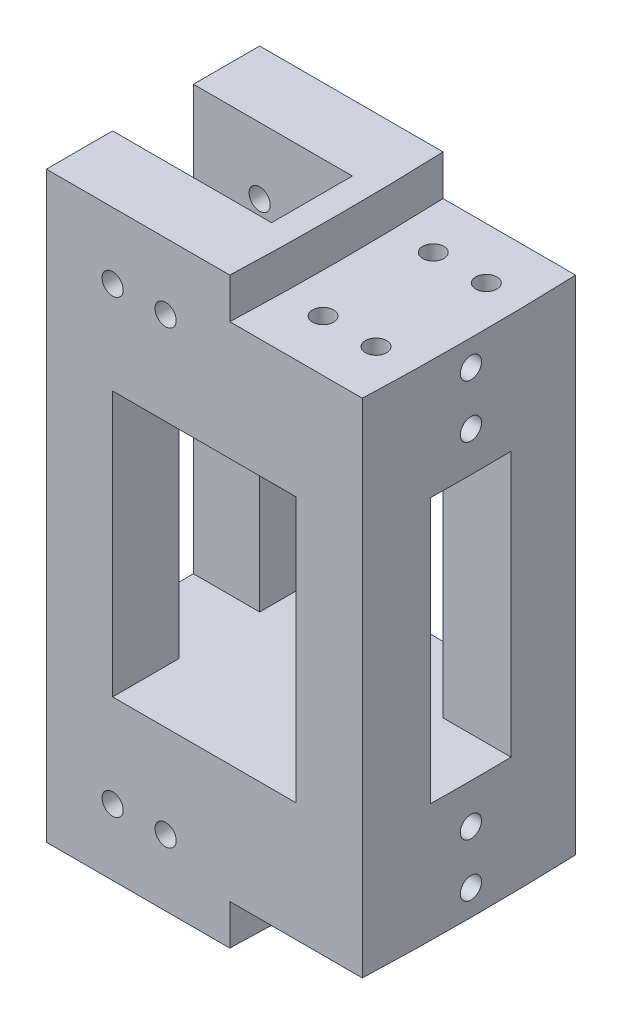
ISO-10303-21;
HEADER;
FILE_DESCRIPTION(('STEP AP214'),'2;1');
FILE_NAME('part.step','',(''),(''),'','','');
FILE_SCHEMA(('AUTOMOTIVE_DESIGN { 1 0 10303 214 1 1 1 1 }'));
ENDSEC;
DATA;
#1=APPLICATION_CONTEXT('core data for automotive mechanical design processes');
#2=APPLICATION_PROTOCOL_DEFINITION('international standard','automotive_design',2000,#1);
#3=PRODUCT_CONTEXT('',#1,'mechanical');
#4=PRODUCT('Part','Part','',(#3));
#5=PRODUCT_RELATED_PRODUCT_CATEGORY('part','',(#4));
#6=PRODUCT_DEFINITION_FORMATION('','',#4);
#7=PRODUCT_DEFINITION_CONTEXT('part definition',#1,'design');
#8=PRODUCT_DEFINITION('design','',#6,#7);
#9=PRODUCT_DEFINITION_SHAPE('','',#8);
#10=(LENGTH_UNIT() NAMED_UNIT(*) SI_UNIT(.MILLI.,.METRE.));
#11=(NAMED_UNIT(*) PLANE_ANGLE_UNIT() SI_UNIT($,.RADIAN.));
#12=(NAMED_UNIT(*) SI_UNIT($,.STERADIAN.) SOLID_ANGLE_UNIT());
#13=UNCERTAINTY_MEASURE_WITH_UNIT(LENGTH_MEASURE(1.E-05),#10,'distance_accuracy_value','');
#14=(GEOMETRIC_REPRESENTATION_CONTEXT(3) GLOBAL_UNCERTAINTY_ASSIGNED_CONTEXT((#13)) GLOBAL_UNIT_ASSIGNED_CONTEXT((#10,
#11,#12)) REPRESENTATION_CONTEXT('',''));
#15=CARTESIAN_POINT('',(0.,0.,0.));
#16=DIRECTION('',(0.,0.,1.));
#17=DIRECTION('',(1.,0.,0.));
#18=AXIS2_PLACEMENT_3D('',#15,#16,#17);
#19=CARTESIAN_POINT('',(0.,-2.,0.));
#20=DIRECTION('',(0.,1.,0.));
#21=DIRECTION('',(0.,0.,1.));
#22=AXIS2_PLACEMENT_3D('',#19,#20,#21);
#23=PLANE('',#22);
#24=DIRECTION('',(-1.,0.,0.));
#25=VECTOR('',#24,1.);
#26=CARTESIAN_POINT('',(-24.,-2.,-3.05));
#27=LINE('',#26,#25);
#28=CARTESIAN_POINT('',(-19.,-2.,-3.05));
#29=VERTEX_POINT('',#28);
#30=CARTESIAN_POINT('',(-24.,-2.,-3.05));
#31=VERTEX_POINT('',#30);
#32=EDGE_CURVE('E56',#29,#31,#27,.T.);
#33=ORIENTED_EDGE('',*,*,#32,.F.);
#34=DIRECTION('',(0.,0.,1.));
#35=VECTOR('',#34,1.);
#36=CARTESIAN_POINT('',(-19.,-2.,-3.05));
#37=LINE('',#36,#35);
#38=CARTESIAN_POINT('',(-19.,-2.,-8.05));
#39=VERTEX_POINT('',#38);
#40=EDGE_CURVE('E61',#39,#29,#37,.T.);
#41=ORIENTED_EDGE('',*,*,#40,.F.);
#42=DIRECTION('',(1.,0.,0.));
#43=VECTOR('',#42,1.);
#44=CARTESIAN_POINT('',(0.,-2.,-8.05));
#45=LINE('',#44,#43);
#46=CARTESIAN_POINT('',(-5.14732773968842,-2.,-8.05));
#47=VERTEX_POINT('',#46);
#48=EDGE_CURVE('E265',#39,#47,#45,.T.);
#49=ORIENTED_EDGE('',*,*,#48,.T.);
#50=DIRECTION('',(0.,0.,-1.));
#51=VECTOR('',#50,1.);
#52=CARTESIAN_POINT('',(-5.14732773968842,-2.,-3.05));
#53=LINE('',#52,#51);
#54=CARTESIAN_POINT('',(-5.14732773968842,-2.,-3.05));
#55=VERTEX_POINT('',#54);
#56=EDGE_CURVE('E736',#55,#47,#53,.T.);
#57=ORIENTED_EDGE('',*,*,#56,.F.);
#58=DIRECTION('',(-1.,0.,0.));
#59=VECTOR('',#58,1.);
#60=CARTESIAN_POINT('',(-5.14732773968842,-2.,-3.05));
#61=LINE('',#60,#59);
#62=CARTESIAN_POINT('',(-0.0211430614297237,-2.,-3.05));
#63=VERTEX_POINT('',#62);
#64=EDGE_CURVE('E734',#63,#55,#61,.T.);
#65=ORIENTED_EDGE('',*,*,#64,.F.);
#66=CARTESIAN_POINT('',(-220.,-2.,-3.46944695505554E-13));
#67=DIRECTION('',(0.,-1.,0.));
#68=DIRECTION('',(0.,0.,1.));
#69=AXIS2_PLACEMENT_3D('',#66,#67,#68);
#70=CIRCLE('',#69,220.);
#71=CARTESIAN_POINT('',(-0.0211430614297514,-2.,3.05));
#72=VERTEX_POINT('',#71);
#73=EDGE_CURVE('E454',#63,#72,#70,.T.);
#74=ORIENTED_EDGE('',*,*,#73,.T.);
#75=DIRECTION('',(1.,0.,0.));
#76=VECTOR('',#75,1.);
#77=CARTESIAN_POINT('',(-5.14732773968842,-2.,3.05));
#78=LINE('',#77,#76);
#79=CARTESIAN_POINT('',(-5.14732773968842,-2.,3.05));
#80=VERTEX_POINT('',#79);
#81=EDGE_CURVE('E718',#80,#72,#78,.T.);
#82=ORIENTED_EDGE('',*,*,#81,.F.);
#83=DIRECTION('',(0.,0.,-1.));
#84=VECTOR('',#83,1.);
#85=CARTESIAN_POINT('',(-5.14732773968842,-2.,8.04999999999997));
#86=LINE('',#85,#84);
#87=CARTESIAN_POINT('',(-5.14732773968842,-2.,8.04999999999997));
#88=VERTEX_POINT('',#87);
#89=EDGE_CURVE('E716',#88,#80,#86,.T.);
#90=ORIENTED_EDGE('',*,*,#89,.F.);
#91=DIRECTION('',(-1.,0.,0.));
#92=VECTOR('',#91,1.);
#93=CARTESIAN_POINT('',(0.,-2.,8.05));
#94=LINE('',#93,#92);
#95=CARTESIAN_POINT('',(-19.,-2.,8.05));
#96=VERTEX_POINT('',#95);
#97=EDGE_CURVE('E484',#88,#96,#94,.T.);
#98=ORIENTED_EDGE('',*,*,#97,.T.);
#99=DIRECTION('',(0.,0.,1.));
#100=VECTOR('',#99,1.);
#101=CARTESIAN_POINT('',(-19.,-2.,8.04999999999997));
#102=LINE('',#101,#100);
#103=CARTESIAN_POINT('',(-19.,-2.,3.05));
#104=VERTEX_POINT('',#103);
#105=EDGE_CURVE('E325',#104,#96,#102,.T.);
#106=ORIENTED_EDGE('',*,*,#105,.F.);
#107=DIRECTION('',(1.,0.,0.));
#108=VECTOR('',#107,1.);
#109=CARTESIAN_POINT('',(-24.,-2.,3.05));
#110=LINE('',#109,#108);
#111=CARTESIAN_POINT('',(-24.,-2.,3.05));
#112=VERTEX_POINT('',#111);
#113=EDGE_CURVE('E328',#112,#104,#110,.T.);
#114=ORIENTED_EDGE('',*,*,#113,.F.);
#115=DIRECTION('',(0.,0.,-1.));
#116=VECTOR('',#115,1.);
#117=CARTESIAN_POINT('',(-24.,-2.,8.05));
#118=LINE('',#117,#116);
#119=EDGE_CURVE('E486',#112,#31,#118,.T.);
#120=ORIENTED_EDGE('',*,*,#119,.T.);
#121=EDGE_LOOP('',(#33,#41,#49,#57,#65,#74,#82,#90,#98,#106,#114,#120));
#122=FACE_BOUND('',#121,.T.);
#123=ADVANCED_FACE('F38',(#122),#23,.F.);
#124=CARTESIAN_POINT('',(0.,-22.,0.));
#125=DIRECTION('',(0.,-1.,0.));
#126=DIRECTION('',(0.,0.,1.));
#127=AXIS2_PLACEMENT_3D('',#124,#125,#126);
#128=PLANE('',#127);
#129=DIRECTION('',(-1.,0.,0.));
#130=VECTOR('',#129,1.);
#131=CARTESIAN_POINT('',(-24.,-22.,-3.05));
#132=LINE('',#131,#130);
#133=CARTESIAN_POINT('',(-19.,-22.,-3.05));
#134=VERTEX_POINT('',#133);
#135=CARTESIAN_POINT('',(-24.,-22.,-3.05));
#136=VERTEX_POINT('',#135);
#137=EDGE_CURVE('E258',#134,#136,#132,.T.);
#138=ORIENTED_EDGE('',*,*,#137,.T.);
#139=DIRECTION('',(0.,0.,-1.));
#140=VECTOR('',#139,1.);
#141=CARTESIAN_POINT('',(-24.,-22.,8.05));
#142=LINE('',#141,#140);
#143=CARTESIAN_POINT('',(-24.,-22.,3.05));
#144=VERTEX_POINT('',#143);
#145=EDGE_CURVE('E273',#144,#136,#142,.T.);
#146=ORIENTED_EDGE('',*,*,#145,.F.);
#147=DIRECTION('',(1.,0.,0.));
#148=VECTOR('',#147,1.);
#149=CARTESIAN_POINT('',(-24.,-22.,3.05));
#150=LINE('',#149,#148);
#151=CARTESIAN_POINT('',(-19.,-22.,3.05));
#152=VERTEX_POINT('',#151);
#153=EDGE_CURVE('E337',#144,#152,#150,.T.);
#154=ORIENTED_EDGE('',*,*,#153,.T.);
#155=DIRECTION('',(0.,0.,1.));
#156=VECTOR('',#155,1.);
#157=CARTESIAN_POINT('',(-19.,-22.,8.04999999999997));
#158=LINE('',#157,#156);
#159=CARTESIAN_POINT('',(-19.,-22.,8.05));
#160=VERTEX_POINT('',#159);
#161=EDGE_CURVE('E344',#152,#160,#158,.T.);
#162=ORIENTED_EDGE('',*,*,#161,.T.);
#163=DIRECTION('',(-1.,0.,0.));
#164=VECTOR('',#163,1.);
#165=CARTESIAN_POINT('',(0.,-22.,8.05));
#166=LINE('',#165,#164);
#167=CARTESIAN_POINT('',(-5.14732773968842,-22.,8.05));
#168=VERTEX_POINT('',#167);
#169=EDGE_CURVE('E278',#168,#160,#166,.T.);
#170=ORIENTED_EDGE('',*,*,#169,.F.);
#171=DIRECTION('',(0.,0.,-1.));
#172=VECTOR('',#171,1.);
#173=CARTESIAN_POINT('',(-5.14732773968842,-22.,8.04999999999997));
#174=LINE('',#173,#172);
#175=CARTESIAN_POINT('',(-5.14732773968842,-22.,3.05));
#176=VERTEX_POINT('',#175);
#177=EDGE_CURVE('E724',#168,#176,#174,.T.);
#178=ORIENTED_EDGE('',*,*,#177,.T.);
#179=DIRECTION('',(1.,0.,0.));
#180=VECTOR('',#179,1.);
#181=CARTESIAN_POINT('',(-5.14732773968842,-22.,3.05));
#182=LINE('',#181,#180);
#183=CARTESIAN_POINT('',(-0.0211430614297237,-22.,3.05));
#184=VERTEX_POINT('',#183);
#185=EDGE_CURVE('E727',#176,#184,#182,.T.);
#186=ORIENTED_EDGE('',*,*,#185,.T.);
#187=CARTESIAN_POINT('',(-220.,-22.,-3.46944695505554E-13));
#188=DIRECTION('',(0.,-1.,0.));
#189=DIRECTION('',(0.,0.,1.));
#190=AXIS2_PLACEMENT_3D('',#187,#188,#189);
#191=CIRCLE('',#190,220.);
#192=CARTESIAN_POINT('',(-0.0211430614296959,-22.,-3.05));
#193=VERTEX_POINT('',#192);
#194=EDGE_CURVE('E670',#193,#184,#191,.T.);
#195=ORIENTED_EDGE('',*,*,#194,.F.);
#196=DIRECTION('',(-1.,0.,0.));
#197=VECTOR('',#196,1.);
#198=CARTESIAN_POINT('',(-5.14732773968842,-22.,-3.05));
#199=LINE('',#198,#197);
#200=CARTESIAN_POINT('',(-5.14732773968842,-22.,-3.05));
#201=VERTEX_POINT('',#200);
#202=EDGE_CURVE('E745',#193,#201,#199,.T.);
#203=ORIENTED_EDGE('',*,*,#202,.T.);
#204=DIRECTION('',(0.,0.,-1.));
#205=VECTOR('',#204,1.);
#206=CARTESIAN_POINT('',(-5.14732773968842,-22.,-3.05));
#207=LINE('',#206,#205);
#208=CARTESIAN_POINT('',(-5.14732773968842,-22.,-8.05000000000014));
#209=VERTEX_POINT('',#208);
#210=EDGE_CURVE('E271',#201,#209,#207,.T.);
#211=ORIENTED_EDGE('',*,*,#210,.T.);
#212=DIRECTION('',(1.,0.,0.));
#213=VECTOR('',#212,1.);
#214=CARTESIAN_POINT('',(0.,-22.,-8.05));
#215=LINE('',#214,#213);
#216=CARTESIAN_POINT('',(-19.,-22.,-8.05000000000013));
#217=VERTEX_POINT('',#216);
#218=EDGE_CURVE('E263',#217,#209,#215,.T.);
#219=ORIENTED_EDGE('',*,*,#218,.F.);
#220=DIRECTION('',(0.,0.,1.));
#221=VECTOR('',#220,1.);
#222=CARTESIAN_POINT('',(-19.,-22.,-3.05));
#223=LINE('',#222,#221);
#224=EDGE_CURVE('E250',#217,#134,#223,.T.);
#225=ORIENTED_EDGE('',*,*,#224,.T.);
#226=EDGE_LOOP('',(#138,#146,#154,#162,#170,#178,#186,#195,#203,#211,#219,#225));
#227=FACE_BOUND('',#226,.T.);
#228=ADVANCED_FACE('F269',(#227),#128,.F.);
#229=CARTESIAN_POINT('',(0.,10.,0.));
#230=DIRECTION('',(0.,1.,0.));
#231=DIRECTION('',(0.,0.,1.));
#232=AXIS2_PLACEMENT_3D('',#229,#230,#231);
#233=PLANE('',#232);
#234=DIRECTION('',(-1.,0.,0.));
#235=VECTOR('',#234,1.);
#236=CARTESIAN_POINT('',(0.,10.,8.05));
#237=LINE('',#236,#235);
#238=CARTESIAN_POINT('',(-10.1543483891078,10.,8.05));
#239=VERTEX_POINT('',#238);
#240=CARTESIAN_POINT('',(-24.,10.,8.05));
#241=VERTEX_POINT('',#240);
#242=EDGE_CURVE('E498',#239,#241,#237,.T.);
#243=ORIENTED_EDGE('',*,*,#242,.F.);
#244=CARTESIAN_POINT('',(-220.,10.,-3.46944695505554E-13));
#245=DIRECTION('',(0.,1.,0.));
#246=DIRECTION('',(0.,0.,1.));
#247=AXIS2_PLACEMENT_3D('',#244,#245,#246);
#248=CIRCLE('',#247,210.);
#249=CARTESIAN_POINT('',(-10.1543483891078,10.,-8.05));
#250=VERTEX_POINT('',#249);
#251=EDGE_CURVE('E442',#239,#250,#248,.T.);
#252=ORIENTED_EDGE('',*,*,#251,.T.);
#253=DIRECTION('',(-1.,0.,0.));
#254=VECTOR('',#253,1.);
#255=CARTESIAN_POINT('',(0.,10.,-8.05));
#256=LINE('',#255,#254);
#257=CARTESIAN_POINT('',(-24.,10.,-8.05));
#258=VERTEX_POINT('',#257);
#259=EDGE_CURVE('E510',#250,#258,#256,.T.);
#260=ORIENTED_EDGE('',*,*,#259,.T.);
#261=DIRECTION('',(0.,0.,1.));
#262=VECTOR('',#261,1.);
#263=CARTESIAN_POINT('',(-24.,10.,-8.05));
#264=LINE('',#263,#262);
#265=CARTESIAN_POINT('',(-24.,10.,-3.05));
#266=VERTEX_POINT('',#265);
#267=EDGE_CURVE('E512',#258,#266,#264,.T.);
#268=ORIENTED_EDGE('',*,*,#267,.T.);
#269=DIRECTION('',(1.,0.,0.));
#270=VECTOR('',#269,1.);
#271=CARTESIAN_POINT('',(-24.,10.,-3.05));
#272=LINE('',#271,#270);
#273=CARTESIAN_POINT('',(-12.,10.,-3.05));
#274=VERTEX_POINT('',#273);
#275=EDGE_CURVE('E515',#266,#274,#272,.T.);
#276=ORIENTED_EDGE('',*,*,#275,.T.);
#277=DIRECTION('',(0.,0.,1.));
#278=VECTOR('',#277,1.);
#279=CARTESIAN_POINT('',(-12.,10.,-3.05));
#280=LINE('',#279,#278);
#281=CARTESIAN_POINT('',(-12.,10.,3.05));
#282=VERTEX_POINT('',#281);
#283=EDGE_CURVE('E517',#274,#282,#280,.T.);
#284=ORIENTED_EDGE('',*,*,#283,.T.);
#285=DIRECTION('',(1.,0.,0.));
#286=VECTOR('',#285,1.);
#287=CARTESIAN_POINT('',(-24.,10.,3.05));
#288=LINE('',#287,#286);
#289=CARTESIAN_POINT('',(-24.,10.,3.05));
#290=VERTEX_POINT('',#289);
#291=EDGE_CURVE('E492',#290,#282,#288,.T.);
#292=ORIENTED_EDGE('',*,*,#291,.F.);
#293=DIRECTION('',(0.,0.,-1.));
#294=VECTOR('',#293,1.);
#295=CARTESIAN_POINT('',(-24.,10.,8.05));
#296=LINE('',#295,#294);
#297=EDGE_CURVE('E495',#241,#290,#296,.T.);
#298=ORIENTED_EDGE('',*,*,#297,.F.);
#299=EDGE_LOOP('',(#243,#252,#260,#268,#276,#284,#292,#298));
#300=FACE_BOUND('',#299,.T.);
#301=ADVANCED_FACE('F548',(#300),#233,.T.);
#302=CARTESIAN_POINT('',(-220.,-2.,-3.46944695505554E-13));
#303=DIRECTION('',(0.,1.,0.));
#304=DIRECTION('',(0.,0.,1.));
#305=AXIS2_PLACEMENT_3D('',#302,#303,#304);
#306=CYLINDRICAL_SURFACE('',#305,220.);
#307=DIRECTION('',(0.,1.,0.));
#308=VECTOR('',#307,1.);
#309=CARTESIAN_POINT('',(-0.147327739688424,-2.,8.05));
#310=LINE('',#309,#308);
#311=CARTESIAN_POINT('',(-0.147327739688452,-30.95,8.05));
#312=VERTEX_POINT('',#311);
#313=CARTESIAN_POINT('',(-0.147327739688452,6.95,8.05));
#314=VERTEX_POINT('',#313);
#315=EDGE_CURVE('E439',#312,#314,#310,.T.);
#316=ORIENTED_EDGE('',*,*,#315,.F.);
#317=CARTESIAN_POINT('',(-220.,-30.95,-3.46944695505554E-13));
#318=DIRECTION('',(0.,1.,0.));
#319=DIRECTION('',(0.,0.,1.));
#320=AXIS2_PLACEMENT_3D('',#317,#318,#319);
#321=CIRCLE('',#320,220.);
#322=CARTESIAN_POINT('',(-0.147327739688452,-30.95,-8.05));
#323=VERTEX_POINT('',#322);
#324=EDGE_CURVE('E658',#312,#323,#321,.T.);
#325=ORIENTED_EDGE('',*,*,#324,.T.);
#326=DIRECTION('',(0.,1.,0.));
#327=VECTOR('',#326,1.);
#328=CARTESIAN_POINT('',(-0.147327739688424,-2.,-8.05));
#329=LINE('',#328,#327);
#330=CARTESIAN_POINT('',(-0.147327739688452,6.95,-8.05));
#331=VERTEX_POINT('',#330);
#332=EDGE_CURVE('E456',#323,#331,#329,.T.);
#333=ORIENTED_EDGE('',*,*,#332,.T.);
#334=CARTESIAN_POINT('',(-220.,6.95,-3.46944695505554E-13));
#335=DIRECTION('',(0.,1.,0.));
#336=DIRECTION('',(0.,0.,1.));
#337=AXIS2_PLACEMENT_3D('',#334,#335,#336);
#338=CIRCLE('',#337,220.);
#339=EDGE_CURVE('E443',#314,#331,#338,.T.);
#340=ORIENTED_EDGE('',*,*,#339,.F.);
#341=EDGE_LOOP('',(#316,#325,#333,#340));
#342=FACE_BOUND('',#341,.T.);
#343=CARTESIAN_POINT('',(0.,1.8,-3.33473580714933E-13));
#344=CARTESIAN_POINT('',(4.17096303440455E-09,1.80000101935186,-0.0132102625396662));
#345=CARTESIAN_POINT('',(-1.18972081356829E-06,1.79968530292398,-0.0264212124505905));
#346=CARTESIAN_POINT('',(-5.9270310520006E-06,1.79841412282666,-0.0527163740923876));
#347=CARTESIAN_POINT('',(-9.4533885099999E-06,1.79746330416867,-0.0658008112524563));
#348=CARTESIAN_POINT('',(-1.87870734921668E-05,1.79492216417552,-0.0918431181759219));
#349=CARTESIAN_POINT('',(-2.45831673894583E-05,1.79333499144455,-0.104801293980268));
#350=CARTESIAN_POINT('',(-3.83821695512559E-05,1.78952300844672,-0.130590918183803));
#351=CARTESIAN_POINT('',(-4.63796027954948E-05,1.7872997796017,-0.143422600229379));
#352=CARTESIAN_POINT('',(-6.45096073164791E-05,1.78221719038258,-0.168959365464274));
#353=CARTESIAN_POINT('',(-7.46421788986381E-05,1.77935782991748,-0.181664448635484));
#354=CARTESIAN_POINT('',(-9.69713108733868E-05,1.77300459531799,-0.206948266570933));
#355=CARTESIAN_POINT('',(-0.000109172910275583,1.76950917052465,-0.219526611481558));
#356=CARTESIAN_POINT('',(-0.000135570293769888,1.76188533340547,-0.244557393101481));
#357=CARTESIAN_POINT('',(-0.000149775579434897,1.75775389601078,-0.257008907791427));
#358=CARTESIAN_POINT('',(-0.000180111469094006,1.74885953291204,-0.281786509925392));
#359=CARTESIAN_POINT('',(-0.000196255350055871,1.74409222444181,-0.294111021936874));
#360=CARTESIAN_POINT('',(-0.000230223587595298,1.7339804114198,-0.318507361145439));
#361=CARTESIAN_POINT('',(-0.000248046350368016,1.72863645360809,-0.330579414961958));
#362=CARTESIAN_POINT('',(-0.000285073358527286,1.7174060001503,-0.354362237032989));
#363=CARTESIAN_POINT('',(-0.000304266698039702,1.71152370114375,-0.366074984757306));
#364=CARTESIAN_POINT('',(-0.000343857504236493,1.69921801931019,-0.389139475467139));
#365=CARTESIAN_POINT('',(-0.000364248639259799,1.69279741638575,-0.400492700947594));
#366=CARTESIAN_POINT('',(-0.000406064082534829,1.67941656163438,-0.422838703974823));
#367=CARTESIAN_POINT('',(-0.000427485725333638,1.67245767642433,-0.433832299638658));
#368=CARTESIAN_POINT('',(-0.000471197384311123,1.65800168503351,-0.455459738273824));
#369=CARTESIAN_POINT('',(-0.00049348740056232,1.65050457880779,-0.466093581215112));
#370=CARTESIAN_POINT('',(-0.00053877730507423,1.63497351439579,-0.487002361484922));
#371=CARTESIAN_POINT('',(-0.000561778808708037,1.62693827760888,-0.497276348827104));
#372=CARTESIAN_POINT('',(-0.000608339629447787,1.61033219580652,-0.517466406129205));
#373=CARTESIAN_POINT('',(-0.000631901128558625,1.6017589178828,-0.527380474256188));
#374=CARTESIAN_POINT('',(-0.000679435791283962,1.58407794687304,-0.546851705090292));
#375=CARTESIAN_POINT('',(-0.000703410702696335,1.57496681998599,-0.556405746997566));
#376=CARTESIAN_POINT('',(-0.000751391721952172,1.55630502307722,-0.575064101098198));
#377=CARTESIAN_POINT('',(-0.000775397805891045,1.54675459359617,-0.584168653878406));
#378=CARTESIAN_POINT('',(-0.000823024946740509,1.52729102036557,-0.601837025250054));
#379=CARTESIAN_POINT('',(-0.000846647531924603,1.51738099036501,-0.610404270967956));
#380=CARTESIAN_POINT('',(-0.000893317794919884,1.49719944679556,-0.626998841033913));
#381=CARTESIAN_POINT('',(-0.000916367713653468,1.48692993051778,-0.635028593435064));
#382=CARTESIAN_POINT('',(-0.000961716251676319,1.46603052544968,-0.650549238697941));
#383=CARTESIAN_POINT('',(-0.000984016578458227,1.45540158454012,-0.658041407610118));
#384=CARTESIAN_POINT('',(-0.00102770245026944,1.43378438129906,-0.672488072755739));
#385=CARTESIAN_POINT('',(-0.00104908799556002,1.4227961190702,-0.679442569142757));
#386=CARTESIAN_POINT('',(-0.00109079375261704,1.40046121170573,-0.69281519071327));
#387=CARTESIAN_POINT('',(-0.00111111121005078,1.38911375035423,-0.699231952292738));
#388=CARTESIAN_POINT('',(-0.00115054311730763,1.36606121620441,-0.711530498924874));
#389=CARTESIAN_POINT('',(-0.00116965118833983,1.35435466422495,-0.717409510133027));
#390=CARTESIAN_POINT('',(-0.00120653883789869,1.33058465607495,-0.728633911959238));
#391=CARTESIAN_POINT('',(-0.0012243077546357,1.31851922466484,-0.733975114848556));
#392=CARTESIAN_POINT('',(-0.00125830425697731,1.29410431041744,-0.744095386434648));
#393=CARTESIAN_POINT('',(-0.00127452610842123,1.28175396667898,-0.748872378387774));
#394=CARTESIAN_POINT('',(-0.00130504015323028,1.2569244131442,-0.757783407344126));
#395=CARTESIAN_POINT('',(-0.0013193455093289,1.24444679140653,-0.761921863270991));
#396=CARTESIAN_POINT('',(-0.00134592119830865,1.21936350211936,-0.769557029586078));
#397=CARTESIAN_POINT('',(-0.00135820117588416,1.20675876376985,-0.773056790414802));
#398=CARTESIAN_POINT('',(-0.00138063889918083,1.18142187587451,-0.779415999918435));
#399=CARTESIAN_POINT('',(-0.00139080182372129,1.16869011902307,-0.78227701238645));
#400=CARTESIAN_POINT('',(-0.00140893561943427,1.14309971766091,-0.787360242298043));
#401=CARTESIAN_POINT('',(-0.00141690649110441,1.13024107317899,-0.789582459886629));
#402=CARTESIAN_POINT('',(-0.00143060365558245,1.10439727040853,-0.793389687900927));
#403=CARTESIAN_POINT('',(-0.0014363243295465,1.09141187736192,-0.794973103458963));
#404=CARTESIAN_POINT('',(-0.0014454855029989,1.06531476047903,-0.797504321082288));
#405=CARTESIAN_POINT('',(-0.00144891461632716,1.05220272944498,-0.798448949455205));
#406=CARTESIAN_POINT('',(-0.0014534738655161,1.02585246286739,-0.799704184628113));
#407=CARTESIAN_POINT('',(-0.00145458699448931,1.01261400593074,-0.800010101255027));
#408=CARTESIAN_POINT('',(-0.00145451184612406,0.986167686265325,-0.799989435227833));
#409=CARTESIAN_POINT('',(-0.00145332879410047,0.972959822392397,-0.799664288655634));
#410=CARTESIAN_POINT('',(-0.00144864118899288,0.946670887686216,-0.798373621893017));
#411=CARTESIAN_POINT('',(-0.00144515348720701,0.933589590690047,-0.797412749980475));
#412=CARTESIAN_POINT('',(-0.00143588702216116,0.907554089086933,-0.794852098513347));
#413=CARTESIAN_POINT('',(-0.00143011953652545,0.8945995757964,-0.793255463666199));
#414=CARTESIAN_POINT('',(-0.00141634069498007,0.868817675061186,-0.789424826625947));
#415=CARTESIAN_POINT('',(-0.00140833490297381,0.855990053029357,-0.78719240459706));
#416=CARTESIAN_POINT('',(-0.00139014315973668,0.830461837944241,-0.782091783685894));
#417=CARTESIAN_POINT('',(-0.00137995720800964,0.817761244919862,-0.779223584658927));
#418=CARTESIAN_POINT('',(-0.00135748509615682,0.792486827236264,-0.772853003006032));
#419=CARTESIAN_POINT('',(-0.00134519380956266,0.779913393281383,-0.769349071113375));
#420=CARTESIAN_POINT('',(-0.00131860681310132,0.754892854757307,-0.761708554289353));
#421=CARTESIAN_POINT('',(-0.00130430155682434,0.742446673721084,-0.757568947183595));
#422=CARTESIAN_POINT('',(-0.00127379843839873,0.717680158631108,-0.748658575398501));
#423=CARTESIAN_POINT('',(-0.00125758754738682,0.705361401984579,-0.743883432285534));
#424=CARTESIAN_POINT('',(-0.0012235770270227,0.680976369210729,-0.733756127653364));
#425=CARTESIAN_POINT('',(-0.00120577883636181,0.668909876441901,-0.72840448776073));
#426=CARTESIAN_POINT('',(-0.00116883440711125,0.64513843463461,-0.717159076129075));
#427=CARTESIAN_POINT('',(-0.00114969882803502,0.633431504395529,-0.711269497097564));
#428=CARTESIAN_POINT('',(-0.00111021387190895,0.610378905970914,-0.69894965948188));
#429=CARTESIAN_POINT('',(-0.00108987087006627,0.599031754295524,-0.692522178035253));
#430=CARTESIAN_POINT('',(-0.00104811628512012,0.576698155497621,-0.679127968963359));
#431=CARTESIAN_POINT('',(-0.00102670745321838,0.565710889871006,-0.672162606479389));
#432=CARTESIAN_POINT('',(-0.000982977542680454,0.54409636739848,-0.657694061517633));
#433=CARTESIAN_POINT('',(-0.000960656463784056,0.533469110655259,-0.65019087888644));
#434=CARTESIAN_POINT('',(-0.000915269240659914,0.512573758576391,-0.634648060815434));
#435=CARTESIAN_POINT('',(-0.000892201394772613,0.502306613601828,-0.626607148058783));
#436=CARTESIAN_POINT('',(-0.000845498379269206,0.482130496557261,-0.609990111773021));
#437=CARTESIAN_POINT('',(-0.000821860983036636,0.472223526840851,-0.601411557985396));
#438=CARTESIAN_POINT('',(-0.000774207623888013,0.452766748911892,-0.583720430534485));
#439=CARTESIAN_POINT('',(-0.000750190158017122,0.443220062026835,-0.574604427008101));
#440=CARTESIAN_POINT('',(-0.000702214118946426,0.424575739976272,-0.555932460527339));
#441=CARTESIAN_POINT('',(-0.000678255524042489,0.415477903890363,-0.546376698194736));
#442=CARTESIAN_POINT('',(-0.000630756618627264,0.397823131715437,-0.526902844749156));
#443=CARTESIAN_POINT('',(-0.000607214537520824,0.38926276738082,-0.516987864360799));
#444=CARTESIAN_POINT('',(-0.000560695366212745,0.372682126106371,-0.496796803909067));
#445=CARTESIAN_POINT('',(-0.000537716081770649,0.364659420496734,-0.486522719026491));
#446=CARTESIAN_POINT('',(-0.000492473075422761,0.349153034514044,-0.465614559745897));
#447=CARTESIAN_POINT('',(-0.000470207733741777,0.341668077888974,-0.454981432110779));
#448=CARTESIAN_POINT('',(-0.000426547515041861,0.327236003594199,-0.433356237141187));
#449=CARTESIAN_POINT('',(-0.000405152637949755,0.320288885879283,-0.422364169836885));
#450=CARTESIAN_POINT('',(-0.000363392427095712,0.306931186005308,-0.400022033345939));
#451=CARTESIAN_POINT('',(-0.000343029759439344,0.300521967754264,-0.388671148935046));
#452=CARTESIAN_POINT('',(-0.000303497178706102,0.288238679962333,-0.36561214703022));
#453=CARTESIAN_POINT('',(-0.000284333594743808,0.282367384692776,-0.353902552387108));
#454=CARTESIAN_POINT('',(-0.000247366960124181,0.271158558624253,-0.33012684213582));
#455=CARTESIAN_POINT('',(-0.000229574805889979,0.265825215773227,-0.318058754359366));
#456=CARTESIAN_POINT('',(-0.000195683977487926,0.255738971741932,-0.293682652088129));
#457=CARTESIAN_POINT('',(-0.000179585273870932,0.250986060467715,-0.281374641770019));
#458=CARTESIAN_POINT('',(-0.000149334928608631,0.242118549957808,-0.256630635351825));
#459=CARTESIAN_POINT('',(-0.000135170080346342,0.237999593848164,-0.244196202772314));
#460=CARTESIAN_POINT('',(-0.000108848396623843,0.230398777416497,-0.219200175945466));
#461=CARTESIAN_POINT('',(-9.6682112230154E-05,0.226913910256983,-0.206639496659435));
#462=CARTESIAN_POINT('',(-7.44180653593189E-05,0.220579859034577,-0.181391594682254));
#463=CARTESIAN_POINT('',(-6.43152927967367E-05,0.217729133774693,-0.168704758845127));
#464=CARTESIAN_POINT('',(-4.62389722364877E-05,0.212661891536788,-0.143205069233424));
#465=CARTESIAN_POINT('',(-3.82654239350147E-05,0.210445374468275,-0.130392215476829));
#466=CARTESIAN_POINT('',(-2.45079096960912E-05,0.206644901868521,-0.10464082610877));
#467=CARTESIAN_POINT('',(-1.87293858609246E-05,0.205062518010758,-0.0917020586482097));
#468=CARTESIAN_POINT('',(-9.42417870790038E-06,0.202529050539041,-0.0656991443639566));
#469=CARTESIAN_POINT('',(-5.9086605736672E-06,0.201581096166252,-0.0526346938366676));
#470=CARTESIAN_POINT('',(-1.1860204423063E-06,0.200313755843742,-0.026380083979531));
#471=CARTESIAN_POINT('',(4.1451403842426E-09,0.199998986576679,-0.0131897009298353));
#472=CARTESIAN_POINT('',(0.,0.2,-3.33473580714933E-13));
#473=B_SPLINE_CURVE_WITH_KNOTS('',3,(#343,#344,#345,#346,#347,#348,#349,#350,#351,#352,#353,
#354,#355,#356,#357,#358,#359,#360,#361,#362,#363,#364,#365,#366,#367,#368,#369,#370,#371,#372,
#373,#374,#375,#376,#377,#378,#379,#380,#381,#382,#383,#384,#385,#386,#387,#388,#389,#390,#391,
#392,#393,#394,#395,#396,#397,#398,#399,#400,#401,#402,#403,#404,#405,#406,#407,#408,#409,#410,
#411,#412,#413,#414,#415,#416,#417,#418,#419,#420,#421,#422,#423,#424,#425,#426,#427,#428,#429,
#430,#431,#432,#433,#434,#435,#436,#437,#438,#439,#440,#441,#442,#443,#444,#445,#446,#447,#448,
#449,#450,#451,#452,#453,#454,#455,#456,#457,#458,#459,#460,#461,#462,#463,#464,#465,#466,#467,
#468,#469,#470,#471,#472),.UNSPECIFIED.,.F.,.F.,(4,2,2,2,2,2,2,2,2,2,2,2,2,2,2,2,2,2,2,2,2,2,2,
2,2,2,2,2,2,2,2,2,2,2,2,2,2,2,2,2,2,2,2,2,2,2,2,2,2,2,2,2,2,2,2,2,2,2,2,2,2,2,2,2,4),(0.,
0.0396279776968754,0.0789692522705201,0.118118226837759,0.157170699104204,0.19622317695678,
0.23537216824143,0.274713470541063,0.314341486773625,0.353932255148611,0.393237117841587,
0.43235021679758,0.471367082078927,0.51038395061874,0.54949705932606,0.588801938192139,
0.628392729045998,0.667962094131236,0.70724599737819,0.746338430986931,0.785334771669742,
0.824331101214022,0.863423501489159,0.902707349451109,0.942276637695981,0.981987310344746,
1.02140948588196,1.06063814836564,1.09976969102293,1.13890122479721,1.17812986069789,
1.21755199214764,1.25726260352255,1.29688295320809,1.33621676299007,1.3753583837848,
1.41440355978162,1.45344874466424,1.49259039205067,1.53192424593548,1.57154465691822,
1.61112951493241,1.65042859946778,1.68953601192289,1.72854724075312,1.76755848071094,
1.80666592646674,1.84596506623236,1.88555000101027,1.92511705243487,1.96439869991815,
2.00348891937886,2.04248307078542,2.08147721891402,2.120567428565,2.15984905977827,
2.19941608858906,2.23898242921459,2.27826337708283,2.31735290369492,2.35634636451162,
2.39533981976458,2.43442932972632,2.47371024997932,2.51327655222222),.UNSPECIFIED.);
#474=CARTESIAN_POINT('',(0.,1.8,-3.46944695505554E-13));
#475=VERTEX_POINT('',#474);
#476=CARTESIAN_POINT('',(0.,0.2,-3.46944695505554E-13));
#477=VERTEX_POINT('',#476);
#478=EDGE_CURVE('E49',#475,#477,#473,.T.);
#479=ORIENTED_EDGE('',*,*,#478,.T.);
#480=CARTESIAN_POINT('',(0.,0.2,1.47396950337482E-12));
#481=CARTESIAN_POINT('',(4.15715131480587E-09,0.199998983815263,0.0131992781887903));
#482=CARTESIAN_POINT('',(-1.18774331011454E-06,0.200314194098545,0.0263992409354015));
#483=CARTESIAN_POINT('',(-5.91721375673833E-06,0.201583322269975,0.0526727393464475));
#484=CARTESIAN_POINT('',(-9.43777867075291E-06,0.202532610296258,0.0657464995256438));
#485=CARTESIAN_POINT('',(-1.87562452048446E-05,0.205069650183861,0.0917677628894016));
#486=CARTESIAN_POINT('',(-2.45429497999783E-05,0.206654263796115,0.104715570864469));
#487=CARTESIAN_POINT('',(-3.83197814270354E-05,0.210460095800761,0.130484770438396));
#488=CARTESIAN_POINT('',(-4.6304451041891E-05,0.212679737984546,0.143306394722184));
#489=CARTESIAN_POINT('',(-6.44057684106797E-05,0.217754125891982,0.168823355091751));
#490=CARTESIAN_POINT('',(-7.45224164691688E-05,0.220608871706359,0.181518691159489));
#491=CARTESIAN_POINT('',(-9.6816769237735E-05,0.226951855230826,0.206783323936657));
#492=CARTESIAN_POINT('',(-0.000108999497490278,0.23044163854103,0.2193522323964));
#493=CARTESIAN_POINT('',(-0.000135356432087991,0.238053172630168,0.244364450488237));
#494=CARTESIAN_POINT('',(-0.000149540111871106,0.242177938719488,0.256806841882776));
#495=CARTESIAN_POINT('',(-0.000179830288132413,0.251057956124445,0.281566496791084));
#496=CARTESIAN_POINT('',(-0.000195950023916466,0.255817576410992,0.293882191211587));
#497=CARTESIAN_POINT('',(-0.000229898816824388,0.26592222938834,0.318283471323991));
#498=CARTESIAN_POINT('',(-0.000247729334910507,0.271267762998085,0.330368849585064));
#499=CARTESIAN_POINT('',(-0.000284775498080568,0.282502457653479,0.354177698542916));
#500=CARTESIAN_POINT('',(-0.000303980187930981,0.288387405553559,0.365903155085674));
#501=CARTESIAN_POINT('',(-0.000343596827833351,0.300699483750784,0.388992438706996));
#502=CARTESIAN_POINT('',(-0.000364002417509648,0.307123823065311,0.400357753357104));
#503=CARTESIAN_POINT('',(-0.000405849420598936,0.32051323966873,0.422727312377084));
#504=CARTESIAN_POINT('',(-0.000427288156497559,0.327476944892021,0.433732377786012));
#505=CARTESIAN_POINT('',(-0.000471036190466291,0.341943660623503,0.455382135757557));
#506=CARTESIAN_POINT('',(-0.000493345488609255,0.349446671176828,0.466026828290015));
#507=CARTESIAN_POINT('',(-0.000538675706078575,0.364990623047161,0.486956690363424));
#508=CARTESIAN_POINT('',(-0.000561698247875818,0.373032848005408,0.497240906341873));
#509=CARTESIAN_POINT('',(-0.000608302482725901,0.389653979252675,0.517450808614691));
#510=CARTESIAN_POINT('',(-0.000631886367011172,0.398235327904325,0.527374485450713));
#511=CARTESIAN_POINT('',(-0.000679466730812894,0.415933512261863,0.546864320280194));
#512=CARTESIAN_POINT('',(-0.000703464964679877,0.425053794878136,0.556427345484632));
#513=CARTESIAN_POINT('',(-0.000751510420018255,0.44374163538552,0.57510976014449));
#514=CARTESIAN_POINT('',(-0.00077555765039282,0.45330928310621,0.584229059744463));
#515=CARTESIAN_POINT('',(-0.000823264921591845,0.472808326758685,0.601924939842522));
#516=CARTESIAN_POINT('',(-0.000846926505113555,0.482736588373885,0.610504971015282));
#517=CARTESIAN_POINT('',(-0.000893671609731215,0.502955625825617,0.627123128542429));
#518=CARTESIAN_POINT('',(-0.000916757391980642,0.513244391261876,0.635163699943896));
#519=CARTESIAN_POINT('',(-0.000962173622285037,0.534183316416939,0.65070400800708));
#520=CARTESIAN_POINT('',(-0.000984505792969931,0.544832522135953,0.658205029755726));
#521=CARTESIAN_POINT('',(-0.00102825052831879,0.566491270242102,0.672667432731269));
#522=CARTESIAN_POINT('',(-0.00104966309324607,0.577500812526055,0.679628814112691));
#523=CARTESIAN_POINT('',(-0.00109141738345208,0.599879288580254,0.693013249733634));
#524=CARTESIAN_POINT('',(-0.0011117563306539,0.611249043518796,0.699434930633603));
#525=CARTESIAN_POINT('',(-0.00115122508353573,0.634347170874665,0.711741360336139));
#526=CARTESIAN_POINT('',(-0.00117034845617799,0.646077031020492,0.717623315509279));
#527=CARTESIAN_POINT('',(-0.00120726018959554,0.669894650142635,0.728851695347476));
#528=CARTESIAN_POINT('',(-0.00122503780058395,0.68198439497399,0.734193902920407));
#529=CARTESIAN_POINT('',(-0.00125896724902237,0.706393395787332,0.74429122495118));
#530=CARTESIAN_POINT('',(-0.00127512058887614,0.718712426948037,0.749046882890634));
#531=CARTESIAN_POINT('',(-0.00130550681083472,0.743478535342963,0.757918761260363));
#532=CARTESIAN_POINT('',(-0.00131975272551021,0.755924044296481,0.762039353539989));
#533=CARTESIAN_POINT('',(-0.00134621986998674,0.780942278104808,0.769642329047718));
#534=CARTESIAN_POINT('',(-0.00135845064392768,0.793514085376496,0.773127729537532));
#535=CARTESIAN_POINT('',(-0.0013808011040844,0.818784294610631,0.779461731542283));
#536=CARTESIAN_POINT('',(-0.00139092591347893,0.831482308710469,0.782311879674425));
#537=CARTESIAN_POINT('',(-0.00140899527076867,0.857004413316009,0.787376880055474));
#538=CARTESIAN_POINT('',(-0.00141693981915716,0.869828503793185,0.789591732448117));
#539=CARTESIAN_POINT('',(-0.00143059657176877,0.895602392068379,0.793387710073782));
#540=CARTESIAN_POINT('',(-0.00143630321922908,0.908552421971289,0.7949672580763));
#541=CARTESIAN_POINT('',(-0.00144544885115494,0.934578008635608,0.797494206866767));
#542=CARTESIAN_POINT('',(-0.00144887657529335,0.947653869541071,0.798438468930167));
#543=CARTESIAN_POINT('',(-0.00145344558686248,0.973930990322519,0.799696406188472));
#544=CARTESIAN_POINT('',(-0.00145457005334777,0.987132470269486,0.80000544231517));
#545=CARTESIAN_POINT('',(-0.00145452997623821,1.01352858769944,0.799994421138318));
#546=CARTESIAN_POINT('',(-0.00145336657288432,1.02672322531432,0.799674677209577));
#547=CARTESIAN_POINT('',(-0.00144872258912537,1.05298631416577,0.798396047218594));
#548=CARTESIAN_POINT('',(-0.00144525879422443,1.06605498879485,0.797441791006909));
#549=CARTESIAN_POINT('',(-0.00143604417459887,1.0920658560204,0.79489558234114));
#550=CARTESIAN_POINT('',(-0.00143030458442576,1.10500835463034,0.79330676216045));
#551=CARTESIAN_POINT('',(-0.0014165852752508,1.13076683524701,0.78949296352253));
#552=CARTESIAN_POINT('',(-0.00140861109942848,1.14358305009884,0.787269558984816));
#553=CARTESIAN_POINT('',(-0.00139048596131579,1.16908905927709,0.782188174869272));
#554=CARTESIAN_POINT('',(-0.00138033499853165,1.18177885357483,0.779330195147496));
#555=CARTESIAN_POINT('',(-0.00135793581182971,1.20703228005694,0.772981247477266));
#556=CARTESIAN_POINT('',(-0.00134568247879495,1.21959552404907,0.769488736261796));
#557=CARTESIAN_POINT('',(-0.00131917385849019,1.24459628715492,0.761872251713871));
#558=CARTESIAN_POINT('',(-0.00130490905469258,1.2570328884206,0.757745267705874));
#559=CARTESIAN_POINT('',(-0.00127448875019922,1.28178084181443,0.748861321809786));
#560=CARTESIAN_POINT('',(-0.00125832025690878,1.29409062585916,0.744099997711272));
#561=CARTESIAN_POINT('',(-0.00122438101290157,1.31846879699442,0.733997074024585));
#562=CARTESIAN_POINT('',(-0.00120661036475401,1.33053719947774,0.72865551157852));
#563=CARTESIAN_POINT('',(-0.00116971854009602,1.35431301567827,0.717430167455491));
#564=CARTESIAN_POINT('',(-0.00115060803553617,1.36602240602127,0.711550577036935));
#565=CARTESIAN_POINT('',(-0.00111117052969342,1.38908047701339,0.699250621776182));
#566=CARTESIAN_POINT('',(-0.00109084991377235,1.40043063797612,0.692833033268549));
#567=CARTESIAN_POINT('',(-0.00104913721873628,1.4227708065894,0.679458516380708));
#568=CARTESIAN_POINT('',(-0.00102774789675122,1.43376163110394,0.672502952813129));
#569=CARTESIAN_POINT('',(-0.000984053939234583,1.45538382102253,0.658053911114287));
#570=CARTESIAN_POINT('',(-0.000961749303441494,1.46601518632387,0.650560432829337));
#571=CARTESIAN_POINT('',(-0.000916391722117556,1.48691930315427,0.635036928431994));
#572=CARTESIAN_POINT('',(-0.000893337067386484,1.49719110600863,0.627005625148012));
#573=CARTESIAN_POINT('',(-0.000846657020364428,1.51737708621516,0.610407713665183));
#574=CARTESIAN_POINT('',(-0.000823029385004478,1.52728926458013,0.601838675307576));
#575=CARTESIAN_POINT('',(-0.000775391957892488,1.54675700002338,0.58416648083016));
#576=CARTESIAN_POINT('',(-0.000751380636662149,1.55630944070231,0.5750598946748));
#577=CARTESIAN_POINT('',(-0.000703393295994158,1.57497348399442,0.556398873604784));
#578=CARTESIAN_POINT('',(-0.000679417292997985,1.58408492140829,0.546844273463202));
#579=CARTESIAN_POINT('',(-0.000631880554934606,1.60176645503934,0.527371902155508));
#580=CARTESIAN_POINT('',(-0.000608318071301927,1.61033998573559,0.517457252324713));
#581=CARTESIAN_POINT('',(-0.00056175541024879,1.62694651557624,0.497266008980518));
#582=CARTESIAN_POINT('',(-0.000538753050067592,1.63498194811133,0.486991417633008));
#583=CARTESIAN_POINT('',(-0.000493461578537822,1.65051334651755,0.466081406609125));
#584=CARTESIAN_POINT('',(-0.00047117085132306,1.65801059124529,0.455446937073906));
#585=CARTESIAN_POINT('',(-0.000427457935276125,1.67246680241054,0.433818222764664));
#586=CARTESIAN_POINT('',(-0.000406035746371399,1.67942576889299,0.422823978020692));
#587=CARTESIAN_POINT('',(-0.000364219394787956,1.69280672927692,0.400476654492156));
#588=CARTESIAN_POINT('',(-0.000343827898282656,1.6992273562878,0.389122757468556));
#589=CARTESIAN_POINT('',(-0.000304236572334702,1.71153302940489,0.366056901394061));
#590=CARTESIAN_POINT('',(-0.000285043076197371,1.71741529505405,0.354343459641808));
#591=CARTESIAN_POINT('',(-0.000248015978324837,1.72864562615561,0.330559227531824));
#592=CARTESIAN_POINT('',(-0.000230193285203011,1.73398949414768,0.318486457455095));
#593=CARTESIAN_POINT('',(-0.000196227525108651,1.74410044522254,0.294090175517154));
#594=CARTESIAN_POINT('',(-0.000180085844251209,1.74886705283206,0.281766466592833));
#595=CARTESIAN_POINT('',(-0.000149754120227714,1.75776010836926,0.256990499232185));
#596=CARTESIAN_POINT('',(-0.000135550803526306,1.76189093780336,0.244539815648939));
#597=CARTESIAN_POINT('',(-0.000109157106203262,1.76951365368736,0.21951072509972));
#598=CARTESIAN_POINT('',(-9.69572265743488E-05,1.77300856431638,0.20693323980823));
#599=CARTESIAN_POINT('',(-7.46312641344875E-05,1.77936086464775,0.181651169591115));
#600=CARTESIAN_POINT('',(-6.45001437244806E-05,1.7822198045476,0.168946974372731));
#601=CARTESIAN_POINT('',(-4.63727536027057E-05,1.78730164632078,0.143412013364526));
#602=CARTESIAN_POINT('',(-3.83764835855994E-05,1.78952454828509,0.130581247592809));
#603=CARTESIAN_POINT('',(-2.45795019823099E-05,1.79333597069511,0.104793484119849));
#604=CARTESIAN_POINT('',(-1.87842638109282E-05,1.79492291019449,0.0918362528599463));
#605=CARTESIAN_POINT('',(-9.45196582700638E-06,1.79746367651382,0.0657958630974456));
#606=CARTESIAN_POINT('',(-5.92613630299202E-06,1.79841435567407,0.0527123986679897));
#607=CARTESIAN_POINT('',(-1.18954058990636E-06,1.79968534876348,0.0264192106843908));
#608=CARTESIAN_POINT('',(4.16969685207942E-09,1.80000101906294,0.0132092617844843));
#609=CARTESIAN_POINT('',(0.,1.8,-3.33473580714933E-13));
#610=B_SPLINE_CURVE_WITH_KNOTS('',3,(#480,#481,#482,#483,#484,#485,#486,#487,#488,#489,#490,
#491,#492,#493,#494,#495,#496,#497,#498,#499,#500,#501,#502,#503,#504,#505,#506,#507,#508,#509,
#510,#511,#512,#513,#514,#515,#516,#517,#518,#519,#520,#521,#522,#523,#524,#525,#526,#527,#528,
#529,#530,#531,#532,#533,#534,#535,#536,#537,#538,#539,#540,#541,#542,#543,#544,#545,#546,#547,
#548,#549,#550,#551,#552,#553,#554,#555,#556,#557,#558,#559,#560,#561,#562,#563,#564,#565,#566,
#567,#568,#569,#570,#571,#572,#573,#574,#575,#576,#577,#578,#579,#580,#581,#582,#583,#584,#585,
#586,#587,#588,#589,#590,#591,#592,#593,#594,#595,#596,#597,#598,#599,#600,#601,#602,#603,#604,
#605,#606,#607,#608,#609),.UNSPECIFIED.,.F.,.F.,(4,2,2,2,2,2,2,2,2,2,2,2,2,2,2,2,2,2,2,2,2,2,2,
2,2,2,2,2,2,2,2,2,2,2,2,2,2,2,2,2,2,2,2,2,2,2,2,2,2,2,2,2,2,2,2,2,2,2,2,2,2,2,2,2,4),(0.,
0.0395950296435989,0.0789040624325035,0.118021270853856,0.157042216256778,0.196063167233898,
0.235180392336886,0.274489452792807,0.314084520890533,0.353713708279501,0.393056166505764,
0.43220630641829,0.471259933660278,0.51031356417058,0.549463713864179,0.588806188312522,
0.628435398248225,0.668072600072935,0.707422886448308,0.746580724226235,0.785641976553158,
0.824703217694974,0.863861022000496,0.903211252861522,0.942848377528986,0.982448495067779,
1.02176249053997,1.06088457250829,1.09991033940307,1.13893609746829,1.17805815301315,
1.21737210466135,1.25697216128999,1.29655248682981,1.33584712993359,1.37495016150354,
1.4139570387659,1.45296392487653,1.49206698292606,1.53136166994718,1.57094205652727,
1.61051991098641,1.64981214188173,1.68891280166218,1.72791732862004,1.76692186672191,
1.80602255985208,1.84531484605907,1.88489277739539,1.92448542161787,1.9637921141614,
2.00290700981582,2.04192565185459,2.08094429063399,2.12005917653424,2.15936585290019,
2.1989584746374,2.23858348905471,2.27792185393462,2.31706795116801,2.35611755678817,
2.39516715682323,2.43431323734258,2.47365157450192,2.51327655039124),.UNSPECIFIED.);
#611=EDGE_CURVE('E11',#477,#475,#610,.T.);
#612=ORIENTED_EDGE('',*,*,#611,.T.);
#613=EDGE_LOOP('',(#479,#612));
#614=FACE_BOUND('',#613,.T.);
#615=CARTESIAN_POINT('',(0.,5.8,-3.33473580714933E-13));
#616=CARTESIAN_POINT('',(4.17096303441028E-09,5.80000101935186,-0.0132102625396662));
#617=CARTESIAN_POINT('',(-1.18972081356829E-06,5.79968530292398,-0.0264212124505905));
#618=CARTESIAN_POINT('',(-5.9270310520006E-06,5.79841412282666,-0.0527163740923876));
#619=CARTESIAN_POINT('',(-9.45338850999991E-06,5.79746330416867,-0.0658008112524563));
#620=CARTESIAN_POINT('',(-1.87870734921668E-05,5.79492216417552,-0.0918431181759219));
#621=CARTESIAN_POINT('',(-2.45831673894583E-05,5.79333499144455,-0.104801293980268));
#622=CARTESIAN_POINT('',(-3.83821695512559E-05,5.78952300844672,-0.130590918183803));
#623=CARTESIAN_POINT('',(-4.63796027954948E-05,5.7872997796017,-0.143422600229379));
#624=CARTESIAN_POINT('',(-6.45096073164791E-05,5.78221719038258,-0.168959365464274));
#625=CARTESIAN_POINT('',(-7.4642178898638E-05,5.77935782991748,-0.181664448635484));
#626=CARTESIAN_POINT('',(-9.69713108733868E-05,5.77300459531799,-0.206948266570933));
#627=CARTESIAN_POINT('',(-0.000109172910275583,5.76950917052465,-0.219526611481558));
#628=CARTESIAN_POINT('',(-0.000135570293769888,5.76188533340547,-0.244557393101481));
#629=CARTESIAN_POINT('',(-0.000149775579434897,5.75775389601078,-0.257008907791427));
#630=CARTESIAN_POINT('',(-0.000180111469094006,5.74885953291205,-0.281786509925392));
#631=CARTESIAN_POINT('',(-0.000196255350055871,5.74409222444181,-0.294111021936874));
#632=CARTESIAN_POINT('',(-0.000230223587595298,5.7339804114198,-0.318507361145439));
#633=CARTESIAN_POINT('',(-0.000248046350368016,5.72863645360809,-0.330579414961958));
#634=CARTESIAN_POINT('',(-0.000285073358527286,5.7174060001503,-0.354362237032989));
#635=CARTESIAN_POINT('',(-0.000304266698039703,5.71152370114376,-0.366074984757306));
#636=CARTESIAN_POINT('',(-0.000343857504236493,5.69921801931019,-0.38913947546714));
#637=CARTESIAN_POINT('',(-0.000364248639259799,5.69279741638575,-0.400492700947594));
#638=CARTESIAN_POINT('',(-0.000406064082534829,5.67941656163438,-0.422838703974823));
#639=CARTESIAN_POINT('',(-0.000427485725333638,5.67245767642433,-0.433832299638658));
#640=CARTESIAN_POINT('',(-0.000471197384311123,5.65800168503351,-0.455459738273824));
#641=CARTESIAN_POINT('',(-0.00049348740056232,5.65050457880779,-0.466093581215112));
#642=CARTESIAN_POINT('',(-0.00053877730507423,5.6349735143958,-0.487002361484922));
#643=CARTESIAN_POINT('',(-0.000561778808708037,5.62693827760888,-0.497276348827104));
#644=CARTESIAN_POINT('',(-0.000608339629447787,5.61033219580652,-0.517466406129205));
#645=CARTESIAN_POINT('',(-0.000631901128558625,5.6017589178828,-0.527380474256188));
#646=CARTESIAN_POINT('',(-0.000679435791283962,5.58407794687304,-0.546851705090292));
#647=CARTESIAN_POINT('',(-0.000703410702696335,5.57496681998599,-0.556405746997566));
#648=CARTESIAN_POINT('',(-0.000751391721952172,5.55630502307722,-0.575064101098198));
#649=CARTESIAN_POINT('',(-0.000775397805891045,5.54675459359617,-0.584168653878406));
#650=CARTESIAN_POINT('',(-0.000823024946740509,5.52729102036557,-0.601837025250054));
#651=CARTESIAN_POINT('',(-0.000846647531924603,5.51738099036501,-0.610404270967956));
#652=CARTESIAN_POINT('',(-0.000893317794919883,5.49719944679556,-0.626998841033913));
#653=CARTESIAN_POINT('',(-0.000916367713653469,5.48692993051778,-0.635028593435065));
#654=CARTESIAN_POINT('',(-0.000961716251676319,5.46603052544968,-0.650549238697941));
#655=CARTESIAN_POINT('',(-0.000984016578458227,5.45540158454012,-0.658041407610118));
#656=CARTESIAN_POINT('',(-0.00102770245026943,5.43378438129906,-0.672488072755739));
#657=CARTESIAN_POINT('',(-0.00104908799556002,5.4227961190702,-0.679442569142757));
#658=CARTESIAN_POINT('',(-0.00109079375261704,5.40046121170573,-0.69281519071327));
#659=CARTESIAN_POINT('',(-0.00111111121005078,5.38911375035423,-0.699231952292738));
#660=CARTESIAN_POINT('',(-0.00115054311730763,5.36606121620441,-0.711530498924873));
#661=CARTESIAN_POINT('',(-0.00116965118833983,5.35435466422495,-0.717409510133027));
#662=CARTESIAN_POINT('',(-0.00120653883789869,5.33058465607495,-0.728633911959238));
#663=CARTESIAN_POINT('',(-0.00122430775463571,5.31851922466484,-0.733975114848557));
#664=CARTESIAN_POINT('',(-0.00125830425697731,5.29410431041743,-0.744095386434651));
#665=CARTESIAN_POINT('',(-0.00127452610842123,5.28175396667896,-0.748872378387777));
#666=CARTESIAN_POINT('',(-0.00130504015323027,5.25692441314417,-0.757783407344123));
#667=CARTESIAN_POINT('',(-0.0013193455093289,5.24444679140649,-0.761921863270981));
#668=CARTESIAN_POINT('',(-0.00134592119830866,5.21936350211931,-0.769557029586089));
#669=CARTESIAN_POINT('',(-0.00135820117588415,5.2067587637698,-0.77305679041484));
#670=CARTESIAN_POINT('',(-0.00138063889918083,5.18142187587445,-0.779415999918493));
#671=CARTESIAN_POINT('',(-0.00139080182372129,5.16869011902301,-0.782277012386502));
#672=CARTESIAN_POINT('',(-0.00140893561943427,5.14309971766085,-0.787360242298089));
#673=CARTESIAN_POINT('',(-0.0014169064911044,5.13024107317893,-0.789582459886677));
#674=CARTESIAN_POINT('',(-0.00143060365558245,5.10439727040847,-0.793389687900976));
#675=CARTESIAN_POINT('',(-0.0014363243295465,5.09141187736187,-0.794973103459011));
#676=CARTESIAN_POINT('',(-0.00144548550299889,5.06531476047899,-0.797504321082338));
#677=CARTESIAN_POINT('',(-0.00144891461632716,5.05220272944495,-0.798448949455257));
#678=CARTESIAN_POINT('',(-0.0014534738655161,5.02585246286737,-0.799704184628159));
#679=CARTESIAN_POINT('',(-0.00145458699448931,5.01261400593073,-0.800010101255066));
#680=CARTESIAN_POINT('',(-0.00145451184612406,4.98616768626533,-0.799989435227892));
#681=CARTESIAN_POINT('',(-0.00145332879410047,4.97295982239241,-0.799664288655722));
#682=CARTESIAN_POINT('',(-0.00144864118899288,4.94667088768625,-0.798373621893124));
#683=CARTESIAN_POINT('',(-0.00144515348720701,4.93358959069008,-0.797412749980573));
#684=CARTESIAN_POINT('',(-0.00143588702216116,4.90755408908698,-0.794852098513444));
#685=CARTESIAN_POINT('',(-0.00143011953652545,4.89459957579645,-0.793255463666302));
#686=CARTESIAN_POINT('',(-0.00141634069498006,4.86881767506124,-0.789424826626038));
#687=CARTESIAN_POINT('',(-0.00140833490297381,4.85599005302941,-0.787192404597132));
#688=CARTESIAN_POINT('',(-0.00139014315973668,4.8304618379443,-0.782091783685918));
#689=CARTESIAN_POINT('',(-0.00137995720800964,4.81776124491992,-0.779223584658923));
#690=CARTESIAN_POINT('',(-0.00135748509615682,4.79248682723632,-0.772853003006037));
#691=CARTESIAN_POINT('',(-0.00134519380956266,4.77991339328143,-0.76934907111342));
#692=CARTESIAN_POINT('',(-0.00131860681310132,4.75489285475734,-0.761708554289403));
#693=CARTESIAN_POINT('',(-0.00130430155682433,4.74244667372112,-0.757568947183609));
#694=CARTESIAN_POINT('',(-0.00127379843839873,4.71768015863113,-0.748658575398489));
#695=CARTESIAN_POINT('',(-0.00125758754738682,4.70536140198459,-0.743883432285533));
#696=CARTESIAN_POINT('',(-0.0012235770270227,4.68097636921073,-0.733756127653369));
#697=CARTESIAN_POINT('',(-0.00120577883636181,4.6689098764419,-0.728404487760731));
#698=CARTESIAN_POINT('',(-0.00116883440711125,4.64513843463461,-0.717159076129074));
#699=CARTESIAN_POINT('',(-0.00114969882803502,4.63343150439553,-0.711269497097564));
#700=CARTESIAN_POINT('',(-0.00111021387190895,4.61037890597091,-0.69894965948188));
#701=CARTESIAN_POINT('',(-0.00108987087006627,4.59903175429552,-0.692522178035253));
#702=CARTESIAN_POINT('',(-0.00104811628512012,4.57669815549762,-0.679127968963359));
#703=CARTESIAN_POINT('',(-0.00102670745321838,4.56571088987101,-0.672162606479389));
#704=CARTESIAN_POINT('',(-0.000982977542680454,4.54409636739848,-0.657694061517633));
#705=CARTESIAN_POINT('',(-0.000960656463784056,4.53346911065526,-0.65019087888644));
#706=CARTESIAN_POINT('',(-0.000915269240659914,4.51257375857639,-0.634648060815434));
#707=CARTESIAN_POINT('',(-0.000892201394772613,4.50230661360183,-0.626607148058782));
#708=CARTESIAN_POINT('',(-0.000845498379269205,4.48213049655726,-0.60999011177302));
#709=CARTESIAN_POINT('',(-0.000821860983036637,4.47222352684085,-0.601411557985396));
#710=CARTESIAN_POINT('',(-0.000774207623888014,4.45276674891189,-0.583720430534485));
#711=CARTESIAN_POINT('',(-0.000750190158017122,4.44322006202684,-0.574604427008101));
#712=CARTESIAN_POINT('',(-0.000702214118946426,4.42457573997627,-0.555932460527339));
#713=CARTESIAN_POINT('',(-0.000678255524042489,4.41547790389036,-0.546376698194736));
#714=CARTESIAN_POINT('',(-0.000630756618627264,4.39782313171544,-0.526902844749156));
#715=CARTESIAN_POINT('',(-0.000607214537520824,4.38926276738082,-0.516987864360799));
#716=CARTESIAN_POINT('',(-0.000560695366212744,4.37268212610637,-0.496796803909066));
#717=CARTESIAN_POINT('',(-0.000537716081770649,4.36465942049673,-0.486522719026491));
#718=CARTESIAN_POINT('',(-0.000492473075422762,4.34915303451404,-0.465614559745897));
#719=CARTESIAN_POINT('',(-0.000470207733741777,4.34166807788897,-0.454981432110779));
#720=CARTESIAN_POINT('',(-0.000426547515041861,4.3272360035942,-0.433356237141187));
#721=CARTESIAN_POINT('',(-0.000405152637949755,4.32028888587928,-0.422364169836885));
#722=CARTESIAN_POINT('',(-0.000363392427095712,4.30693118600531,-0.400022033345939));
#723=CARTESIAN_POINT('',(-0.000343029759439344,4.30052196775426,-0.388671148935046));
#724=CARTESIAN_POINT('',(-0.000303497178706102,4.28823867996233,-0.36561214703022));
#725=CARTESIAN_POINT('',(-0.000284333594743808,4.28236738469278,-0.353902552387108));
#726=CARTESIAN_POINT('',(-0.000247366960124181,4.27115855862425,-0.33012684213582));
#727=CARTESIAN_POINT('',(-0.000229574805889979,4.26582521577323,-0.318058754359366));
#728=CARTESIAN_POINT('',(-0.000195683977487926,4.25573897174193,-0.293682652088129));
#729=CARTESIAN_POINT('',(-0.000179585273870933,4.25098606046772,-0.281374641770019));
#730=CARTESIAN_POINT('',(-0.000149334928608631,4.24211854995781,-0.256630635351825));
#731=CARTESIAN_POINT('',(-0.000135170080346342,4.23799959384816,-0.244196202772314));
#732=CARTESIAN_POINT('',(-0.000108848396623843,4.2303987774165,-0.219200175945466));
#733=CARTESIAN_POINT('',(-9.6682112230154E-05,4.22691391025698,-0.206639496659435));
#734=CARTESIAN_POINT('',(-7.44180653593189E-05,4.22057985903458,-0.181391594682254));
#735=CARTESIAN_POINT('',(-6.43152927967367E-05,4.21772913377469,-0.168704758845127));
#736=CARTESIAN_POINT('',(-4.62389722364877E-05,4.21266189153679,-0.143205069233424));
#737=CARTESIAN_POINT('',(-3.82654239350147E-05,4.21044537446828,-0.130392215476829));
#738=CARTESIAN_POINT('',(-2.45079096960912E-05,4.20664490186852,-0.10464082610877));
#739=CARTESIAN_POINT('',(-1.87293858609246E-05,4.20506251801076,-0.0917020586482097));
#740=CARTESIAN_POINT('',(-9.42417870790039E-06,4.20252905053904,-0.0656991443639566));
#741=CARTESIAN_POINT('',(-5.9086605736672E-06,4.20158109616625,-0.0526346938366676));
#742=CARTESIAN_POINT('',(-1.1860204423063E-06,4.20031375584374,-0.026380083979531));
#743=CARTESIAN_POINT('',(4.14514038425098E-09,4.19999898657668,-0.0131897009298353));
#744=CARTESIAN_POINT('',(0.,4.2,-3.33473580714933E-13));
#745=B_SPLINE_CURVE_WITH_KNOTS('',3,(#615,#616,#617,#618,#619,#620,#621,#622,#623,#624,#625,
#626,#627,#628,#629,#630,#631,#632,#633,#634,#635,#636,#637,#638,#639,#640,#641,#642,#643,#644,
#645,#646,#647,#648,#649,#650,#651,#652,#653,#654,#655,#656,#657,#658,#659,#660,#661,#662,#663,
#664,#665,#666,#667,#668,#669,#670,#671,#672,#673,#674,#675,#676,#677,#678,#679,#680,#681,#682,
#683,#684,#685,#686,#687,#688,#689,#690,#691,#692,#693,#694,#695,#696,#697,#698,#699,#700,#701,
#702,#703,#704,#705,#706,#707,#708,#709,#710,#711,#712,#713,#714,#715,#716,#717,#718,#719,#720,
#721,#722,#723,#724,#725,#726,#727,#728,#729,#730,#731,#732,#733,#734,#735,#736,#737,#738,#739,
#740,#741,#742,#743,#744),.UNSPECIFIED.,.F.,.F.,(4,2,2,2,2,2,2,2,2,2,2,2,2,2,2,2,2,2,2,2,2,2,2,
2,2,2,2,2,2,2,2,2,2,2,2,2,2,2,2,2,2,2,2,2,2,2,2,2,2,2,2,2,2,2,2,2,2,2,2,2,2,2,2,2,4),(0.,
0.0396279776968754,0.0789692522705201,0.118118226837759,0.157170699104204,0.19622317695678,
0.23537216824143,0.274713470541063,0.314341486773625,0.353932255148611,0.393237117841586,
0.43235021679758,0.471367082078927,0.51038395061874,0.54949705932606,0.588801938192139,
0.628392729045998,0.667962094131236,0.70724599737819,0.746338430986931,0.785334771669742,
0.824331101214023,0.863423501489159,0.90270734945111,0.942276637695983,0.981987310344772,
1.021409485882,1.06063814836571,1.099769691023,1.13890122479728,1.17812986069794,
1.21755199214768,1.25726260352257,1.29688295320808,1.33621676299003,1.37535838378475,
1.41440355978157,1.45344874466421,1.49259039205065,1.53192424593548,1.57154465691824,
1.61112951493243,1.6504285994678,1.68953601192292,1.72854724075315,1.76755848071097,
1.80666592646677,1.84596506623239,1.8855500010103,1.9251170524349,1.96439869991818,
2.00348891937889,2.04248307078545,2.08147721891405,2.12056742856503,2.1598490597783,
2.19941608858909,2.23898242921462,2.27826337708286,2.31735290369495,2.35634636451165,
2.39533981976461,2.43442932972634,2.47371024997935,2.51327655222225),.UNSPECIFIED.);
#746=CARTESIAN_POINT('',(0.,5.8,-3.46944695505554E-13));
#747=VERTEX_POINT('',#746);
#748=CARTESIAN_POINT('',(0.,4.2,-3.46944695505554E-13));
#749=VERTEX_POINT('',#748);
#750=EDGE_CURVE('E381',#747,#749,#745,.T.);
#751=ORIENTED_EDGE('',*,*,#750,.T.);
#752=CARTESIAN_POINT('',(0.,4.2,1.47396950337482E-12));
#753=CARTESIAN_POINT('',(4.15715131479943E-09,4.19999898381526,0.0131992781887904));
#754=CARTESIAN_POINT('',(-1.18774331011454E-06,4.20031419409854,0.0263992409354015));
#755=CARTESIAN_POINT('',(-5.91721375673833E-06,4.20158332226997,0.0526727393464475));
#756=CARTESIAN_POINT('',(-9.43777867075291E-06,4.20253261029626,0.0657464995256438));
#757=CARTESIAN_POINT('',(-1.87562452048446E-05,4.20506965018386,0.0917677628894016));
#758=CARTESIAN_POINT('',(-2.45429497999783E-05,4.20665426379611,0.104715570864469));
#759=CARTESIAN_POINT('',(-3.83197814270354E-05,4.21046009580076,0.130484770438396));
#760=CARTESIAN_POINT('',(-4.63044510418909E-05,4.21267973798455,0.143306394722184));
#761=CARTESIAN_POINT('',(-6.44057684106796E-05,4.21775412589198,0.168823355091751));
#762=CARTESIAN_POINT('',(-7.4522416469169E-05,4.22060887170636,0.181518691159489));
#763=CARTESIAN_POINT('',(-9.6816769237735E-05,4.22695185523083,0.206783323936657));
#764=CARTESIAN_POINT('',(-0.000108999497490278,4.23044163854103,0.2193522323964));
#765=CARTESIAN_POINT('',(-0.00013535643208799,4.23805317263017,0.244364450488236));
#766=CARTESIAN_POINT('',(-0.000149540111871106,4.24217793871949,0.256806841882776));
#767=CARTESIAN_POINT('',(-0.000179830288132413,4.25105795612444,0.281566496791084));
#768=CARTESIAN_POINT('',(-0.000195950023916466,4.25581757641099,0.293882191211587));
#769=CARTESIAN_POINT('',(-0.000229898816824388,4.26592222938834,0.318283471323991));
#770=CARTESIAN_POINT('',(-0.000247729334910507,4.27126776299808,0.330368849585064));
#771=CARTESIAN_POINT('',(-0.000284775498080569,4.28250245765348,0.354177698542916));
#772=CARTESIAN_POINT('',(-0.000303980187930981,4.28838740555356,0.365903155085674));
#773=CARTESIAN_POINT('',(-0.000343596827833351,4.30069948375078,0.388992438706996));
#774=CARTESIAN_POINT('',(-0.000364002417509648,4.30712382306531,0.400357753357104));
#775=CARTESIAN_POINT('',(-0.000405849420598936,4.32051323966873,0.422727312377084));
#776=CARTESIAN_POINT('',(-0.00042728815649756,4.32747694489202,0.433732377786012));
#777=CARTESIAN_POINT('',(-0.000471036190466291,4.3419436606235,0.455382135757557));
#778=CARTESIAN_POINT('',(-0.000493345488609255,4.34944667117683,0.466026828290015));
#779=CARTESIAN_POINT('',(-0.000538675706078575,4.36499062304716,0.486956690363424));
#780=CARTESIAN_POINT('',(-0.000561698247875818,4.37303284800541,0.497240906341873));
#781=CARTESIAN_POINT('',(-0.000608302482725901,4.38965397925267,0.517450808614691));
#782=CARTESIAN_POINT('',(-0.000631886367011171,4.39823532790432,0.527374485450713));
#783=CARTESIAN_POINT('',(-0.000679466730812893,4.41593351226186,0.546864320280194));
#784=CARTESIAN_POINT('',(-0.000703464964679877,4.42505379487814,0.556427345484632));
#785=CARTESIAN_POINT('',(-0.000751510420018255,4.44374163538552,0.57510976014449));
#786=CARTESIAN_POINT('',(-0.00077555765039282,4.45330928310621,0.584229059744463));
#787=CARTESIAN_POINT('',(-0.000823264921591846,4.47280832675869,0.601924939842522));
#788=CARTESIAN_POINT('',(-0.000846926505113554,4.48273658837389,0.610504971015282));
#789=CARTESIAN_POINT('',(-0.000893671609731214,4.50295562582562,0.627123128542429));
#790=CARTESIAN_POINT('',(-0.000916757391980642,4.51324439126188,0.635163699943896));
#791=CARTESIAN_POINT('',(-0.000962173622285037,4.53418331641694,0.65070400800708));
#792=CARTESIAN_POINT('',(-0.000984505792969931,4.54483252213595,0.658205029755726));
#793=CARTESIAN_POINT('',(-0.00102825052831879,4.5664912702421,0.672667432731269));
#794=CARTESIAN_POINT('',(-0.00104966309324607,4.57750081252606,0.679628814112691));
#795=CARTESIAN_POINT('',(-0.00109141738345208,4.59987928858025,0.693013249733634));
#796=CARTESIAN_POINT('',(-0.0011117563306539,4.6112490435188,0.699434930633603));
#797=CARTESIAN_POINT('',(-0.00115122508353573,4.63434717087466,0.711741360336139));
#798=CARTESIAN_POINT('',(-0.00117034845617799,4.64607703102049,0.717623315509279));
#799=CARTESIAN_POINT('',(-0.00120726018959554,4.66989465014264,0.728851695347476));
#800=CARTESIAN_POINT('',(-0.00122503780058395,4.68198439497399,0.734193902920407));
#801=CARTESIAN_POINT('',(-0.00125896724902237,4.70639339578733,0.74429122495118));
#802=CARTESIAN_POINT('',(-0.00127512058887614,4.71871242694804,0.749046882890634));
#803=CARTESIAN_POINT('',(-0.00130550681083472,4.74347853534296,0.757918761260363));
#804=CARTESIAN_POINT('',(-0.00131975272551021,4.75592404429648,0.762039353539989));
#805=CARTESIAN_POINT('',(-0.00134621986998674,4.78094227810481,0.769642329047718));
#806=CARTESIAN_POINT('',(-0.00135845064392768,4.7935140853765,0.773127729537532));
#807=CARTESIAN_POINT('',(-0.0013808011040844,4.81878429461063,0.779461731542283));
#808=CARTESIAN_POINT('',(-0.00139092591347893,4.83148230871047,0.782311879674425));
#809=CARTESIAN_POINT('',(-0.00140899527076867,4.85700441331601,0.787376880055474));
#810=CARTESIAN_POINT('',(-0.00141693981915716,4.86982850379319,0.789591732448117));
#811=CARTESIAN_POINT('',(-0.00143059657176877,4.89560239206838,0.793387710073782));
#812=CARTESIAN_POINT('',(-0.00143630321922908,4.90855242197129,0.7949672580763));
#813=CARTESIAN_POINT('',(-0.00144544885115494,4.93457800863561,0.797494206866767));
#814=CARTESIAN_POINT('',(-0.00144887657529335,4.94765386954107,0.798438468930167));
#815=CARTESIAN_POINT('',(-0.00145344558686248,4.97393099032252,0.799696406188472));
#816=CARTESIAN_POINT('',(-0.00145457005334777,4.98713247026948,0.80000544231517));
#817=CARTESIAN_POINT('',(-0.00145452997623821,5.01352858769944,0.799994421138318));
#818=CARTESIAN_POINT('',(-0.00145336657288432,5.02672322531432,0.799674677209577));
#819=CARTESIAN_POINT('',(-0.00144872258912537,5.05298631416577,0.798396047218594));
#820=CARTESIAN_POINT('',(-0.00144525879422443,5.06605498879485,0.797441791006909));
#821=CARTESIAN_POINT('',(-0.00143604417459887,5.0920658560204,0.79489558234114));
#822=CARTESIAN_POINT('',(-0.00143030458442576,5.10500835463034,0.793306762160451));
#823=CARTESIAN_POINT('',(-0.0014165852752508,5.13076683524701,0.789492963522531));
#824=CARTESIAN_POINT('',(-0.00140861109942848,5.14358305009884,0.787269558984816));
#825=CARTESIAN_POINT('',(-0.00139048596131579,5.16908905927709,0.782188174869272));
#826=CARTESIAN_POINT('',(-0.00138033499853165,5.18177885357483,0.779330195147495));
#827=CARTESIAN_POINT('',(-0.00135793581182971,5.20703228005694,0.772981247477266));
#828=CARTESIAN_POINT('',(-0.00134568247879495,5.21959552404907,0.769488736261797));
#829=CARTESIAN_POINT('',(-0.00131917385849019,5.24459628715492,0.761872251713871));
#830=CARTESIAN_POINT('',(-0.00130490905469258,5.2570328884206,0.757745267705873));
#831=CARTESIAN_POINT('',(-0.00127448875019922,5.28178084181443,0.748861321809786));
#832=CARTESIAN_POINT('',(-0.00125832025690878,5.29409062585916,0.744099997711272));
#833=CARTESIAN_POINT('',(-0.00122438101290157,5.31846879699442,0.733997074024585));
#834=CARTESIAN_POINT('',(-0.00120661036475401,5.33053719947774,0.72865551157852));
#835=CARTESIAN_POINT('',(-0.00116971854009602,5.35431301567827,0.717430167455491));
#836=CARTESIAN_POINT('',(-0.00115060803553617,5.36602240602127,0.711550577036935));
#837=CARTESIAN_POINT('',(-0.00111117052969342,5.38908047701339,0.699250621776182));
#838=CARTESIAN_POINT('',(-0.00109084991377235,5.40043063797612,0.692833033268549));
#839=CARTESIAN_POINT('',(-0.00104913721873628,5.4227708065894,0.679458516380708));
#840=CARTESIAN_POINT('',(-0.00102774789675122,5.43376163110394,0.672502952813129));
#841=CARTESIAN_POINT('',(-0.000984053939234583,5.45538382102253,0.658053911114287));
#842=CARTESIAN_POINT('',(-0.000961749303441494,5.46601518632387,0.650560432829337));
#843=CARTESIAN_POINT('',(-0.000916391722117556,5.48691930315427,0.635036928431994));
#844=CARTESIAN_POINT('',(-0.000893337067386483,5.49719110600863,0.627005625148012));
#845=CARTESIAN_POINT('',(-0.000846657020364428,5.51737708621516,0.610407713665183));
#846=CARTESIAN_POINT('',(-0.000823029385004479,5.52728926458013,0.601838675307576));
#847=CARTESIAN_POINT('',(-0.000775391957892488,5.54675700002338,0.58416648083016));
#848=CARTESIAN_POINT('',(-0.000751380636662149,5.55630944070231,0.5750598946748));
#849=CARTESIAN_POINT('',(-0.000703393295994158,5.57497348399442,0.556398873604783));
#850=CARTESIAN_POINT('',(-0.000679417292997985,5.58408492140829,0.546844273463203));
#851=CARTESIAN_POINT('',(-0.000631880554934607,5.60176645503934,0.527371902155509));
#852=CARTESIAN_POINT('',(-0.000608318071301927,5.61033998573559,0.517457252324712));
#853=CARTESIAN_POINT('',(-0.00056175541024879,5.62694651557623,0.497266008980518));
#854=CARTESIAN_POINT('',(-0.000538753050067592,5.63498194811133,0.486991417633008));
#855=CARTESIAN_POINT('',(-0.000493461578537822,5.65051334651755,0.466081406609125));
#856=CARTESIAN_POINT('',(-0.00047117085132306,5.65801059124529,0.455446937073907));
#857=CARTESIAN_POINT('',(-0.000427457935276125,5.67246680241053,0.433818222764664));
#858=CARTESIAN_POINT('',(-0.000406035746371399,5.67942576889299,0.422823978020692));
#859=CARTESIAN_POINT('',(-0.000364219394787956,5.69280672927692,0.400476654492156));
#860=CARTESIAN_POINT('',(-0.000343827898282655,5.6992273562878,0.389122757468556));
#861=CARTESIAN_POINT('',(-0.000304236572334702,5.71153302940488,0.366056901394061));
#862=CARTESIAN_POINT('',(-0.000285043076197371,5.71741529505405,0.354343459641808));
#863=CARTESIAN_POINT('',(-0.000248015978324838,5.72864562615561,0.330559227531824));
#864=CARTESIAN_POINT('',(-0.000230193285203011,5.73398949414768,0.318486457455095));
#865=CARTESIAN_POINT('',(-0.000196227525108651,5.74410044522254,0.294090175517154));
#866=CARTESIAN_POINT('',(-0.000180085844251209,5.74886705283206,0.281766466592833));
#867=CARTESIAN_POINT('',(-0.000149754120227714,5.75776010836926,0.256990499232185));
#868=CARTESIAN_POINT('',(-0.000135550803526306,5.76189093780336,0.244539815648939));
#869=CARTESIAN_POINT('',(-0.000109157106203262,5.76951365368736,0.21951072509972));
#870=CARTESIAN_POINT('',(-9.69572265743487E-05,5.77300856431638,0.20693323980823));
#871=CARTESIAN_POINT('',(-7.46312641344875E-05,5.77936086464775,0.181651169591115));
#872=CARTESIAN_POINT('',(-6.45001437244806E-05,5.7822198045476,0.168946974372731));
#873=CARTESIAN_POINT('',(-4.63727536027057E-05,5.78730164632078,0.143412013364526));
#874=CARTESIAN_POINT('',(-3.83764835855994E-05,5.78952454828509,0.130581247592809));
#875=CARTESIAN_POINT('',(-2.45795019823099E-05,5.79333597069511,0.104793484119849));
#876=CARTESIAN_POINT('',(-1.87842638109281E-05,5.79492291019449,0.0918362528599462));
#877=CARTESIAN_POINT('',(-9.45196582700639E-06,5.79746367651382,0.0657958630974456));
#878=CARTESIAN_POINT('',(-5.92613630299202E-06,5.79841435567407,0.0527123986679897));
#879=CARTESIAN_POINT('',(-1.18954058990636E-06,5.79968534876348,0.0264192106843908));
#880=CARTESIAN_POINT('',(4.169696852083E-09,5.80000101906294,0.0132092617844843));
#881=CARTESIAN_POINT('',(0.,5.8,-3.33473580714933E-13));
#882=B_SPLINE_CURVE_WITH_KNOTS('',3,(#752,#753,#754,#755,#756,#757,#758,#759,#760,#761,#762,
#763,#764,#765,#766,#767,#768,#769,#770,#771,#772,#773,#774,#775,#776,#777,#778,#779,#780,#781,
#782,#783,#784,#785,#786,#787,#788,#789,#790,#791,#792,#793,#794,#795,#796,#797,#798,#799,#800,
#801,#802,#803,#804,#805,#806,#807,#808,#809,#810,#811,#812,#813,#814,#815,#816,#817,#818,#819,
#820,#821,#822,#823,#824,#825,#826,#827,#828,#829,#830,#831,#832,#833,#834,#835,#836,#837,#838,
#839,#840,#841,#842,#843,#844,#845,#846,#847,#848,#849,#850,#851,#852,#853,#854,#855,#856,#857,
#858,#859,#860,#861,#862,#863,#864,#865,#866,#867,#868,#869,#870,#871,#872,#873,#874,#875,#876,
#877,#878,#879,#880,#881),.UNSPECIFIED.,.F.,.F.,(4,2,2,2,2,2,2,2,2,2,2,2,2,2,2,2,2,2,2,2,2,2,2,
2,2,2,2,2,2,2,2,2,2,2,2,2,2,2,2,2,2,2,2,2,2,2,2,2,2,2,2,2,2,2,2,2,2,2,2,2,2,2,2,2,4),(0.,
0.0395950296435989,0.0789040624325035,0.118021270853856,0.157042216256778,0.196063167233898,
0.235180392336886,0.274489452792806,0.314084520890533,0.353713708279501,0.393056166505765,
0.43220630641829,0.471259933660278,0.51031356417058,0.549463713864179,0.588806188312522,
0.628435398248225,0.668072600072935,0.707422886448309,0.746580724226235,0.785641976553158,
0.824703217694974,0.863861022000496,0.903211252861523,0.942848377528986,0.98244849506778,
1.02176249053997,1.06088457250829,1.09991033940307,1.13893609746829,1.17805815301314,
1.21737210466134,1.25697216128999,1.29655248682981,1.33584712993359,1.37495016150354,
1.4139570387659,1.45296392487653,1.49206698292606,1.53136166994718,1.57094205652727,
1.61051991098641,1.64981214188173,1.68891280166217,1.72791732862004,1.76692186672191,
1.80602255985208,1.84531484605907,1.88489277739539,1.92448542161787,1.9637921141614,
2.00290700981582,2.04192565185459,2.08094429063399,2.12005917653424,2.15936585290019,
2.1989584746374,2.23858348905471,2.27792185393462,2.31706795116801,2.35611755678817,
2.39516715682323,2.43431323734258,2.47365157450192,2.51327655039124),.UNSPECIFIED.);
#883=EDGE_CURVE('E1532',#749,#747,#882,.T.);
#884=ORIENTED_EDGE('',*,*,#883,.T.);
#885=EDGE_LOOP('',(#751,#884));
#886=FACE_BOUND('',#885,.T.);
#887=ORIENTED_EDGE('',*,*,#194,.T.);
#888=DIRECTION('',(0.,1.,0.));
#889=VECTOR('',#888,1.);
#890=CARTESIAN_POINT('',(-0.0211430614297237,-34.002,3.05));
#891=LINE('',#890,#889);
#892=EDGE_CURVE('E729',#184,#72,#891,.T.);
#893=ORIENTED_EDGE('',*,*,#892,.T.);
#894=ORIENTED_EDGE('',*,*,#73,.F.);
#895=DIRECTION('',(0.,1.,0.));
#896=VECTOR('',#895,1.);
#897=CARTESIAN_POINT('',(-0.0211430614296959,-34.002,-3.05));
#898=LINE('',#897,#896);
#899=EDGE_CURVE('E742',#193,#63,#898,.T.);
#900=ORIENTED_EDGE('',*,*,#899,.F.);
#901=EDGE_LOOP('',(#887,#893,#894,#900));
#902=FACE_BOUND('',#901,.T.);
#903=CARTESIAN_POINT('',(0.,-25.8,-3.46597897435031E-13));
#904=CARTESIAN_POINT('',(0.,-25.8000000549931,-0.00873091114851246));
#905=CARTESIAN_POINT('',(-2.1064414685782E-07,-25.7998570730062,-0.0174618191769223));
#906=CARTESIAN_POINT('',(-1.05322039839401E-06,-25.7992854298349,-0.0349142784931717));
#907=CARTESIAN_POINT('',(-1.68515258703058E-06,-25.7988567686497,-0.0436358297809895));
#908=CARTESIAN_POINT('',(-3.37030509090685E-06,-25.7977141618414,-0.0610602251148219));
#909=CARTESIAN_POINT('',(-4.42352540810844E-06,-25.797000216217,-0.0697630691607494));
#910=CARTESIAN_POINT('',(-6.95125416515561E-06,-25.795287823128,-0.0871407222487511));
#911=CARTESIAN_POINT('',(-8.42576260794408E-06,-25.7942893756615,-0.0958155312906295));
#912=CARTESIAN_POINT('',(-1.17960676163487E-05,-25.7920090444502,-0.113127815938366));
#913=CARTESIAN_POINT('',(-1.36918641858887E-05,-25.7907271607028,-0.121765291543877));
#914=CARTESIAN_POINT('',(-1.79047454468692E-05,-25.78788133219,-0.138993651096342));
#915=CARTESIAN_POINT('',(-2.02218301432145E-05,-25.7863173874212,-0.147584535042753));
#916=CARTESIAN_POINT('',(-2.52772876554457E-05,-25.7829091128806,-0.164710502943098));
#917=CARTESIAN_POINT('',(-2.80156604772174E-05,-25.7810647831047,-0.173245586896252));
#918=CARTESIAN_POINT('',(-3.39136942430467E-05,-25.7770977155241,-0.190250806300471));
#919=CARTESIAN_POINT('',(-3.70733551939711E-05,-25.7749749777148,-0.198720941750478));
#920=CARTESIAN_POINT('',(-4.3813965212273E-05,-25.7704533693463,-0.215587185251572));
#921=CARTESIAN_POINT('',(-4.73949142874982E-05,-25.7680544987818,-0.22398329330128));
#922=CARTESIAN_POINT('',(-5.49781005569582E-05,-25.7629831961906,-0.240692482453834));
#923=CARTESIAN_POINT('',(-5.89803377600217E-05,-25.7603107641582,-0.24900556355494));
#924=CARTESIAN_POINT('',(-6.74061002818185E-05,-25.7546952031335,-0.26553978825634));
#925=CARTESIAN_POINT('',(-7.18296256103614E-05,-25.751752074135,-0.273760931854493));
#926=CARTESIAN_POINT('',(-8.10979643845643E-05,-25.7455982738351,-0.290102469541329));
#927=CARTESIAN_POINT('',(-8.59427778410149E-05,-25.742387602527,-0.298222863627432));
#928=CARTESIAN_POINT('',(-9.60536928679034E-05,-25.7357021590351,-0.314354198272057));
#929=CARTESIAN_POINT('',(-0.000101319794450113,-25.732227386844,-0.32236513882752));
#930=CARTESIAN_POINT('',(-0.000112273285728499,-25.725017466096,-0.33826897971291));
#931=CARTESIAN_POINT('',(-0.000117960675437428,-25.7212823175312,-0.346161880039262));
#932=CARTESIAN_POINT('',(-0.000129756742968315,-25.7135556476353,-0.361821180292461));
#933=CARTESIAN_POINT('',(-0.000135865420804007,-25.7095641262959,-0.369587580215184));
#934=CARTESIAN_POINT('',(-0.000148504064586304,-25.7013289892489,-0.384985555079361));
#935=CARTESIAN_POINT('',(-0.000155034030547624,-25.6970853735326,-0.392617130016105));
#936=CARTESIAN_POINT('',(-0.000168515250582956,-25.6883505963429,-0.407737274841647));
#937=CARTESIAN_POINT('',(-0.000175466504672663,-25.6838594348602,-0.415225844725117));
#938=CARTESIAN_POINT('',(-0.000189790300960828,-25.6746343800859,-0.430051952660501));
#939=CARTESIAN_POINT('',(-0.000197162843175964,-25.6699004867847,-0.437389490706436));
#940=CARTESIAN_POINT('',(-0.000212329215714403,-25.6601950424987,-0.451905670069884));
#941=CARTESIAN_POINT('',(-0.000220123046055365,-25.655223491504,-0.459084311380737));
#942=CARTESIAN_POINT('',(-0.000236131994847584,-25.645048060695,-0.473275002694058));
#943=CARTESIAN_POINT('',(-0.00024434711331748,-25.6398441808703,-0.480287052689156));
#944=CARTESIAN_POINT('',(-0.000261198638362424,-25.629209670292,-0.494137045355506));
#945=CARTESIAN_POINT('',(-0.00026983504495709,-25.6237790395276,-0.500974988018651));
#946=CARTESIAN_POINT('',(-0.000287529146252,-25.6126968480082,-0.514469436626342));
#947=CARTESIAN_POINT('',(-0.000296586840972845,-25.6070452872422,-0.521125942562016));
#948=CARTESIAN_POINT('',(-0.000315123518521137,-25.5955272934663,-0.53425038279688));
#949=CARTESIAN_POINT('',(-0.000324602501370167,-25.5896608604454,-0.54071831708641));
#950=CARTESIAN_POINT('',(-0.000343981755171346,-25.5777194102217,-0.553458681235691));
#951=CARTESIAN_POINT('',(-0.000353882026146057,-25.5716443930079,-0.559731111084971));
#952=CARTESIAN_POINT('',(-0.000374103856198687,-25.559292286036,-0.572073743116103));
#953=CARTESIAN_POINT('',(-0.000384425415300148,-25.5530151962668,-0.578143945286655));
#954=CARTESIAN_POINT('',(-0.000405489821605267,-25.5402656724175,-0.590075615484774));
#955=CARTESIAN_POINT('',(-0.000416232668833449,-25.5337932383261,-0.595937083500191));
#956=CARTESIAN_POINT('',(-0.000438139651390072,-25.52065996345,-0.607445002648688));
#957=CARTESIAN_POINT('',(-0.000449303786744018,-25.5139991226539,-0.61309145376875));
#958=CARTESIAN_POINT('',(-0.000472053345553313,-25.5004961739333,-0.624163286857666));
#959=CARTESIAN_POINT('',(-0.000483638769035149,-25.4936540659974,-0.629588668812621));
#960=CARTESIAN_POINT('',(-0.000507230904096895,-25.4797959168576,-0.640212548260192));
#961=CARTESIAN_POINT('',(-0.000519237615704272,-25.4727798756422,-0.645411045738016));
#962=CARTESIAN_POINT('',(-0.000543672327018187,-25.4585813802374,-0.655575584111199));
#963=CARTESIAN_POINT('',(-0.000556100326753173,-25.4513989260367,-0.660541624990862));
#964=CARTESIAN_POINT('',(-0.000581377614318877,-25.4368753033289,-0.670235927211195));
#965=CARTESIAN_POINT('',(-0.000594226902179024,-25.4295341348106,-0.674964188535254));
#966=CARTESIAN_POINT('',(-0.000620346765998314,-25.4147009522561,-0.684177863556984));
#967=CARTESIAN_POINT('',(-0.000633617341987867,-25.4072089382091,-0.688663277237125));
#968=CARTESIAN_POINT('',(-0.000660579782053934,-25.392082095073,-0.697386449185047));
#969=CARTESIAN_POINT('',(-0.00067427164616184,-25.3844472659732,-0.701624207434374));
#970=CARTESIAN_POINT('',(-0.000702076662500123,-25.3690429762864,-0.709847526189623));
#971=CARTESIAN_POINT('',(-0.000716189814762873,-25.3612735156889,-0.713833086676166));
#972=CARTESIAN_POINT('',(-0.000744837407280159,-25.3456082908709,-0.721547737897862));
#973=CARTESIAN_POINT('',(-0.000759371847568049,-25.3377125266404,-0.72527682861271));
#974=CARTESIAN_POINT('',(-0.000788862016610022,-25.3218031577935,-0.732474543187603));
#975=CARTESIAN_POINT('',(-0.000803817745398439,-25.3137895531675,-0.735943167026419));
#976=CARTESIAN_POINT('',(-0.00083415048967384,-25.2976530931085,-0.74261622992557));
#977=CARTESIAN_POINT('',(-0.000849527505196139,-25.2895302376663,-0.745820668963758));
#978=CARTESIAN_POINT('',(-0.000880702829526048,-25.2731839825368,-0.751961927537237));
#979=CARTESIAN_POINT('',(-0.000896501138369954,-25.2649605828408,-0.754898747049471));
#980=CARTESIAN_POINT('',(-0.000928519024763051,-25.2484220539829,-0.760501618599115));
#981=CARTESIAN_POINT('',(-0.000944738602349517,-25.2401069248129,-0.763167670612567));
#982=CARTESIAN_POINT('',(-0.00097759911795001,-25.223393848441,-0.768226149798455));
#983=CARTESIAN_POINT('',(-0.000994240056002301,-25.2149959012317,-0.770618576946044));
#984=CARTESIAN_POINT('',(-0.0010278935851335,-25.198150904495,-0.775120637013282));
#985=CARTESIAN_POINT('',(-0.00104490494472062,-25.1897040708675,-0.777231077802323));
#986=CARTESIAN_POINT('',(-0.00107934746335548,-25.1727460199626,-0.781175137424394));
#987=CARTESIAN_POINT('',(-0.00109677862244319,-25.1642348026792,-0.783008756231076));
#988=CARTESIAN_POINT('',(-0.00113205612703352,-25.147157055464,-0.786397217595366));
#989=CARTESIAN_POINT('',(-0.00114990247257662,-25.138590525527,-0.787952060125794));
#990=CARTESIAN_POINT('',(-0.0011860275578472,-25.1214112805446,-0.790781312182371));
#991=CARTESIAN_POINT('',(-0.00120430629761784,-25.1127985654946,-0.792055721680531));
#992=CARTESIAN_POINT('',(-0.0012412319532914,-25.0955361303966,-0.794322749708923));
#993=CARTESIAN_POINT('',(-0.00125987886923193,-25.0868864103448,-0.795315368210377));
#994=CARTESIAN_POINT('',(-0.00129778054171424,-25.0695591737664,-0.797017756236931));
#995=CARTESIAN_POINT('',(-0.0013170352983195,-25.0608816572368,-0.79772752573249));
#996=CARTESIAN_POINT('',(-0.00135525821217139,-25.043508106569,-0.798863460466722));
#997=CARTESIAN_POINT('',(-0.00137422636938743,-25.0348120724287,-0.799289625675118));
#998=CARTESIAN_POINT('',(-0.00141521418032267,-25.0174106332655,-0.799857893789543));
#999=CARTESIAN_POINT('',(-0.00143723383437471,-25.0087052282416,-0.799999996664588));
#1000=CARTESIAN_POINT('',(-0.0014676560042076,-24.9934115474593,-0.800000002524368));
#1001=CARTESIAN_POINT('',(-0.00147806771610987,-24.9868231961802,-0.79991860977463));
#1002=CARTESIAN_POINT('',(-0.00149419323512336,-24.9716611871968,-0.799543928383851));
#1003=CARTESIAN_POINT('',(-0.00149753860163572,-24.9630888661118,-0.799194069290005));
#1004=CARTESIAN_POINT('',(-0.00150068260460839,-24.9439732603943,-0.798105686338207));
#1005=CARTESIAN_POINT('',(-0.00149947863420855,-24.9334339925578,-0.79729583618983));
#1006=CARTESIAN_POINT('',(-0.00149224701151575,-24.9104153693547,-0.795067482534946));
#1007=CARTESIAN_POINT('',(-0.00148535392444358,-24.8979443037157,-0.79356309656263));
#1008=CARTESIAN_POINT('',(-0.00146681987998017,-24.8711616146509,-0.789690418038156));
#1009=CARTESIAN_POINT('',(-0.00145460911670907,-24.8568639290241,-0.787224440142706));
#1010=CARTESIAN_POINT('',(-0.00143320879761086,-24.8348080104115,-0.782799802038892));
#1011=CARTESIAN_POINT('',(-0.00142512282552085,-24.826994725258,-0.781110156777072));
#1012=CARTESIAN_POINT('',(-0.00140762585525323,-24.8109402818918,-0.777385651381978));
#1013=CARTESIAN_POINT('',(-0.0013981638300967,-24.8027025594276,-0.775335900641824));
#1014=CARTESIAN_POINT('',(-0.0013779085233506,-24.7858186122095,-0.770848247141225));
#1015=CARTESIAN_POINT('',(-0.00136706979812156,-24.7771765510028,-0.768394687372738));
#1016=CARTESIAN_POINT('',(-0.00134405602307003,-24.7595065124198,-0.763054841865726));
#1017=CARTESIAN_POINT('',(-0.00133184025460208,-24.7504834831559,-0.760152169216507));
#1018=CARTESIAN_POINT('',(-0.00130606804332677,-24.7320782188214,-0.753868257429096));
#1019=CARTESIAN_POINT('',(-0.00129247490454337,-24.722701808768,-0.750469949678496));
#1020=CARTESIAN_POINT('',(-0.00126394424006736,-24.7036208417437,-0.743147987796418));
#1021=CARTESIAN_POINT('',(-0.00124897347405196,-24.6939230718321,-0.739206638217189));
#1022=CARTESIAN_POINT('',(-0.00121770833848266,-24.6742503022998,-0.730757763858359));
#1023=CARTESIAN_POINT('',(-0.00120138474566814,-24.6642828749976,-0.726232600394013));
#1024=CARTESIAN_POINT('',(-0.00116739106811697,-24.6440973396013,-0.716564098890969));
#1025=CARTESIAN_POINT('',(-0.00114969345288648,-24.633888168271,-0.711402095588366));
#1026=CARTESIAN_POINT('',(-0.00111294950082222,-24.6132653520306,-0.700413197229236));
#1027=CARTESIAN_POINT('',(-0.00109387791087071,-24.6028618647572,-0.694567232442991));
#1028=CARTESIAN_POINT('',(-0.0010543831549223,-24.5819023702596,-0.682164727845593));
#1029=CARTESIAN_POINT('',(-0.00103393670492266,-24.5713578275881,-0.675588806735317));
#1030=CARTESIAN_POINT('',(-0.000991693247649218,-24.5501742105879,-0.661682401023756));
#1031=CARTESIAN_POINT('',(-0.000969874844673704,-24.5395479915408,-0.65433232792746));
#1032=CARTESIAN_POINT('',(-0.000924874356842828,-24.5182652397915,-0.63883600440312));
#1033=CARTESIAN_POINT('',(-0.000901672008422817,-24.5076230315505,-0.630670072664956));
#1034=CARTESIAN_POINT('',(-0.000853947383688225,-24.4863790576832,-0.613503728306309));
#1035=CARTESIAN_POINT('',(-0.000829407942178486,-24.4757931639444,-0.604483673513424));
#1036=CARTESIAN_POINT('',(-0.000778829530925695,-24.4547386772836,-0.585574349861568));
#1037=CARTESIAN_POINT('',(-0.000752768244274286,-24.4442875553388,-0.575665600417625));
#1038=CARTESIAN_POINT('',(-0.000706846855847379,-24.4263259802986,-0.557691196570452));
#1039=CARTESIAN_POINT('',(-0.000686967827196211,-24.4187013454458,-0.549739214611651));
#1040=CARTESIAN_POINT('',(-0.000648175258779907,-24.4039213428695,-0.533673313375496));
#1041=CARTESIAN_POINT('',(-0.000629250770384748,-24.3967599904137,-0.525564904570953));
#1042=CARTESIAN_POINT('',(-0.000592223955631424,-24.3829005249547,-0.509216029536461));
#1043=CARTESIAN_POINT('',(-0.000574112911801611,-24.3761963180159,-0.500980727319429));
#1044=CARTESIAN_POINT('',(-0.000538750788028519,-24.36324338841,-0.484406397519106));
#1045=CARTESIAN_POINT('',(-0.000521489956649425,-24.3569884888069,-0.476072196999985));
#1046=CARTESIAN_POINT('',(-0.000487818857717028,-24.3449251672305,-0.459327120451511));
#1047=CARTESIAN_POINT('',(-0.000471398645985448,-24.3391105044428,-0.450920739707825));
#1048=CARTESIAN_POINT('',(-0.00043941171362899,-24.3279174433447,-0.434056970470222));
#1049=CARTESIAN_POINT('',(-0.000423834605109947,-24.3225327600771,-0.425603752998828));
#1050=CARTESIAN_POINT('',(-0.00039353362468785,-24.3121883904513,-0.408670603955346));
#1051=CARTESIAN_POINT('',(-0.000378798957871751,-24.3072223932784,-0.400194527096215));
#1052=CARTESIAN_POINT('',(-0.000350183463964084,-24.297703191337,-0.383238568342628));
#1053=CARTESIAN_POINT('',(-0.000336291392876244,-24.293143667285,-0.374762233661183));
#1054=CARTESIAN_POINT('',(-0.000309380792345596,-24.2844306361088,-0.35783941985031));
#1055=CARTESIAN_POINT('',(-0.000296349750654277,-24.2802703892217,-0.349396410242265));
#1056=CARTESIAN_POINT('',(-0.000271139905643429,-24.2723348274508,-0.332548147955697));
#1057=CARTESIAN_POINT('',(-0.000258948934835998,-24.2685532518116,-0.324145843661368));
#1058=CARTESIAN_POINT('',(-0.000235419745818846,-24.2613607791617,-0.307397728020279));
#1059=CARTESIAN_POINT('',(-0.000224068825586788,-24.257943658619,-0.29905458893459));
#1060=CARTESIAN_POINT('',(-0.00020222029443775,-24.2514653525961,-0.28244222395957));
#1061=CARTESIAN_POINT('',(-0.00019170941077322,-24.2483979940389,-0.274175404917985));
#1062=CARTESIAN_POINT('',(-0.000171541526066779,-24.2426040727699,-0.257731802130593));
#1063=CARTESIAN_POINT('',(-0.000161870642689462,-24.2398713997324,-0.249557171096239));
#1064=CARTESIAN_POINT('',(-0.000143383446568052,-24.2347314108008,-0.233312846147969));
#1065=CARTESIAN_POINT('',(-0.000134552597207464,-24.2323180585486,-0.225245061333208));
#1066=CARTESIAN_POINT('',(-0.000117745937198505,-24.2278010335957,-0.209227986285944));
#1067=CARTESIAN_POINT('',(-0.000109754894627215,-24.225691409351,-0.201280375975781));
#1068=CARTESIAN_POINT('',(-9.46293196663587E-05,-24.2217660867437,-0.185516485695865));
#1069=CARTESIAN_POINT('',(-8.74787855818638E-05,-24.219944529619,-0.177701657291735));
#1070=CARTESIAN_POINT('',(-6.75626500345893E-05,-24.2149601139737,-0.154761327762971));
#1071=CARTESIAN_POINT('',(-5.57266561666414E-05,-24.212116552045,-0.139565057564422));
#1072=CARTESIAN_POINT('',(-3.55595293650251E-05,-24.2074376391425,-0.109817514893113));
#1073=CARTESIAN_POINT('',(-2.70797771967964E-05,-24.2055580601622,-0.0952731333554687));
#1074=CARTESIAN_POINT('',(-1.36296320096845E-05,-24.2026808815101,-0.0668914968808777));
#1075=CARTESIAN_POINT('',(-8.49430262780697E-06,-24.201641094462,-0.0530585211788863));
#1076=CARTESIAN_POINT('',(-1.78694399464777E-06,-24.2003204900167,-0.0261490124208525));
#1077=CARTESIAN_POINT('',(-2.80368016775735E-08,-24.1999996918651,-0.0130744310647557));
#1078=CARTESIAN_POINT('',(0.,-24.2,-3.46989784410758E-13));
#1079=B_SPLINE_CURVE_WITH_KNOTS('',3,(#903,#904,#905,#906,#907,#908,#909,#910,#911,#912,#913,
#914,#915,#916,#917,#918,#919,#920,#921,#922,#923,#924,#925,#926,#927,#928,#929,#930,#931,#932,
#933,#934,#935,#936,#937,#938,#939,#940,#941,#942,#943,#944,#945,#946,#947,#948,#949,#950,#951,
#952,#953,#954,#955,#956,#957,#958,#959,#960,#961,#962,#963,#964,#965,#966,#967,#968,#969,#970,
#971,#972,#973,#974,#975,#976,#977,#978,#979,#980,#981,#982,#983,#984,#985,#986,#987,#988,#989,
#990,#991,#992,#993,#994,#995,#996,#997,#998,#999,#1000,#1001,#1002,#1003,#1004,#1005,#1006,
#1007,#1008,#1009,#1010,#1011,#1012,#1013,#1014,#1015,#1016,#1017,#1018,#1019,#1020,#1021,#1022,
#1023,#1024,#1025,#1026,#1027,#1028,#1029,#1030,#1031,#1032,#1033,#1034,#1035,#1036,#1037,#1038,
#1039,#1040,#1041,#1042,#1043,#1044,#1045,#1046,#1047,#1048,#1049,#1050,#1051,#1052,#1053,#1054,
#1055,#1056,#1057,#1058,#1059,#1060,#1061,#1062,#1063,#1064,#1065,#1066,#1067,#1068,#1069,#1070,
#1071,#1072,#1073,#1074,#1075,#1076,#1077,#1078),.UNSPECIFIED.,.F.,.F.,(4,2,2,2,2,2,2,2,2,2,2,2,
2,2,2,2,2,2,2,2,2,2,2,2,2,2,2,2,2,2,2,2,2,2,2,2,2,2,2,2,2,2,2,2,2,2,2,2,2,2,2,2,2,2,2,2,2,2,2,2,
2,2,2,2,2,2,2,2,2,2,2,2,2,2,2,2,2,2,2,2,2,2,2,2,2,2,2,4),(0.,0.0261915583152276,
0.0523831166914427,0.07857467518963,0.104766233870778,0.130957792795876,0.157149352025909,
0.183340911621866,0.209532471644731,0.235724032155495,0.261915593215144,0.288107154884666,
0.314298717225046,0.340490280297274,0.366681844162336,0.392873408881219,0.419064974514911,
0.445256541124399,0.471448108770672,0.497639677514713,0.523831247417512,0.550022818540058,
0.576214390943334,0.602405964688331,0.628597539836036,0.654789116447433,0.680980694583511,
0.707172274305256,0.73336385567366,0.759555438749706,0.785747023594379,0.811938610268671,
0.838130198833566,0.864321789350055,0.89051338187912,0.91670497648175,0.942896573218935,
0.969088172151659,0.995279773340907,1.02147137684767,1.04766298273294,1.0737778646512,
1.09989274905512,1.12600763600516,1.15212252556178,1.17823741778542,1.20435231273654,
1.23046721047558,1.25658211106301,1.27634687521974,1.30208074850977,1.33378338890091,
1.37145436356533,1.41495701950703,1.4389357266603,1.46439798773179,1.49134378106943,
1.51977308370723,1.54968587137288,1.58108211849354,1.61391255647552,1.64822205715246,
1.6840105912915,1.72127812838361,1.76002463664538,1.80025008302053,1.84195443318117,
1.88513765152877,1.91817912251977,1.9506244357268,1.9824735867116,2.01372657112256,
2.04438338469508,2.07444402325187,2.10390848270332,2.13277675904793,2.16100793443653,
2.18864466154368,2.21568693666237,2.242134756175,2.2679881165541,2.29324701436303,
2.31791144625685,2.34198140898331,2.38833305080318,2.43230749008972,2.47390463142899,
2.51312438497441),.UNSPECIFIED.);
#1080=CARTESIAN_POINT('',(0.,-25.8,-3.46944695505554E-13));
#1081=VERTEX_POINT('',#1080);
#1082=CARTESIAN_POINT('',(0.,-24.2,-3.46944695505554E-13));
#1083=VERTEX_POINT('',#1082);
#1084=EDGE_CURVE('E593',#1081,#1083,#1079,.T.);
#1085=ORIENTED_EDGE('',*,*,#1084,.F.);
#1086=CARTESIAN_POINT('',(0.,-24.2,1.47006393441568E-12));
#1087=CARTESIAN_POINT('',(0.,-24.1999999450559,0.008728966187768));
#1088=CARTESIAN_POINT('',(-2.10438462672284E-07,-24.2001428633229,0.017457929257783));
#1089=CARTESIAN_POINT('',(-1.05219193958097E-06,-24.2007142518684,0.0349065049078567));
#1090=CARTESIAN_POINT('',(-1.68350704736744E-06,-24.2011427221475,0.0436261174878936));
#1091=CARTESIAN_POINT('',(-3.36701400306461E-06,-24.2022848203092,0.0610466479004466));
#1092=CARTESIAN_POINT('',(-4.41920585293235E-06,-24.202998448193,0.0697475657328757));
#1093=CARTESIAN_POINT('',(-6.94446628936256E-06,-24.204710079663,0.0871213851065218));
#1094=CARTESIAN_POINT('',(-8.41753487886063E-06,-24.2057080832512,0.0957942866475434));
#1095=CARTESIAN_POINT('',(-1.17845487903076E-05,-24.207987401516,0.113102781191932));
#1096=CARTESIAN_POINT('',(-1.36784941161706E-05,-24.2092687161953,0.121738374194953));
#1097=CARTESIAN_POINT('',(-1.78872615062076E-05,-24.2121132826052,0.138962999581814));
#1098=CARTESIAN_POINT('',(-2.02020835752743E-05,-24.2136765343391,0.147552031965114));
#1099=CARTESIAN_POINT('',(-2.52526044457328E-05,-24.2170833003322,0.164674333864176));
#1100=CARTESIAN_POINT('',(-2.79883032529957E-05,-24.2189268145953,0.173207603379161));
#1101=CARTESIAN_POINT('',(-3.38805775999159E-05,-24.2228921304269,0.190209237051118));
#1102=CARTESIAN_POINT('',(-3.70371531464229E-05,-24.2250139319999,0.198677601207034));
#1103=CARTESIAN_POINT('',(-4.37711809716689E-05,-24.2295335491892,0.215540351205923));
#1104=CARTESIAN_POINT('',(-4.73486332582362E-05,-24.2319313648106,0.22393473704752));
#1105=CARTESIAN_POINT('',(-5.49244145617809E-05,-24.2370004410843,0.240640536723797));
#1106=CARTESIAN_POINT('',(-5.89227435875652E-05,-24.2396717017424,0.24895195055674));
#1107=CARTESIAN_POINT('',(-6.73402783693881E-05,-24.245284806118,0.265482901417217));
#1108=CARTESIAN_POINT('',(-7.17594841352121E-05,-24.2482266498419,0.273702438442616));
#1109=CARTESIAN_POINT('',(-8.10187723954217E-05,-24.2543777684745,0.290040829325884));
#1110=CARTESIAN_POINT('',(-8.58588549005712E-05,-24.25758704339,0.298159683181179));
#1111=CARTESIAN_POINT('',(-9.59598966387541E-05,-24.2642695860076,0.314288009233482));
#1112=CARTESIAN_POINT('',(-0.00010122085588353,-24.267742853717,0.322297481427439));
#1113=CARTESIAN_POINT('',(-0.000112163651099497,-24.2749496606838,0.338198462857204));
#1114=CARTESIAN_POINT('',(-0.00011784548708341,-24.2786831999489,0.346089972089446));
#1115=CARTESIAN_POINT('',(-0.00012963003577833,-24.2864065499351,0.361746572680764));
#1116=CARTESIAN_POINT('',(-0.000135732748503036,-24.2903963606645,0.369511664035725));
#1117=CARTESIAN_POINT('',(-0.000148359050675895,-24.2986279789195,0.384907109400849));
#1118=CARTESIAN_POINT('',(-0.000154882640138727,-24.3028697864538,0.392537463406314));
#1119=CARTESIAN_POINT('',(-0.000168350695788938,-24.3116008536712,0.407655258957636));
#1120=CARTESIAN_POINT('',(-0.000175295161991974,-24.3160901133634,0.415142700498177));
#1121=CARTESIAN_POINT('',(-0.000189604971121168,-24.3253112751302,0.42996664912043));
#1122=CARTESIAN_POINT('',(-0.000196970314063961,-24.3300431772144,0.437303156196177));
#1123=CARTESIAN_POINT('',(-0.000212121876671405,-24.3397445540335,0.451817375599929));
#1124=CARTESIAN_POINT('',(-0.00021990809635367,-24.3447140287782,0.458995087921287));
#1125=CARTESIAN_POINT('',(-0.000235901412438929,-24.3548852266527,0.473184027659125));
#1126=CARTESIAN_POINT('',(-0.000244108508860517,-24.3600869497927,0.48019525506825));
#1127=CARTESIAN_POINT('',(-0.000260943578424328,-24.3707170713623,0.494043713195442));
#1128=CARTESIAN_POINT('',(-0.000269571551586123,-24.3761454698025,0.500880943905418));
#1129=CARTESIAN_POINT('',(-0.000287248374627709,-24.3872231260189,0.514374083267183));
#1130=CARTESIAN_POINT('',(-0.000296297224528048,-24.3928723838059,0.521029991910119));
#1131=CARTESIAN_POINT('',(-0.00031481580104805,-24.4043857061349,0.534153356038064));
#1132=CARTESIAN_POINT('',(-0.000324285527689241,-24.4102497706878,0.540620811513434));
#1133=CARTESIAN_POINT('',(-0.000343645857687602,-24.422186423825,0.553360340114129));
#1134=CARTESIAN_POINT('',(-0.000353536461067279,-24.4282590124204,0.559632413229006));
#1135=CARTESIAN_POINT('',(-0.000373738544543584,-24.4406062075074,0.571974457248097));
#1136=CARTESIAN_POINT('',(-0.000384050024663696,-24.4468808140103,0.578044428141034));
#1137=CARTESIAN_POINT('',(-0.000405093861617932,-24.4596253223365,0.589975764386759));
#1138=CARTESIAN_POINT('',(-0.00041582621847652,-24.4660952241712,0.595837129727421));
#1139=CARTESIAN_POINT('',(-0.000437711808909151,-24.479223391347,0.607344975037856));
#1140=CARTESIAN_POINT('',(-0.000448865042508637,-24.4858816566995,0.612991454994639));
#1141=CARTESIAN_POINT('',(-0.000471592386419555,-24.4993794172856,0.624063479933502));
#1142=CARTESIAN_POINT('',(-0.000483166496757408,-24.5062189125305,0.629489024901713));
#1143=CARTESIAN_POINT('',(-0.000506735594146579,-24.5200718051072,0.640113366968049));
#1144=CARTESIAN_POINT('',(-0.000518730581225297,-24.5270852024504,0.645312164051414));
#1145=CARTESIAN_POINT('',(-0.000543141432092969,-24.541278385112,0.655477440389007));
#1146=CARTESIAN_POINT('',(-0.000555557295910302,-24.5484581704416,0.660443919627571));
#1147=CARTESIAN_POINT('',(-0.000580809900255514,-24.5629764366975,0.670139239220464));
#1148=CARTESIAN_POINT('',(-0.00059364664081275,-24.5703149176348,0.674868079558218));
#1149=CARTESIAN_POINT('',(-0.000619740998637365,-24.5851427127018,0.684083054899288));
#1150=CARTESIAN_POINT('',(-0.000632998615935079,-24.5926320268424,0.688569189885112));
#1151=CARTESIAN_POINT('',(-0.00065993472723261,-24.60775346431,0.697293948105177));
#1152=CARTESIAN_POINT('',(-0.000673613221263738,-24.6153855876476,0.701532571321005));
#1153=CARTESIAN_POINT('',(-0.000701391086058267,-24.6307844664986,0.709757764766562));
#1154=CARTESIAN_POINT('',(-0.000715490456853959,-24.6385512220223,0.713744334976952));
#1155=CARTESIAN_POINT('',(-0.00074411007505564,-24.6542110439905,0.721461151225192));
#1156=CARTESIAN_POINT('',(-0.000758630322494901,-24.662104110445,0.72519139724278));
#1157=CARTESIAN_POINT('',(-0.000788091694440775,-24.6780080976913,0.732391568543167));
#1158=CARTESIAN_POINT('',(-0.000803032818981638,-24.6860190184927,0.735861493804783));
#1159=CARTESIAN_POINT('',(-0.000833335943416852,-24.7021501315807,0.742537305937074));
#1160=CARTESIAN_POINT('',(-0.000848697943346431,-24.7102703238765,0.74574319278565));
#1161=CARTESIAN_POINT('',(-0.000879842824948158,-24.7266112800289,0.751887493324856));
#1162=CARTESIAN_POINT('',(-0.000895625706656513,-24.7348320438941,0.754825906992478));
#1163=CARTESIAN_POINT('',(-0.000927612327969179,-24.7513653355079,0.760432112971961));
#1164=CARTESIAN_POINT('',(-0.000943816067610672,-24.7596778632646,0.763099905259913));
#1165=CARTESIAN_POINT('',(-0.000976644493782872,-24.7763857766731,0.768162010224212));
#1166=CARTESIAN_POINT('',(-0.000993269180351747,-24.7847811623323,0.770556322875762));
#1167=CARTESIAN_POINT('',(-0.00102693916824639,-24.8016457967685,0.775068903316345));
#1168=CARTESIAN_POINT('',(-0.00104398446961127,-24.8101150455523,0.777187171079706));
#1169=CARTESIAN_POINT('',(-0.00107849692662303,-24.8271183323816,0.781145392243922));
#1170=CARTESIAN_POINT('',(-0.00109596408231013,-24.8356523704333,0.782985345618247));
#1171=CARTESIAN_POINT('',(-0.00113131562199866,-24.8527760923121,0.786384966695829));
#1172=CARTESIAN_POINT('',(-0.00114920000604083,-24.8613657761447,0.787944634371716));
#1173=CARTESIAN_POINT('',(-0.00118540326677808,-24.8785915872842,0.790782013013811));
#1174=CARTESIAN_POINT('',(-0.0012037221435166,-24.8872277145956,0.792059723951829));
#1175=CARTESIAN_POINT('',(-0.00124072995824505,-24.9045371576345,0.794331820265));
#1176=CARTESIAN_POINT('',(-0.00125941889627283,-24.9132104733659,0.795326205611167));
#1177=CARTESIAN_POINT('',(-0.00129740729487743,-24.9305850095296,0.797030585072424));
#1178=CARTESIAN_POINT('',(-0.00131670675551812,-24.9392862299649,0.797740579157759));
#1179=CARTESIAN_POINT('',(-0.00135501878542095,-24.9567072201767,0.798875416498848));
#1180=CARTESIAN_POINT('',(-0.00137403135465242,-24.9654269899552,0.799300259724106));
#1181=CARTESIAN_POINT('',(-0.0014151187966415,-24.9828758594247,0.799864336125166));
#1182=CARTESIAN_POINT('',(-0.00143719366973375,-24.9916049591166,0.800003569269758));
#1183=CARTESIAN_POINT('',(-0.00146759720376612,-25.00689551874,0.799997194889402));
#1184=CARTESIAN_POINT('',(-0.00147797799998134,-25.0134570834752,0.799913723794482));
#1185=CARTESIAN_POINT('',(-0.00149406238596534,-25.0285538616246,0.799535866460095));
#1186=CARTESIAN_POINT('',(-0.00149741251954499,-25.0370877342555,0.799185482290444));
#1187=CARTESIAN_POINT('',(-0.0015005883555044,-25.0561149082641,0.798098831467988));
#1188=CARTESIAN_POINT('',(-0.0014994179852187,-25.0666042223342,0.79729198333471));
#1189=CARTESIAN_POINT('',(-0.00149228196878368,-25.0895117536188,0.79507471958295));
#1190=CARTESIAN_POINT('',(-0.00148545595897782,-25.1019217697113,0.793579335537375));
#1191=CARTESIAN_POINT('',(-0.00146705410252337,-25.1286168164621,0.789726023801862));
#1192=CARTESIAN_POINT('',(-0.00145489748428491,-25.1428877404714,0.787269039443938));
#1193=CARTESIAN_POINT('',(-0.00143357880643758,-25.1649042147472,0.782860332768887));
#1194=CARTESIAN_POINT('',(-0.00142552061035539,-25.1727045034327,0.781176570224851));
#1195=CARTESIAN_POINT('',(-0.00140807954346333,-25.1887332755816,0.777464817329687));
#1196=CARTESIAN_POINT('',(-0.00139864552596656,-25.1969583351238,0.775421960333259));
#1197=CARTESIAN_POINT('',(-0.00137844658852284,-25.213817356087,0.770949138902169));
#1198=CARTESIAN_POINT('',(-0.00136763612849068,-25.2224471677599,0.768503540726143));
#1199=CARTESIAN_POINT('',(-0.00134467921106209,-25.2400931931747,0.763180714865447));
#1200=CARTESIAN_POINT('',(-0.00133249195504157,-25.2491044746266,0.760287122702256));
#1201=CARTESIAN_POINT('',(-0.00130677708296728,-25.267486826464,0.754022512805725));
#1202=CARTESIAN_POINT('',(-0.00129321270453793,-25.2768520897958,0.75063444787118));
#1203=CARTESIAN_POINT('',(-0.00126473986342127,-25.2959114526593,0.74333414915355));
#1204=CARTESIAN_POINT('',(-0.00124979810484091,-25.3055987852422,0.739404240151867));
#1205=CARTESIAN_POINT('',(-0.00121856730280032,-25.3252665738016,0.730972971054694));
#1206=CARTESIAN_POINT('',(-0.00120224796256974,-25.3352392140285,0.726453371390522));
#1207=CARTESIAN_POINT('',(-0.00116825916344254,-25.3554367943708,0.716795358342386));
#1208=CARTESIAN_POINT('',(-0.00115056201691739,-25.3656527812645,0.711638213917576));
#1209=CARTESIAN_POINT('',(-0.00111381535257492,-25.3862907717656,0.700658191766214));
#1210=CARTESIAN_POINT('',(-0.00109474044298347,-25.3967025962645,0.694816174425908));
#1211=CARTESIAN_POINT('',(-0.00105523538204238,-25.4176802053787,0.682420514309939));
#1212=CARTESIAN_POINT('',(-0.00103478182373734,-25.4282344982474,0.675847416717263));
#1213=CARTESIAN_POINT('',(-0.000992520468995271,-25.4494389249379,0.661945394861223));
#1214=CARTESIAN_POINT('',(-0.000970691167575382,-25.4600761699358,0.654596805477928));
#1215=CARTESIAN_POINT('',(-0.000925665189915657,-25.4813821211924,0.639101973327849));
#1216=CARTESIAN_POINT('',(-0.000902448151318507,-25.4920364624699,0.630935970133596));
#1217=CARTESIAN_POINT('',(-0.00085469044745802,-25.5133056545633,0.613767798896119));
#1218=CARTESIAN_POINT('',(-0.000830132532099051,-25.5239045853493,0.60474590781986));
#1219=CARTESIAN_POINT('',(-0.000779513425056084,-25.5449858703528,0.585831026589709));
#1220=CARTESIAN_POINT('',(-0.000753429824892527,-25.5554506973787,0.575918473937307));
#1221=CARTESIAN_POINT('',(-0.000707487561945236,-25.5734282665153,0.557943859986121));
#1222=CARTESIAN_POINT('',(-0.000687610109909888,-25.5810556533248,0.549996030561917));
#1223=CARTESIAN_POINT('',(-0.000648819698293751,-25.5958412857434,0.533938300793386));
#1224=CARTESIAN_POINT('',(-0.000629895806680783,-25.6030055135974,0.525833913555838));
#1225=CARTESIAN_POINT('',(-0.000592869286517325,-25.6168708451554,0.509492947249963));
#1226=CARTESIAN_POINT('',(-0.000574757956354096,-25.6235780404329,0.501261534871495));
#1227=CARTESIAN_POINT('',(-0.000539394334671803,-25.6365370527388,0.484694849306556));
#1228=CARTESIAN_POINT('',(-0.000522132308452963,-25.642795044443,0.476364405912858));
#1229=CARTESIAN_POINT('',(-0.000488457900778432,-25.6548646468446,0.459626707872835));
#1230=CARTESIAN_POINT('',(-0.000472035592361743,-25.6606824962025,0.451223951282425));
#1231=CARTESIAN_POINT('',(-0.00044004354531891,-25.6718820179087,0.434367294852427));
#1232=CARTESIAN_POINT('',(-0.00042446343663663,-25.6772699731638,0.42591756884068));
#1233=CARTESIAN_POINT('',(-0.000394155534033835,-25.687620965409,0.408991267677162));
#1234=CARTESIAN_POINT('',(-0.000379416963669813,-25.6925903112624,0.400518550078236));
#1235=CARTESIAN_POINT('',(-0.000350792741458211,-25.7021162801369,0.383569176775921));
#1236=CARTESIAN_POINT('',(-0.000336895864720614,-25.7066792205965,0.375096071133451));
#1237=CARTESIAN_POINT('',(-0.000309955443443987,-25.7154053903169,0.358167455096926));
#1238=CARTESIAN_POINT('',(-0.000296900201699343,-25.7195749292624,0.349715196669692));
#1239=CARTESIAN_POINT('',(-0.000271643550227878,-25.727528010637,0.332848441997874));
#1240=CARTESIAN_POINT('',(-0.000259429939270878,-25.7313178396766,0.324436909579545));
#1241=CARTESIAN_POINT('',(-0.000235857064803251,-25.7385258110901,0.307670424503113));
#1242=CARTESIAN_POINT('',(-0.000224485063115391,-25.7419502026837,0.299318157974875));
#1243=CARTESIAN_POINT('',(-0.000202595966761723,-25.7484421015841,0.282687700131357));
#1244=CARTESIAN_POINT('',(-0.000192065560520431,-25.7515158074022,0.27441192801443));
#1245=CARTESIAN_POINT('',(-0.000171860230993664,-25.7573215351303,0.25795064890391));
#1246=CARTESIAN_POINT('',(-0.000162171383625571,-25.7600596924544,0.249767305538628));
#1247=CARTESIAN_POINT('',(-0.000143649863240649,-25.7652098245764,0.233505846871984));
#1248=CARTESIAN_POINT('',(-0.000134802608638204,-25.7676278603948,0.225429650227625));
#1249=CARTESIAN_POINT('',(-0.000117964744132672,-25.7721534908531,0.209396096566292));
#1250=CARTESIAN_POINT('',(-0.000109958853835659,-25.7742670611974,0.201440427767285));
#1251=CARTESIAN_POINT('',(-9.48051969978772E-05,-25.7781995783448,0.185660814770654));
#1252=CARTESIAN_POINT('',(-8.76413762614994E-05,-25.7800244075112,0.177838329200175));
#1253=CARTESIAN_POINT('',(-6.76887725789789E-05,-25.7850174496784,0.154876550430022));
#1254=CARTESIAN_POINT('',(-5.58306866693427E-05,-25.7878657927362,0.139666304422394));
#1255=CARTESIAN_POINT('',(-3.56261210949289E-05,-25.7925521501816,0.10989280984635));
#1256=CARTESIAN_POINT('',(-2.71304895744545E-05,-25.7944345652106,0.0953364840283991));
#1257=CARTESIAN_POINT('',(-1.36553475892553E-05,-25.7973157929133,0.0669331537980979));
#1258=CARTESIAN_POINT('',(-8.51027371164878E-06,-25.7983569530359,0.0530904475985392));
#1259=CARTESIAN_POINT('',(-1.79053153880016E-06,-25.799679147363,0.0261638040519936));
#1260=CARTESIAN_POINT('',(-2.82158137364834E-08,-25.8000003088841,0.0130818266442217));
#1261=CARTESIAN_POINT('',(0.,-25.8,-3.46597897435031E-13));
#1262=B_SPLINE_CURVE_WITH_KNOTS('',3,(#1086,#1087,#1088,#1089,#1090,#1091,#1092,#1093,#1094,
#1095,#1096,#1097,#1098,#1099,#1100,#1101,#1102,#1103,#1104,#1105,#1106,#1107,#1108,#1109,#1110,
#1111,#1112,#1113,#1114,#1115,#1116,#1117,#1118,#1119,#1120,#1121,#1122,#1123,#1124,#1125,#1126,
#1127,#1128,#1129,#1130,#1131,#1132,#1133,#1134,#1135,#1136,#1137,#1138,#1139,#1140,#1141,#1142,
#1143,#1144,#1145,#1146,#1147,#1148,#1149,#1150,#1151,#1152,#1153,#1154,#1155,#1156,#1157,#1158,
#1159,#1160,#1161,#1162,#1163,#1164,#1165,#1166,#1167,#1168,#1169,#1170,#1171,#1172,#1173,#1174,
#1175,#1176,#1177,#1178,#1179,#1180,#1181,#1182,#1183,#1184,#1185,#1186,#1187,#1188,#1189,#1190,
#1191,#1192,#1193,#1194,#1195,#1196,#1197,#1198,#1199,#1200,#1201,#1202,#1203,#1204,#1205,#1206,
#1207,#1208,#1209,#1210,#1211,#1212,#1213,#1214,#1215,#1216,#1217,#1218,#1219,#1220,#1221,#1222,
#1223,#1224,#1225,#1226,#1227,#1228,#1229,#1230,#1231,#1232,#1233,#1234,#1235,#1236,#1237,#1238,
#1239,#1240,#1241,#1242,#1243,#1244,#1245,#1246,#1247,#1248,#1249,#1250,#1251,#1252,#1253,#1254,
#1255,#1256,#1257,#1258,#1259,#1260,#1261),.UNSPECIFIED.,.F.,.F.,(4,2,2,2,2,2,2,2,2,2,2,2,2,2,2,
2,2,2,2,2,2,2,2,2,2,2,2,2,2,2,2,2,2,2,2,2,2,2,2,2,2,2,2,2,2,2,2,2,2,2,2,2,2,2,2,2,2,2,2,2,2,2,2,
2,2,2,2,2,2,2,2,2,2,2,2,2,2,2,2,2,2,2,2,2,2,2,2,4),(0.,0.0261857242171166,0.0523714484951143,
0.0785571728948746,0.10474289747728,0.130928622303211,0.157114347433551,0.18330007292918,
0.209485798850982,0.235671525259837,0.261857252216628,0.288042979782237,0.314228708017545,
0.340414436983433,0.366600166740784,0.392785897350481,0.418971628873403,0.445157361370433,
0.471343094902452,0.497528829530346,0.523714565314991,0.549900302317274,0.576086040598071,
0.602271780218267,0.628457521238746,0.654643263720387,0.680829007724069,0.707014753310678,
0.733200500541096,0.759386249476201,0.785572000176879,0.811757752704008,0.83794350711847,
0.864129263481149,0.890315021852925,0.916500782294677,0.942686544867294,0.968872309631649,
0.995058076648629,1.02124384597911,1.04742961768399,1.07361539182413,1.09980116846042,
1.12598694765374,1.15217272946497,1.178358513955,1.2045443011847,1.23073009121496,
1.25691588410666,1.27660039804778,1.30221914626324,1.33377179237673,1.37125791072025,
1.41467699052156,1.43861387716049,1.46403430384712,1.49093824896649,1.51932568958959,
1.54919660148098,1.58055095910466,1.61338873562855,1.6477099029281,1.68351443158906,
1.72080229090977,1.75957344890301,1.79982787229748,1.84156552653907,1.88478637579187,
1.91782457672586,1.95026656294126,1.98211232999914,2.01336187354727,2.0440151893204,
2.0740722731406,2.10353312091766,2.13239772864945,2.16066609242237,2.18833820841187,
2.21541407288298,2.24189368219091,2.26777703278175,2.29306412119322,2.31775494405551,
2.34184949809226,2.38824490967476,2.43225592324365,2.47388244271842,2.51312437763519),.UNSPECIFIED.);
#1263=EDGE_CURVE('E347',#1083,#1081,#1262,.T.);
#1264=ORIENTED_EDGE('',*,*,#1263,.F.);
#1265=EDGE_LOOP('',(#1085,#1264));
#1266=FACE_BOUND('',#1265,.T.);
#1267=CARTESIAN_POINT('',(0.,-29.8,-3.46597897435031E-13));
#1268=CARTESIAN_POINT('',(0.,-29.8000000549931,-0.00873091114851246));
#1269=CARTESIAN_POINT('',(-2.10644146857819E-07,-29.7998570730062,-0.0174618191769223));
#1270=CARTESIAN_POINT('',(-1.05322039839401E-06,-29.7992854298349,-0.0349142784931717));
#1271=CARTESIAN_POINT('',(-1.68515258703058E-06,-29.7988567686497,-0.0436358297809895));
#1272=CARTESIAN_POINT('',(-3.37030509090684E-06,-29.7977141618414,-0.061060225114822));
#1273=CARTESIAN_POINT('',(-4.42352540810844E-06,-29.797000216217,-0.0697630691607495));
#1274=CARTESIAN_POINT('',(-6.95125416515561E-06,-29.795287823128,-0.0871407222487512));
#1275=CARTESIAN_POINT('',(-8.42576260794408E-06,-29.7942893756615,-0.0958155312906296));
#1276=CARTESIAN_POINT('',(-1.17960676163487E-05,-29.7920090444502,-0.113127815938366));
#1277=CARTESIAN_POINT('',(-1.36918641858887E-05,-29.7907271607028,-0.121765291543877));
#1278=CARTESIAN_POINT('',(-1.79047454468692E-05,-29.78788133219,-0.138993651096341));
#1279=CARTESIAN_POINT('',(-2.02218301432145E-05,-29.7863173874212,-0.147584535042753));
#1280=CARTESIAN_POINT('',(-2.52772876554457E-05,-29.7829091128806,-0.164710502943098));
#1281=CARTESIAN_POINT('',(-2.80156604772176E-05,-29.7810647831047,-0.173245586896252));
#1282=CARTESIAN_POINT('',(-3.39136942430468E-05,-29.7770977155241,-0.190250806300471));
#1283=CARTESIAN_POINT('',(-3.70733551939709E-05,-29.7749749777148,-0.198720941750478));
#1284=CARTESIAN_POINT('',(-4.38139652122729E-05,-29.7704533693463,-0.215587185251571));
#1285=CARTESIAN_POINT('',(-4.73949142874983E-05,-29.7680544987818,-0.223983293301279));
#1286=CARTESIAN_POINT('',(-5.49781005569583E-05,-29.7629831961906,-0.240692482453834));
#1287=CARTESIAN_POINT('',(-5.89803377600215E-05,-29.7603107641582,-0.24900556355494));
#1288=CARTESIAN_POINT('',(-6.74061002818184E-05,-29.7546952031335,-0.26553978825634));
#1289=CARTESIAN_POINT('',(-7.18296256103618E-05,-29.751752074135,-0.273760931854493));
#1290=CARTESIAN_POINT('',(-8.10979643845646E-05,-29.7455982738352,-0.29010246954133));
#1291=CARTESIAN_POINT('',(-8.59427778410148E-05,-29.742387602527,-0.298222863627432));
#1292=CARTESIAN_POINT('',(-9.60536928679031E-05,-29.7357021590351,-0.314354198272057));
#1293=CARTESIAN_POINT('',(-0.000101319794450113,-29.732227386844,-0.32236513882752));
#1294=CARTESIAN_POINT('',(-0.000112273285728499,-29.725017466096,-0.338268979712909));
#1295=CARTESIAN_POINT('',(-0.000117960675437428,-29.7212823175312,-0.346161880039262));
#1296=CARTESIAN_POINT('',(-0.000129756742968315,-29.7135556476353,-0.361821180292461));
#1297=CARTESIAN_POINT('',(-0.000135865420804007,-29.7095641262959,-0.369587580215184));
#1298=CARTESIAN_POINT('',(-0.000148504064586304,-29.7013289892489,-0.384985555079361));
#1299=CARTESIAN_POINT('',(-0.000155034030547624,-29.6970853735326,-0.392617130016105));
#1300=CARTESIAN_POINT('',(-0.000168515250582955,-29.6883505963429,-0.407737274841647));
#1301=CARTESIAN_POINT('',(-0.000175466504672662,-29.6838594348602,-0.415225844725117));
#1302=CARTESIAN_POINT('',(-0.000189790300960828,-29.6746343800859,-0.430051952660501));
#1303=CARTESIAN_POINT('',(-0.000197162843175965,-29.6699004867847,-0.437389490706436));
#1304=CARTESIAN_POINT('',(-0.000212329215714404,-29.6601950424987,-0.451905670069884));
#1305=CARTESIAN_POINT('',(-0.000220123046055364,-29.655223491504,-0.459084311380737));
#1306=CARTESIAN_POINT('',(-0.000236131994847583,-29.645048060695,-0.473275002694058));
#1307=CARTESIAN_POINT('',(-0.00024434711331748,-29.6398441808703,-0.480287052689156));
#1308=CARTESIAN_POINT('',(-0.000261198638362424,-29.629209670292,-0.494137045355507));
#1309=CARTESIAN_POINT('',(-0.00026983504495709,-29.6237790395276,-0.500974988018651));
#1310=CARTESIAN_POINT('',(-0.000287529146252,-29.6126968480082,-0.514469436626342));
#1311=CARTESIAN_POINT('',(-0.000296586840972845,-29.6070452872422,-0.521125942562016));
#1312=CARTESIAN_POINT('',(-0.000315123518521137,-29.5955272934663,-0.534250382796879));
#1313=CARTESIAN_POINT('',(-0.000324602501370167,-29.5896608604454,-0.540718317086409));
#1314=CARTESIAN_POINT('',(-0.000343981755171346,-29.5777194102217,-0.55345868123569));
#1315=CARTESIAN_POINT('',(-0.000353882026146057,-29.5716443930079,-0.559731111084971));
#1316=CARTESIAN_POINT('',(-0.000374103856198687,-29.559292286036,-0.572073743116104));
#1317=CARTESIAN_POINT('',(-0.000384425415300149,-29.5530151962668,-0.578143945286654));
#1318=CARTESIAN_POINT('',(-0.000405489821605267,-29.5402656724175,-0.590075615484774));
#1319=CARTESIAN_POINT('',(-0.000416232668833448,-29.5337932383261,-0.595937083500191));
#1320=CARTESIAN_POINT('',(-0.000438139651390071,-29.52065996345,-0.607445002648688));
#1321=CARTESIAN_POINT('',(-0.000449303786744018,-29.5139991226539,-0.613091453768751));
#1322=CARTESIAN_POINT('',(-0.000472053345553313,-29.5004961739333,-0.624163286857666));
#1323=CARTESIAN_POINT('',(-0.000483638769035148,-29.4936540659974,-0.62958866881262));
#1324=CARTESIAN_POINT('',(-0.000507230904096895,-29.4797959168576,-0.640212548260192));
#1325=CARTESIAN_POINT('',(-0.000519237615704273,-29.4727798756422,-0.645411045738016));
#1326=CARTESIAN_POINT('',(-0.000543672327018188,-29.4585813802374,-0.6555755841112));
#1327=CARTESIAN_POINT('',(-0.000556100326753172,-29.4513989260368,-0.660541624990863));
#1328=CARTESIAN_POINT('',(-0.000581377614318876,-29.4368753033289,-0.670235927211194));
#1329=CARTESIAN_POINT('',(-0.000594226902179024,-29.4295341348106,-0.674964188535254));
#1330=CARTESIAN_POINT('',(-0.000620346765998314,-29.4147009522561,-0.684177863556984));
#1331=CARTESIAN_POINT('',(-0.000633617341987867,-29.4072089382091,-0.688663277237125));
#1332=CARTESIAN_POINT('',(-0.000660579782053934,-29.392082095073,-0.697386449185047));
#1333=CARTESIAN_POINT('',(-0.00067427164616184,-29.3844472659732,-0.701624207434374));
#1334=CARTESIAN_POINT('',(-0.000702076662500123,-29.3690429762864,-0.709847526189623));
#1335=CARTESIAN_POINT('',(-0.000716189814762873,-29.3612735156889,-0.713833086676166));
#1336=CARTESIAN_POINT('',(-0.000744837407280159,-29.3456082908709,-0.721547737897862));
#1337=CARTESIAN_POINT('',(-0.000759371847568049,-29.3377125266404,-0.72527682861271));
#1338=CARTESIAN_POINT('',(-0.000788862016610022,-29.3218031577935,-0.732474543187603));
#1339=CARTESIAN_POINT('',(-0.000803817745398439,-29.3137895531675,-0.73594316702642));
#1340=CARTESIAN_POINT('',(-0.00083415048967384,-29.2976530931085,-0.742616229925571));
#1341=CARTESIAN_POINT('',(-0.000849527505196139,-29.2895302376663,-0.745820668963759));
#1342=CARTESIAN_POINT('',(-0.000880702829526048,-29.2731839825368,-0.751961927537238));
#1343=CARTESIAN_POINT('',(-0.000896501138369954,-29.2649605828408,-0.754898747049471));
#1344=CARTESIAN_POINT('',(-0.000928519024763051,-29.2484220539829,-0.760501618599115));
#1345=CARTESIAN_POINT('',(-0.000944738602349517,-29.2401069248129,-0.763167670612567));
#1346=CARTESIAN_POINT('',(-0.000977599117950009,-29.223393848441,-0.768226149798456));
#1347=CARTESIAN_POINT('',(-0.000994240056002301,-29.2149959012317,-0.770618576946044));
#1348=CARTESIAN_POINT('',(-0.0010278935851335,-29.198150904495,-0.775120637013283));
#1349=CARTESIAN_POINT('',(-0.00104490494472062,-29.1897040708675,-0.777231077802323));
#1350=CARTESIAN_POINT('',(-0.00107934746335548,-29.1727460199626,-0.781175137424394));
#1351=CARTESIAN_POINT('',(-0.00109677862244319,-29.1642348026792,-0.783008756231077));
#1352=CARTESIAN_POINT('',(-0.00113205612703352,-29.147157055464,-0.786397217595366));
#1353=CARTESIAN_POINT('',(-0.00114990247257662,-29.138590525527,-0.787952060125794));
#1354=CARTESIAN_POINT('',(-0.0011860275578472,-29.1214112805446,-0.790781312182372));
#1355=CARTESIAN_POINT('',(-0.00120430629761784,-29.1127985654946,-0.792055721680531));
#1356=CARTESIAN_POINT('',(-0.0012412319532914,-29.0955361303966,-0.794322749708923));
#1357=CARTESIAN_POINT('',(-0.00125987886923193,-29.0868864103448,-0.795315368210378));
#1358=CARTESIAN_POINT('',(-0.00129778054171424,-29.0695591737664,-0.797017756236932));
#1359=CARTESIAN_POINT('',(-0.0013170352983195,-29.0608816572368,-0.79772752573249));
#1360=CARTESIAN_POINT('',(-0.00135525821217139,-29.043508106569,-0.798863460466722));
#1361=CARTESIAN_POINT('',(-0.00137422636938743,-29.0348120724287,-0.799289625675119));
#1362=CARTESIAN_POINT('',(-0.00141521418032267,-29.0174106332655,-0.799857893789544));
#1363=CARTESIAN_POINT('',(-0.00143723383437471,-29.0087052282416,-0.799999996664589));
#1364=CARTESIAN_POINT('',(-0.0014676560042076,-28.9934115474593,-0.800000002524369));
#1365=CARTESIAN_POINT('',(-0.00147806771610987,-28.9868231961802,-0.799918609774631));
#1366=CARTESIAN_POINT('',(-0.00149419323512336,-28.9716611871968,-0.799543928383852));
#1367=CARTESIAN_POINT('',(-0.00149753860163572,-28.9630888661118,-0.799194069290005));
#1368=CARTESIAN_POINT('',(-0.00150068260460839,-28.9439732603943,-0.798105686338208));
#1369=CARTESIAN_POINT('',(-0.00149947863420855,-28.9334339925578,-0.79729583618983));
#1370=CARTESIAN_POINT('',(-0.00149224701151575,-28.9104153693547,-0.795067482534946));
#1371=CARTESIAN_POINT('',(-0.00148535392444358,-28.8979443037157,-0.793563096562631));
#1372=CARTESIAN_POINT('',(-0.00146681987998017,-28.8711616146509,-0.789690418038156));
#1373=CARTESIAN_POINT('',(-0.00145460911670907,-28.8568639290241,-0.787224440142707));
#1374=CARTESIAN_POINT('',(-0.00143320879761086,-28.8348080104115,-0.782799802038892));
#1375=CARTESIAN_POINT('',(-0.00142512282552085,-28.826994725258,-0.781110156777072));
#1376=CARTESIAN_POINT('',(-0.00140762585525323,-28.8109402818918,-0.777385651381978));
#1377=CARTESIAN_POINT('',(-0.00139816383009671,-28.8027025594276,-0.775335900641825));
#1378=CARTESIAN_POINT('',(-0.00137790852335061,-28.7858186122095,-0.770848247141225));
#1379=CARTESIAN_POINT('',(-0.00136706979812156,-28.7771765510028,-0.768394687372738));
#1380=CARTESIAN_POINT('',(-0.00134405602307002,-28.7595065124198,-0.763054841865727));
#1381=CARTESIAN_POINT('',(-0.00133184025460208,-28.7504834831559,-0.760152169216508));
#1382=CARTESIAN_POINT('',(-0.00130606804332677,-28.7320782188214,-0.753868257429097));
#1383=CARTESIAN_POINT('',(-0.00129247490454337,-28.722701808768,-0.750469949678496));
#1384=CARTESIAN_POINT('',(-0.00126394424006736,-28.7036208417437,-0.743147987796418));
#1385=CARTESIAN_POINT('',(-0.00124897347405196,-28.6939230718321,-0.739206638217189));
#1386=CARTESIAN_POINT('',(-0.00121770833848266,-28.6742503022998,-0.730757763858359));
#1387=CARTESIAN_POINT('',(-0.00120138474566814,-28.6642828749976,-0.726232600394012));
#1388=CARTESIAN_POINT('',(-0.00116739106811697,-28.6440973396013,-0.716564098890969));
#1389=CARTESIAN_POINT('',(-0.00114969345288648,-28.633888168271,-0.711402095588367));
#1390=CARTESIAN_POINT('',(-0.00111294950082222,-28.6132653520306,-0.700413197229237));
#1391=CARTESIAN_POINT('',(-0.00109387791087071,-28.6028618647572,-0.69456723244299));
#1392=CARTESIAN_POINT('',(-0.0010543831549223,-28.5819023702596,-0.682164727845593));
#1393=CARTESIAN_POINT('',(-0.00103393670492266,-28.5713578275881,-0.675588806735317));
#1394=CARTESIAN_POINT('',(-0.000991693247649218,-28.5501742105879,-0.661682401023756));
#1395=CARTESIAN_POINT('',(-0.000969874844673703,-28.5395479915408,-0.65433232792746));
#1396=CARTESIAN_POINT('',(-0.000924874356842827,-28.5182652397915,-0.638836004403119));
#1397=CARTESIAN_POINT('',(-0.000901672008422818,-28.5076230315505,-0.630670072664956));
#1398=CARTESIAN_POINT('',(-0.000853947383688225,-28.4863790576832,-0.61350372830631));
#1399=CARTESIAN_POINT('',(-0.000829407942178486,-28.4757931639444,-0.604483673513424));
#1400=CARTESIAN_POINT('',(-0.000778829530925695,-28.4547386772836,-0.585574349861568));
#1401=CARTESIAN_POINT('',(-0.000752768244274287,-28.4442875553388,-0.575665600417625));
#1402=CARTESIAN_POINT('',(-0.00070684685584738,-28.4263259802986,-0.557691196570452));
#1403=CARTESIAN_POINT('',(-0.00068696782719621,-28.4187013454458,-0.549739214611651));
#1404=CARTESIAN_POINT('',(-0.000648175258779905,-28.4039213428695,-0.533673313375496));
#1405=CARTESIAN_POINT('',(-0.000629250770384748,-28.3967599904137,-0.525564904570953));
#1406=CARTESIAN_POINT('',(-0.000592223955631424,-28.3829005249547,-0.509216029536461));
#1407=CARTESIAN_POINT('',(-0.000574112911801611,-28.3761963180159,-0.500980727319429));
#1408=CARTESIAN_POINT('',(-0.000538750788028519,-28.36324338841,-0.484406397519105));
#1409=CARTESIAN_POINT('',(-0.000521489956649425,-28.3569884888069,-0.476072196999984));
#1410=CARTESIAN_POINT('',(-0.000487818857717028,-28.3449251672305,-0.459327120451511));
#1411=CARTESIAN_POINT('',(-0.000471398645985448,-28.3391105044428,-0.450920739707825));
#1412=CARTESIAN_POINT('',(-0.00043941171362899,-28.3279174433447,-0.434056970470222));
#1413=CARTESIAN_POINT('',(-0.000423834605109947,-28.3225327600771,-0.425603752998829));
#1414=CARTESIAN_POINT('',(-0.00039353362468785,-28.3121883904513,-0.408670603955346));
#1415=CARTESIAN_POINT('',(-0.000378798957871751,-28.3072223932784,-0.400194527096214));
#1416=CARTESIAN_POINT('',(-0.000350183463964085,-28.297703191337,-0.383238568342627));
#1417=CARTESIAN_POINT('',(-0.000336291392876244,-28.293143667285,-0.374762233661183));
#1418=CARTESIAN_POINT('',(-0.000309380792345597,-28.2844306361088,-0.35783941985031));
#1419=CARTESIAN_POINT('',(-0.000296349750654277,-28.2802703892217,-0.349396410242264));
#1420=CARTESIAN_POINT('',(-0.000271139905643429,-28.2723348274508,-0.332548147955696));
#1421=CARTESIAN_POINT('',(-0.000258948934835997,-28.2685532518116,-0.324145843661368));
#1422=CARTESIAN_POINT('',(-0.000235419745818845,-28.2613607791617,-0.307397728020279));
#1423=CARTESIAN_POINT('',(-0.000224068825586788,-28.257943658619,-0.29905458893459));
#1424=CARTESIAN_POINT('',(-0.00020222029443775,-28.2514653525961,-0.28244222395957));
#1425=CARTESIAN_POINT('',(-0.000191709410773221,-28.2483979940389,-0.274175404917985));
#1426=CARTESIAN_POINT('',(-0.000171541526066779,-28.2426040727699,-0.257731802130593));
#1427=CARTESIAN_POINT('',(-0.000161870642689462,-28.2398713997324,-0.249557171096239));
#1428=CARTESIAN_POINT('',(-0.000143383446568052,-28.2347314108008,-0.233312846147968));
#1429=CARTESIAN_POINT('',(-0.000134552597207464,-28.2323180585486,-0.225245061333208));
#1430=CARTESIAN_POINT('',(-0.000117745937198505,-28.2278010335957,-0.209227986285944));
#1431=CARTESIAN_POINT('',(-0.000109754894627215,-28.225691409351,-0.201280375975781));
#1432=CARTESIAN_POINT('',(-9.46293196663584E-05,-28.2217660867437,-0.185516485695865));
#1433=CARTESIAN_POINT('',(-8.74787855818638E-05,-28.219944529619,-0.177701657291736));
#1434=CARTESIAN_POINT('',(-6.756265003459E-05,-28.2149601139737,-0.154761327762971));
#1435=CARTESIAN_POINT('',(-5.57266561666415E-05,-28.212116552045,-0.139565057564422));
#1436=CARTESIAN_POINT('',(-3.55595293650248E-05,-28.2074376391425,-0.109817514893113));
#1437=CARTESIAN_POINT('',(-2.70797771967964E-05,-28.2055580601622,-0.0952731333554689));
#1438=CARTESIAN_POINT('',(-1.36296320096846E-05,-28.2026808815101,-0.0668914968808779));
#1439=CARTESIAN_POINT('',(-8.49430262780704E-06,-28.201641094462,-0.0530585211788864));
#1440=CARTESIAN_POINT('',(-1.78694399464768E-06,-28.2003204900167,-0.0261490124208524));
#1441=CARTESIAN_POINT('',(-2.80368016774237E-08,-28.1999996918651,-0.0130744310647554));
#1442=CARTESIAN_POINT('',(0.,-28.2,-3.46989784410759E-13));
#1443=B_SPLINE_CURVE_WITH_KNOTS('',3,(#1267,#1268,#1269,#1270,#1271,#1272,#1273,#1274,#1275,
#1276,#1277,#1278,#1279,#1280,#1281,#1282,#1283,#1284,#1285,#1286,#1287,#1288,#1289,#1290,#1291,
#1292,#1293,#1294,#1295,#1296,#1297,#1298,#1299,#1300,#1301,#1302,#1303,#1304,#1305,#1306,#1307,
#1308,#1309,#1310,#1311,#1312,#1313,#1314,#1315,#1316,#1317,#1318,#1319,#1320,#1321,#1322,#1323,
#1324,#1325,#1326,#1327,#1328,#1329,#1330,#1331,#1332,#1333,#1334,#1335,#1336,#1337,#1338,#1339,
#1340,#1341,#1342,#1343,#1344,#1345,#1346,#1347,#1348,#1349,#1350,#1351,#1352,#1353,#1354,#1355,
#1356,#1357,#1358,#1359,#1360,#1361,#1362,#1363,#1364,#1365,#1366,#1367,#1368,#1369,#1370,#1371,
#1372,#1373,#1374,#1375,#1376,#1377,#1378,#1379,#1380,#1381,#1382,#1383,#1384,#1385,#1386,#1387,
#1388,#1389,#1390,#1391,#1392,#1393,#1394,#1395,#1396,#1397,#1398,#1399,#1400,#1401,#1402,#1403,
#1404,#1405,#1406,#1407,#1408,#1409,#1410,#1411,#1412,#1413,#1414,#1415,#1416,#1417,#1418,#1419,
#1420,#1421,#1422,#1423,#1424,#1425,#1426,#1427,#1428,#1429,#1430,#1431,#1432,#1433,#1434,#1435,
#1436,#1437,#1438,#1439,#1440,#1441,#1442),.UNSPECIFIED.,.F.,.F.,(4,2,2,2,2,2,2,2,2,2,2,2,2,2,2,
2,2,2,2,2,2,2,2,2,2,2,2,2,2,2,2,2,2,2,2,2,2,2,2,2,2,2,2,2,2,2,2,2,2,2,2,2,2,2,2,2,2,2,2,2,2,2,2,
2,2,2,2,2,2,2,2,2,2,2,2,2,2,2,2,2,2,2,2,2,2,2,2,4),(0.,0.0261915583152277,0.0523831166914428,
0.0785746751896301,0.104766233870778,0.130957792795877,0.157149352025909,0.183340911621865,
0.209532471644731,0.235724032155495,0.261915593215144,0.288107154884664,0.314298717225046,
0.340490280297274,0.366681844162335,0.392873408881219,0.419064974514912,0.4452565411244,
0.47144810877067,0.497639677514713,0.523831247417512,0.550022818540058,0.576214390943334,
0.60240596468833,0.628597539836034,0.65478911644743,0.680980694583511,0.707172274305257,
0.73336385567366,0.759555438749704,0.785747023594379,0.811938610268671,0.838130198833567,
0.864321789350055,0.890513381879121,0.916704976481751,0.942896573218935,0.96908817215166,
0.995279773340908,1.02147137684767,1.04766298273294,1.0737778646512,1.09989274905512,
1.12600763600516,1.15212252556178,1.17823741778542,1.20435231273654,1.23046721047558,
1.25658211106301,1.27634687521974,1.30208074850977,1.33378338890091,1.37145436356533,
1.41495701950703,1.4389357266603,1.46439798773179,1.49134378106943,1.51977308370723,
1.54968587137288,1.58108211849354,1.61391255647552,1.64822205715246,1.6840105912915,
1.72127812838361,1.76002463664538,1.80025008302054,1.84195443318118,1.88513765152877,
1.91817912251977,1.9506244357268,1.9824735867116,2.01372657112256,2.04438338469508,
2.07444402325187,2.10390848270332,2.13277675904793,2.16100793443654,2.18864466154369,
2.21568693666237,2.24213475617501,2.2679881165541,2.29324701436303,2.31791144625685,
2.34198140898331,2.38833305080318,2.43230749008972,2.47390463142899,2.51312438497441),.UNSPECIFIED.);
#1444=CARTESIAN_POINT('',(0.,-29.8,-3.46944695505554E-13));
#1445=VERTEX_POINT('',#1444);
#1446=CARTESIAN_POINT('',(0.,-28.2,-3.46944695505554E-13));
#1447=VERTEX_POINT('',#1446);
#1448=EDGE_CURVE('E324',#1445,#1447,#1443,.T.);
#1449=ORIENTED_EDGE('',*,*,#1448,.F.);
#1450=CARTESIAN_POINT('',(0.,-28.2,1.46935339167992E-12));
#1451=CARTESIAN_POINT('',(0.,-28.1999999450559,0.00872896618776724));
#1452=CARTESIAN_POINT('',(-2.10438462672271E-07,-28.2001428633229,0.0174579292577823));
#1453=CARTESIAN_POINT('',(-1.05219193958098E-06,-28.2007142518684,0.034906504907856));
#1454=CARTESIAN_POINT('',(-1.68350704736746E-06,-28.2011427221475,0.0436261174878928));
#1455=CARTESIAN_POINT('',(-3.3670140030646E-06,-28.2022848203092,0.0610466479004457));
#1456=CARTESIAN_POINT('',(-4.41920585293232E-06,-28.202998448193,0.0697475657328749));
#1457=CARTESIAN_POINT('',(-6.94446628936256E-06,-28.204710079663,0.0871213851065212));
#1458=CARTESIAN_POINT('',(-8.41753487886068E-06,-28.2057080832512,0.0957942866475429));
#1459=CARTESIAN_POINT('',(-1.17845487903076E-05,-28.207987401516,0.113102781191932));
#1460=CARTESIAN_POINT('',(-1.36784941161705E-05,-28.2092687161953,0.121738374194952));
#1461=CARTESIAN_POINT('',(-1.78872615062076E-05,-28.2121132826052,0.138962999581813));
#1462=CARTESIAN_POINT('',(-2.02020835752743E-05,-28.2136765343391,0.147552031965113));
#1463=CARTESIAN_POINT('',(-2.52526044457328E-05,-28.2170833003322,0.164674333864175));
#1464=CARTESIAN_POINT('',(-2.79883032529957E-05,-28.2189268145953,0.17320760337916));
#1465=CARTESIAN_POINT('',(-3.38805775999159E-05,-28.2228921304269,0.190209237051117));
#1466=CARTESIAN_POINT('',(-3.70371531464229E-05,-28.2250139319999,0.198677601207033));
#1467=CARTESIAN_POINT('',(-4.37711809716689E-05,-28.2295335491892,0.215540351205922));
#1468=CARTESIAN_POINT('',(-4.73486332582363E-05,-28.2319313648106,0.223934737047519));
#1469=CARTESIAN_POINT('',(-5.49244145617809E-05,-28.2370004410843,0.240640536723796));
#1470=CARTESIAN_POINT('',(-5.89227435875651E-05,-28.2396717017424,0.248951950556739));
#1471=CARTESIAN_POINT('',(-6.7340278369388E-05,-28.245284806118,0.265482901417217));
#1472=CARTESIAN_POINT('',(-7.17594841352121E-05,-28.2482266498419,0.273702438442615));
#1473=CARTESIAN_POINT('',(-8.10187723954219E-05,-28.2543777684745,0.290040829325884));
#1474=CARTESIAN_POINT('',(-8.58588549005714E-05,-28.25758704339,0.298159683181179));
#1475=CARTESIAN_POINT('',(-9.59598966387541E-05,-28.2642695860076,0.314288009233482));
#1476=CARTESIAN_POINT('',(-0.00010122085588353,-28.267742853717,0.322297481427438));
#1477=CARTESIAN_POINT('',(-0.000112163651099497,-28.2749496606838,0.338198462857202));
#1478=CARTESIAN_POINT('',(-0.00011784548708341,-28.2786831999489,0.346089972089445));
#1479=CARTESIAN_POINT('',(-0.00012963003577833,-28.2864065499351,0.361746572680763));
#1480=CARTESIAN_POINT('',(-0.000135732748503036,-28.2903963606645,0.369511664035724));
#1481=CARTESIAN_POINT('',(-0.000148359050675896,-28.2986279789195,0.384907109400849));
#1482=CARTESIAN_POINT('',(-0.000154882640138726,-28.3028697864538,0.392537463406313));
#1483=CARTESIAN_POINT('',(-0.000168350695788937,-28.3116008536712,0.407655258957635));
#1484=CARTESIAN_POINT('',(-0.000175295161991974,-28.3160901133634,0.415142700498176));
#1485=CARTESIAN_POINT('',(-0.000189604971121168,-28.3253112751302,0.42996664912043));
#1486=CARTESIAN_POINT('',(-0.000196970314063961,-28.3300431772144,0.437303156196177));
#1487=CARTESIAN_POINT('',(-0.000212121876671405,-28.3397445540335,0.451817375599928));
#1488=CARTESIAN_POINT('',(-0.00021990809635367,-28.3447140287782,0.458995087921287));
#1489=CARTESIAN_POINT('',(-0.000235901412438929,-28.3548852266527,0.473184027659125));
#1490=CARTESIAN_POINT('',(-0.000244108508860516,-28.3600869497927,0.480195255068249));
#1491=CARTESIAN_POINT('',(-0.000260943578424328,-28.3707170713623,0.494043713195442));
#1492=CARTESIAN_POINT('',(-0.000269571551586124,-28.3761454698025,0.500880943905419));
#1493=CARTESIAN_POINT('',(-0.000287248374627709,-28.3872231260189,0.514374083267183));
#1494=CARTESIAN_POINT('',(-0.000296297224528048,-28.3928723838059,0.521029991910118));
#1495=CARTESIAN_POINT('',(-0.00031481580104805,-28.4043857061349,0.534153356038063));
#1496=CARTESIAN_POINT('',(-0.000324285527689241,-28.4102497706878,0.540620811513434));
#1497=CARTESIAN_POINT('',(-0.000343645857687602,-28.422186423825,0.553360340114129));
#1498=CARTESIAN_POINT('',(-0.000353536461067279,-28.4282590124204,0.559632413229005));
#1499=CARTESIAN_POINT('',(-0.000373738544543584,-28.4406062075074,0.571974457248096));
#1500=CARTESIAN_POINT('',(-0.000384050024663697,-28.4468808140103,0.578044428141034));
#1501=CARTESIAN_POINT('',(-0.000405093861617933,-28.4596253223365,0.589975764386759));
#1502=CARTESIAN_POINT('',(-0.000415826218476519,-28.4660952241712,0.59583712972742));
#1503=CARTESIAN_POINT('',(-0.00043771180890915,-28.479223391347,0.607344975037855));
#1504=CARTESIAN_POINT('',(-0.000448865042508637,-28.4858816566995,0.612991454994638));
#1505=CARTESIAN_POINT('',(-0.000471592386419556,-28.4993794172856,0.624063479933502));
#1506=CARTESIAN_POINT('',(-0.000483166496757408,-28.5062189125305,0.629489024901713));
#1507=CARTESIAN_POINT('',(-0.000506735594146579,-28.5200718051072,0.640113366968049));
#1508=CARTESIAN_POINT('',(-0.000518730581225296,-28.5270852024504,0.645312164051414));
#1509=CARTESIAN_POINT('',(-0.000543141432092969,-28.541278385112,0.655477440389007));
#1510=CARTESIAN_POINT('',(-0.000555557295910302,-28.5484581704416,0.660443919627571));
#1511=CARTESIAN_POINT('',(-0.000580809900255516,-28.5629764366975,0.670139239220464));
#1512=CARTESIAN_POINT('',(-0.000593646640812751,-28.5703149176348,0.674868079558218));
#1513=CARTESIAN_POINT('',(-0.000619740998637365,-28.5851427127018,0.684083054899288));
#1514=CARTESIAN_POINT('',(-0.000632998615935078,-28.5926320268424,0.688569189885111));
#1515=CARTESIAN_POINT('',(-0.000659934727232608,-28.60775346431,0.697293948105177));
#1516=CARTESIAN_POINT('',(-0.000673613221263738,-28.6153855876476,0.701532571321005));
#1517=CARTESIAN_POINT('',(-0.000701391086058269,-28.6307844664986,0.709757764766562));
#1518=CARTESIAN_POINT('',(-0.000715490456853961,-28.6385512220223,0.713744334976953));
#1519=CARTESIAN_POINT('',(-0.00074411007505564,-28.6542110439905,0.721461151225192));
#1520=CARTESIAN_POINT('',(-0.000758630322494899,-28.662104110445,0.725191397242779));
#1521=CARTESIAN_POINT('',(-0.000788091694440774,-28.6780080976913,0.732391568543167));
#1522=CARTESIAN_POINT('',(-0.00080303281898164,-28.6860190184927,0.735861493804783));
#1523=CARTESIAN_POINT('',(-0.000833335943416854,-28.7021501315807,0.742537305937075));
#1524=CARTESIAN_POINT('',(-0.00084869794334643,-28.7102703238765,0.74574319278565));
#1525=CARTESIAN_POINT('',(-0.000879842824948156,-28.7266112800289,0.751887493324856));
#1526=CARTESIAN_POINT('',(-0.000895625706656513,-28.7348320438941,0.754825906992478));
#1527=CARTESIAN_POINT('',(-0.000927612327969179,-28.7513653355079,0.760432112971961));
#1528=CARTESIAN_POINT('',(-0.000943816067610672,-28.7596778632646,0.763099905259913));
#1529=CARTESIAN_POINT('',(-0.000976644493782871,-28.7763857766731,0.768162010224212));
#1530=CARTESIAN_POINT('',(-0.000993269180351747,-28.7847811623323,0.770556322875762));
#1531=CARTESIAN_POINT('',(-0.00102693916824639,-28.8016457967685,0.775068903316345));
#1532=CARTESIAN_POINT('',(-0.00104398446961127,-28.8101150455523,0.777187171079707));
#1533=CARTESIAN_POINT('',(-0.00107849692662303,-28.8271183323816,0.781145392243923));
#1534=CARTESIAN_POINT('',(-0.00109596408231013,-28.8356523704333,0.782985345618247));
#1535=CARTESIAN_POINT('',(-0.00113131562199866,-28.8527760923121,0.786384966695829));
#1536=CARTESIAN_POINT('',(-0.00114920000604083,-28.8613657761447,0.787944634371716));
#1537=CARTESIAN_POINT('',(-0.00118540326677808,-28.8785915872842,0.790782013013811));
#1538=CARTESIAN_POINT('',(-0.0012037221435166,-28.8872277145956,0.792059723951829));
#1539=CARTESIAN_POINT('',(-0.00124072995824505,-28.9045371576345,0.794331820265));
#1540=CARTESIAN_POINT('',(-0.00125941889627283,-28.9132104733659,0.795326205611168));
#1541=CARTESIAN_POINT('',(-0.00129740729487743,-28.9305850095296,0.797030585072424));
#1542=CARTESIAN_POINT('',(-0.00131670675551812,-28.9392862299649,0.797740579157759));
#1543=CARTESIAN_POINT('',(-0.00135501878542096,-28.9567072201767,0.798875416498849));
#1544=CARTESIAN_POINT('',(-0.00137403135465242,-28.9654269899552,0.799300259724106));
#1545=CARTESIAN_POINT('',(-0.0014151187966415,-28.9828758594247,0.799864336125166));
#1546=CARTESIAN_POINT('',(-0.00143719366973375,-28.9916049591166,0.800003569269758));
#1547=CARTESIAN_POINT('',(-0.00146759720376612,-29.00689551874,0.799997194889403));
#1548=CARTESIAN_POINT('',(-0.00147797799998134,-29.0134570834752,0.799913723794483));
#1549=CARTESIAN_POINT('',(-0.00149406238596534,-29.0285538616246,0.799535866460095));
#1550=CARTESIAN_POINT('',(-0.00149741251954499,-29.0370877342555,0.799185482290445));
#1551=CARTESIAN_POINT('',(-0.0015005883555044,-29.0561149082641,0.798098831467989));
#1552=CARTESIAN_POINT('',(-0.0014994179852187,-29.0666042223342,0.79729198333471));
#1553=CARTESIAN_POINT('',(-0.00149228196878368,-29.0895117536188,0.795074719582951));
#1554=CARTESIAN_POINT('',(-0.00148545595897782,-29.1019217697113,0.793579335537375));
#1555=CARTESIAN_POINT('',(-0.00146705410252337,-29.1286168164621,0.789726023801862));
#1556=CARTESIAN_POINT('',(-0.00145489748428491,-29.1428877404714,0.787269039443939));
#1557=CARTESIAN_POINT('',(-0.00143357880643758,-29.1649042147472,0.782860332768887));
#1558=CARTESIAN_POINT('',(-0.00142552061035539,-29.1727045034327,0.781176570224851));
#1559=CARTESIAN_POINT('',(-0.00140807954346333,-29.1887332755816,0.777464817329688));
#1560=CARTESIAN_POINT('',(-0.00139864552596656,-29.1969583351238,0.775421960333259));
#1561=CARTESIAN_POINT('',(-0.00137844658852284,-29.213817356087,0.77094913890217));
#1562=CARTESIAN_POINT('',(-0.00136763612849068,-29.2224471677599,0.768503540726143));
#1563=CARTESIAN_POINT('',(-0.00134467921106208,-29.2400931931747,0.763180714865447));
#1564=CARTESIAN_POINT('',(-0.00133249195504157,-29.2491044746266,0.760287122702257));
#1565=CARTESIAN_POINT('',(-0.00130677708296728,-29.267486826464,0.754022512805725));
#1566=CARTESIAN_POINT('',(-0.00129321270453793,-29.2768520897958,0.750634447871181));
#1567=CARTESIAN_POINT('',(-0.00126473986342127,-29.2959114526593,0.743334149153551));
#1568=CARTESIAN_POINT('',(-0.00124979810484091,-29.3055987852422,0.739404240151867));
#1569=CARTESIAN_POINT('',(-0.00121856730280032,-29.3252665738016,0.730972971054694));
#1570=CARTESIAN_POINT('',(-0.00120224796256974,-29.3352392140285,0.726453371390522));
#1571=CARTESIAN_POINT('',(-0.00116825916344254,-29.3554367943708,0.716795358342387));
#1572=CARTESIAN_POINT('',(-0.00115056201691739,-29.3656527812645,0.711638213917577));
#1573=CARTESIAN_POINT('',(-0.00111381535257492,-29.3862907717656,0.700658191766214));
#1574=CARTESIAN_POINT('',(-0.00109474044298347,-29.3967025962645,0.694816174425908));
#1575=CARTESIAN_POINT('',(-0.00105523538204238,-29.4176802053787,0.682420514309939));
#1576=CARTESIAN_POINT('',(-0.00103478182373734,-29.4282344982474,0.675847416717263));
#1577=CARTESIAN_POINT('',(-0.000992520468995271,-29.4494389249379,0.661945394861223));
#1578=CARTESIAN_POINT('',(-0.000970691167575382,-29.4600761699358,0.654596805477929));
#1579=CARTESIAN_POINT('',(-0.000925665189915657,-29.4813821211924,0.63910197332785));
#1580=CARTESIAN_POINT('',(-0.000902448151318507,-29.4920364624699,0.630935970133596));
#1581=CARTESIAN_POINT('',(-0.00085469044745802,-29.5133056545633,0.61376779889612));
#1582=CARTESIAN_POINT('',(-0.000830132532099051,-29.5239045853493,0.604745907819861));
#1583=CARTESIAN_POINT('',(-0.000779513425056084,-29.5449858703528,0.585831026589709));
#1584=CARTESIAN_POINT('',(-0.000753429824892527,-29.5554506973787,0.575918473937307));
#1585=CARTESIAN_POINT('',(-0.000707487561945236,-29.5734282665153,0.557943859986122));
#1586=CARTESIAN_POINT('',(-0.000687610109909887,-29.5810556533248,0.549996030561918));
#1587=CARTESIAN_POINT('',(-0.000648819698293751,-29.5958412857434,0.533938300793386));
#1588=CARTESIAN_POINT('',(-0.000629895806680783,-29.6030055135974,0.525833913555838));
#1589=CARTESIAN_POINT('',(-0.000592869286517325,-29.6168708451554,0.509492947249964));
#1590=CARTESIAN_POINT('',(-0.000574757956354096,-29.6235780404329,0.501261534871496));
#1591=CARTESIAN_POINT('',(-0.000539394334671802,-29.6365370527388,0.484694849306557));
#1592=CARTESIAN_POINT('',(-0.000522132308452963,-29.642795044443,0.476364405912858));
#1593=CARTESIAN_POINT('',(-0.000488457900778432,-29.6548646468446,0.459626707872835));
#1594=CARTESIAN_POINT('',(-0.000472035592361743,-29.6606824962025,0.451223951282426));
#1595=CARTESIAN_POINT('',(-0.00044004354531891,-29.6718820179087,0.434367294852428));
#1596=CARTESIAN_POINT('',(-0.000424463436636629,-29.6772699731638,0.425917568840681));
#1597=CARTESIAN_POINT('',(-0.000394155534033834,-29.687620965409,0.408991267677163));
#1598=CARTESIAN_POINT('',(-0.000379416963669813,-29.6925903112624,0.400518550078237));
#1599=CARTESIAN_POINT('',(-0.000350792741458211,-29.7021162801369,0.383569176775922));
#1600=CARTESIAN_POINT('',(-0.000336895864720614,-29.7066792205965,0.375096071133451));
#1601=CARTESIAN_POINT('',(-0.000309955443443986,-29.7154053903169,0.358167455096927));
#1602=CARTESIAN_POINT('',(-0.000296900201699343,-29.7195749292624,0.349715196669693));
#1603=CARTESIAN_POINT('',(-0.000271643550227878,-29.727528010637,0.332848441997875));
#1604=CARTESIAN_POINT('',(-0.000259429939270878,-29.7313178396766,0.324436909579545));
#1605=CARTESIAN_POINT('',(-0.000235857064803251,-29.7385258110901,0.307670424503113));
#1606=CARTESIAN_POINT('',(-0.000224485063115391,-29.7419502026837,0.299318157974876));
#1607=CARTESIAN_POINT('',(-0.000202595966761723,-29.7484421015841,0.282687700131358));
#1608=CARTESIAN_POINT('',(-0.000192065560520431,-29.7515158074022,0.274411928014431));
#1609=CARTESIAN_POINT('',(-0.000171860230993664,-29.7573215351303,0.257950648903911));
#1610=CARTESIAN_POINT('',(-0.000162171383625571,-29.7600596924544,0.249767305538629));
#1611=CARTESIAN_POINT('',(-0.000143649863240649,-29.7652098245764,0.233505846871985));
#1612=CARTESIAN_POINT('',(-0.000134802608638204,-29.7676278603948,0.225429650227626));
#1613=CARTESIAN_POINT('',(-0.000117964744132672,-29.7721534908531,0.209396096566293));
#1614=CARTESIAN_POINT('',(-0.000109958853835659,-29.7742670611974,0.201440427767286));
#1615=CARTESIAN_POINT('',(-9.48051969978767E-05,-29.7781995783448,0.185660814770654));
#1616=CARTESIAN_POINT('',(-8.76413762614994E-05,-29.7800244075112,0.177838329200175));
#1617=CARTESIAN_POINT('',(-6.76887725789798E-05,-29.7850174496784,0.154876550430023));
#1618=CARTESIAN_POINT('',(-5.58306866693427E-05,-29.7878657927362,0.139666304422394));
#1619=CARTESIAN_POINT('',(-3.56261210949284E-05,-29.7925521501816,0.10989280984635));
#1620=CARTESIAN_POINT('',(-2.71304895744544E-05,-29.7944345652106,0.0953364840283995));
#1621=CARTESIAN_POINT('',(-1.36553475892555E-05,-29.7973157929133,0.0669331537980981));
#1622=CARTESIAN_POINT('',(-8.5102737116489E-06,-29.7983569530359,0.0530904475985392));
#1623=CARTESIAN_POINT('',(-1.79053153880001E-06,-29.799679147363,0.0261638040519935));
#1624=CARTESIAN_POINT('',(-2.82158137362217E-08,-29.8000003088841,0.0130818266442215));
#1625=CARTESIAN_POINT('',(0.,-29.8,-3.46597897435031E-13));
#1626=B_SPLINE_CURVE_WITH_KNOTS('',3,(#1450,#1451,#1452,#1453,#1454,#1455,#1456,#1457,#1458,
#1459,#1460,#1461,#1462,#1463,#1464,#1465,#1466,#1467,#1468,#1469,#1470,#1471,#1472,#1473,#1474,
#1475,#1476,#1477,#1478,#1479,#1480,#1481,#1482,#1483,#1484,#1485,#1486,#1487,#1488,#1489,#1490,
#1491,#1492,#1493,#1494,#1495,#1496,#1497,#1498,#1499,#1500,#1501,#1502,#1503,#1504,#1505,#1506,
#1507,#1508,#1509,#1510,#1511,#1512,#1513,#1514,#1515,#1516,#1517,#1518,#1519,#1520,#1521,#1522,
#1523,#1524,#1525,#1526,#1527,#1528,#1529,#1530,#1531,#1532,#1533,#1534,#1535,#1536,#1537,#1538,
#1539,#1540,#1541,#1542,#1543,#1544,#1545,#1546,#1547,#1548,#1549,#1550,#1551,#1552,#1553,#1554,
#1555,#1556,#1557,#1558,#1559,#1560,#1561,#1562,#1563,#1564,#1565,#1566,#1567,#1568,#1569,#1570,
#1571,#1572,#1573,#1574,#1575,#1576,#1577,#1578,#1579,#1580,#1581,#1582,#1583,#1584,#1585,#1586,
#1587,#1588,#1589,#1590,#1591,#1592,#1593,#1594,#1595,#1596,#1597,#1598,#1599,#1600,#1601,#1602,
#1603,#1604,#1605,#1606,#1607,#1608,#1609,#1610,#1611,#1612,#1613,#1614,#1615,#1616,#1617,#1618,
#1619,#1620,#1621,#1622,#1623,#1624,#1625),.UNSPECIFIED.,.F.,.F.,(4,2,2,2,2,2,2,2,2,2,2,2,2,2,2,
2,2,2,2,2,2,2,2,2,2,2,2,2,2,2,2,2,2,2,2,2,2,2,2,2,2,2,2,2,2,2,2,2,2,2,2,2,2,2,2,2,2,2,2,2,2,2,2,
2,2,2,2,2,2,2,2,2,2,2,2,2,2,2,2,2,2,2,2,2,2,2,2,4),(0.,0.0261857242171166,0.0523714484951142,
0.0785571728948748,0.104742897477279,0.130928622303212,0.157114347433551,0.18330007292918,
0.209485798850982,0.235671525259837,0.261857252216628,0.288042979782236,0.314228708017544,
0.340414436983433,0.366600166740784,0.392785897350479,0.418971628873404,0.445157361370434,
0.471343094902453,0.497528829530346,0.523714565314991,0.549900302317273,0.576086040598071,
0.602271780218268,0.628457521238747,0.654643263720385,0.68082900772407,0.707014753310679,
0.733200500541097,0.759386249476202,0.785572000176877,0.811757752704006,0.837943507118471,
0.864129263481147,0.890315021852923,0.916500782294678,0.942686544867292,0.96887230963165,
0.99505807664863,1.02124384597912,1.04742961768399,1.07361539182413,1.09980116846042,
1.12598694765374,1.15217272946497,1.178358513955,1.2045443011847,1.23073009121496,
1.25691588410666,1.27660039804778,1.30221914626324,1.33377179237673,1.37125791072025,
1.41467699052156,1.43861387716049,1.46403430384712,1.49093824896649,1.51932568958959,
1.54919660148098,1.58055095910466,1.61338873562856,1.6477099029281,1.68351443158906,
1.72080229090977,1.75957344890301,1.79982787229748,1.84156552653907,1.88478637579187,
1.91782457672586,1.95026656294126,1.98211232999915,2.01336187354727,2.0440151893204,
2.0740722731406,2.10353312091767,2.13239772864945,2.16066609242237,2.18833820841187,
2.21541407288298,2.24189368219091,2.26777703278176,2.29306412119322,2.31775494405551,
2.34184949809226,2.38824490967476,2.43225592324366,2.47388244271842,2.51312437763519),.UNSPECIFIED.);
#1627=EDGE_CURVE('E589',#1447,#1445,#1626,.T.);
#1628=ORIENTED_EDGE('',*,*,#1627,.F.);
#1629=EDGE_LOOP('',(#1449,#1628));
#1630=FACE_BOUND('',#1629,.T.);
#1631=ADVANCED_FACE('F537',(#342,#614,#886,#902,#1266,#1630),#306,.T.);
#1632=CARTESIAN_POINT('',(0.,10.,8.05));
#1633=DIRECTION('',(0.,0.,1.));
#1634=DIRECTION('',(1.,0.,0.));
#1635=AXIS2_PLACEMENT_3D('',#1632,#1633,#1634);
#1636=PLANE('',#1635);
#1637=DIRECTION('',(0.,1.,0.));
#1638=VECTOR('',#1637,1.);
#1639=CARTESIAN_POINT('',(-5.14732773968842,-34.002,8.04999999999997));
#1640=LINE('',#1639,#1638);
#1641=EDGE_CURVE('E700',#168,#88,#1640,.T.);
#1642=ORIENTED_EDGE('',*,*,#1641,.F.);
#1643=ORIENTED_EDGE('',*,*,#169,.T.);
#1644=DIRECTION('',(0.,1.,0.));
#1645=VECTOR('',#1644,1.);
#1646=CARTESIAN_POINT('',(-19.,-34.002,8.04999999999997));
#1647=LINE('',#1646,#1645);
#1648=EDGE_CURVE('E329',#160,#96,#1647,.T.);
#1649=ORIENTED_EDGE('',*,*,#1648,.T.);
#1650=ORIENTED_EDGE('',*,*,#97,.F.);
#1651=EDGE_LOOP('',(#1642,#1643,#1649,#1650));
#1652=FACE_BOUND('',#1651,.T.);
#1653=DIRECTION('',(0.,1.,0.));
#1654=VECTOR('',#1653,1.);
#1655=CARTESIAN_POINT('',(-10.1543483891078,6.95,8.05));
#1656=LINE('',#1655,#1654);
#1657=CARTESIAN_POINT('',(-10.1543483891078,6.95,8.05));
#1658=VERTEX_POINT('',#1657);
#1659=EDGE_CURVE('E436',#239,#1658,#1656,.F.);
#1660=ORIENTED_EDGE('',*,*,#1659,.F.);
#1661=ORIENTED_EDGE('',*,*,#242,.T.);
#1662=DIRECTION('',(0.,-1.,0.));
#1663=VECTOR('',#1662,1.);
#1664=CARTESIAN_POINT('',(-24.,10.,8.05));
#1665=LINE('',#1664,#1663);
#1666=CARTESIAN_POINT('',(-24.,-34.,8.05));
#1667=VERTEX_POINT('',#1666);
#1668=EDGE_CURVE('E500',#241,#1667,#1665,.T.);
#1669=ORIENTED_EDGE('',*,*,#1668,.T.);
#1670=DIRECTION('',(-1.,0.,0.));
#1671=VECTOR('',#1670,1.);
#1672=CARTESIAN_POINT('',(0.,-34.,8.05));
#1673=LINE('',#1672,#1671);
#1674=CARTESIAN_POINT('',(-10.1543483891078,-34.,8.05));
#1675=VERTEX_POINT('',#1674);
#1676=EDGE_CURVE('E291',#1675,#1667,#1673,.T.);
#1677=ORIENTED_EDGE('',*,*,#1676,.F.);
#1678=DIRECTION('',(0.,-1.,0.));
#1679=VECTOR('',#1678,1.);
#1680=CARTESIAN_POINT('',(-10.1543483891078,-30.95,8.05));
#1681=LINE('',#1680,#1679);
#1682=CARTESIAN_POINT('',(-10.1543483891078,-30.95,8.05));
#1683=VERTEX_POINT('',#1682);
#1684=EDGE_CURVE('E653',#1675,#1683,#1681,.F.);
#1685=ORIENTED_EDGE('',*,*,#1684,.T.);
#1686=DIRECTION('',(-1.,0.,0.));
#1687=VECTOR('',#1686,1.);
#1688=CARTESIAN_POINT('',(0.,-30.95,8.05));
#1689=LINE('',#1688,#1687);
#1690=EDGE_CURVE('E645',#312,#1683,#1689,.T.);
#1691=ORIENTED_EDGE('',*,*,#1690,.F.);
#1692=ORIENTED_EDGE('',*,*,#315,.T.);
#1693=DIRECTION('',(-1.,0.,0.));
#1694=VECTOR('',#1693,1.);
#1695=CARTESIAN_POINT('',(0.,6.95,8.05));
#1696=LINE('',#1695,#1694);
#1697=EDGE_CURVE('E375',#314,#1658,#1696,.T.);
#1698=ORIENTED_EDGE('',*,*,#1697,.T.);
#1699=EDGE_LOOP('',(#1660,#1661,#1669,#1677,#1685,#1691,#1692,#1698));
#1700=FACE_BOUND('',#1699,.T.);
#1701=CARTESIAN_POINT('',(-19.,5.,8.05));
#1702=DIRECTION('',(0.,0.,1.));
#1703=DIRECTION('',(1.,0.,0.));
#1704=AXIS2_PLACEMENT_3D('',#1701,#1702,#1703);
#1705=CIRCLE('',#1704,0.800000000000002);
#1706=CARTESIAN_POINT('',(-18.2,5.,8.05));
#1707=VERTEX_POINT('',#1706);
#1708=EDGE_CURVE('E464',#1707,#1707,#1705,.T.);
#1709=ORIENTED_EDGE('',*,*,#1708,.F.);
#1710=EDGE_LOOP('',(#1709));
#1711=FACE_BOUND('',#1710,.T.);
#1712=CARTESIAN_POINT('',(-15.,5.,8.05));
#1713=DIRECTION('',(0.,0.,1.));
#1714=DIRECTION('',(1.,0.,0.));
#1715=AXIS2_PLACEMENT_3D('',#1712,#1713,#1714);
#1716=CIRCLE('',#1715,0.800000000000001);
#1717=CARTESIAN_POINT('',(-14.2,5.,8.05));
#1718=VERTEX_POINT('',#1717);
#1719=EDGE_CURVE('E459',#1718,#1718,#1716,.T.);
#1720=ORIENTED_EDGE('',*,*,#1719,.F.);
#1721=EDGE_LOOP('',(#1720));
#1722=FACE_BOUND('',#1721,.T.);
#1723=CARTESIAN_POINT('',(-19.,-29.,8.05));
#1724=DIRECTION('',(0.,0.,-1.));
#1725=DIRECTION('',(1.,0.,0.));
#1726=AXIS2_PLACEMENT_3D('',#1723,#1724,#1725);
#1727=CIRCLE('',#1726,0.800000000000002);
#1728=CARTESIAN_POINT('',(-18.2,-29.,8.05));
#1729=VERTEX_POINT('',#1728);
#1730=EDGE_CURVE('E678',#1729,#1729,#1727,.T.);
#1731=ORIENTED_EDGE('',*,*,#1730,.T.);
#1732=EDGE_LOOP('',(#1731));
#1733=FACE_BOUND('',#1732,.T.);
#1734=CARTESIAN_POINT('',(-15.,-29.,8.05));
#1735=DIRECTION('',(0.,0.,-1.));
#1736=DIRECTION('',(1.,0.,0.));
#1737=AXIS2_PLACEMENT_3D('',#1734,#1735,#1736);
#1738=CIRCLE('',#1737,0.800000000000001);
#1739=CARTESIAN_POINT('',(-14.2,-29.,8.05));
#1740=VERTEX_POINT('',#1739);
#1741=EDGE_CURVE('E673',#1740,#1740,#1738,.T.);
#1742=ORIENTED_EDGE('',*,*,#1741,.T.);
#1743=EDGE_LOOP('',(#1742));
#1744=FACE_BOUND('',#1743,.T.);
#1745=ADVANCED_FACE('F547',(#1652,#1700,#1711,#1722,#1733,#1744),#1636,.T.);
#1746=CARTESIAN_POINT('',(0.,10.,-8.05));
#1747=DIRECTION('',(0.,0.,1.));
#1748=DIRECTION('',(1.,0.,0.));
#1749=AXIS2_PLACEMENT_3D('',#1746,#1747,#1748);
#1750=PLANE('',#1749);
#1751=DIRECTION('',(0.,1.,0.));
#1752=VECTOR('',#1751,1.);
#1753=CARTESIAN_POINT('',(-19.,-34.002,-8.05000000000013));
#1754=LINE('',#1753,#1752);
#1755=EDGE_CURVE('E253',#217,#39,#1754,.T.);
#1756=ORIENTED_EDGE('',*,*,#1755,.F.);
#1757=ORIENTED_EDGE('',*,*,#218,.T.);
#1758=DIRECTION('',(0.,1.,0.));
#1759=VECTOR('',#1758,1.);
#1760=CARTESIAN_POINT('',(-5.14732773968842,-34.002,-8.05000000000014));
#1761=LINE('',#1760,#1759);
#1762=EDGE_CURVE('E739',#209,#47,#1761,.T.);
#1763=ORIENTED_EDGE('',*,*,#1762,.T.);
#1764=ORIENTED_EDGE('',*,*,#48,.F.);
#1765=EDGE_LOOP('',(#1756,#1757,#1763,#1764));
#1766=FACE_BOUND('',#1765,.T.);
#1767=CARTESIAN_POINT('',(-15.,5.,-8.05));
#1768=DIRECTION('',(0.,0.,1.));
#1769=DIRECTION('',(1.,0.,0.));
#1770=AXIS2_PLACEMENT_3D('',#1767,#1768,#1769);
#1771=CIRCLE('',#1770,0.800000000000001);
#1772=CARTESIAN_POINT('',(-14.2,5.,-8.05));
#1773=VERTEX_POINT('',#1772);
#1774=EDGE_CURVE('E467',#1773,#1773,#1771,.T.);
#1775=ORIENTED_EDGE('',*,*,#1774,.T.);
#1776=EDGE_LOOP('',(#1775));
#1777=FACE_BOUND('',#1776,.T.);
#1778=CARTESIAN_POINT('',(-19.,5.,-8.05));
#1779=DIRECTION('',(0.,0.,1.));
#1780=DIRECTION('',(1.,0.,0.));
#1781=AXIS2_PLACEMENT_3D('',#1778,#1779,#1780);
#1782=CIRCLE('',#1781,0.800000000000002);
#1783=CARTESIAN_POINT('',(-18.2,5.,-8.05));
#1784=VERTEX_POINT('',#1783);
#1785=EDGE_CURVE('E460',#1784,#1784,#1782,.T.);
#1786=ORIENTED_EDGE('',*,*,#1785,.T.);
#1787=EDGE_LOOP('',(#1786));
#1788=FACE_BOUND('',#1787,.T.);
#1789=DIRECTION('',(0.,1.,0.));
#1790=VECTOR('',#1789,1.);
#1791=CARTESIAN_POINT('',(-10.1543483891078,6.95,-8.05));
#1792=LINE('',#1791,#1790);
#1793=CARTESIAN_POINT('',(-10.1543483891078,6.95,-8.05));
#1794=VERTEX_POINT('',#1793);
#1795=EDGE_CURVE('E452',#1794,#250,#1792,.T.);
#1796=ORIENTED_EDGE('',*,*,#1795,.F.);
#1797=DIRECTION('',(-1.,0.,0.));
#1798=VECTOR('',#1797,1.);
#1799=CARTESIAN_POINT('',(0.,6.95,-8.05));
#1800=LINE('',#1799,#1798);
#1801=EDGE_CURVE('E448',#331,#1794,#1800,.T.);
#1802=ORIENTED_EDGE('',*,*,#1801,.F.);
#1803=ORIENTED_EDGE('',*,*,#332,.F.);
#1804=DIRECTION('',(-1.,0.,0.));
#1805=VECTOR('',#1804,1.);
#1806=CARTESIAN_POINT('',(0.,-30.95,-8.05));
#1807=LINE('',#1806,#1805);
#1808=CARTESIAN_POINT('',(-10.1543483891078,-30.95,-8.05));
#1809=VERTEX_POINT('',#1808);
#1810=EDGE_CURVE('E663',#323,#1809,#1807,.T.);
#1811=ORIENTED_EDGE('',*,*,#1810,.T.);
#1812=DIRECTION('',(0.,-1.,0.));
#1813=VECTOR('',#1812,1.);
#1814=CARTESIAN_POINT('',(-10.1543483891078,-30.95,-8.05));
#1815=LINE('',#1814,#1813);
#1816=CARTESIAN_POINT('',(-10.1543483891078,-34.,-8.05));
#1817=VERTEX_POINT('',#1816);
#1818=EDGE_CURVE('E668',#1809,#1817,#1815,.T.);
#1819=ORIENTED_EDGE('',*,*,#1818,.T.);
#1820=DIRECTION('',(-1.,0.,0.));
#1821=VECTOR('',#1820,1.);
#1822=CARTESIAN_POINT('',(0.,-34.,-8.05));
#1823=LINE('',#1822,#1821);
#1824=CARTESIAN_POINT('',(-24.,-34.,-8.05));
#1825=VERTEX_POINT('',#1824);
#1826=EDGE_CURVE('E301',#1817,#1825,#1823,.T.);
#1827=ORIENTED_EDGE('',*,*,#1826,.T.);
#1828=DIRECTION('',(0.,-1.,0.));
#1829=VECTOR('',#1828,1.);
#1830=CARTESIAN_POINT('',(-24.,10.,-8.05));
#1831=LINE('',#1830,#1829);
#1832=EDGE_CURVE('E529',#258,#1825,#1831,.T.);
#1833=ORIENTED_EDGE('',*,*,#1832,.F.);
#1834=ORIENTED_EDGE('',*,*,#259,.F.);
#1835=EDGE_LOOP('',(#1796,#1802,#1803,#1811,#1819,#1827,#1833,#1834));
#1836=FACE_BOUND('',#1835,.T.);
#1837=CARTESIAN_POINT('',(-15.,-29.,-8.05));
#1838=DIRECTION('',(0.,0.,-1.));
#1839=DIRECTION('',(1.,0.,0.));
#1840=AXIS2_PLACEMENT_3D('',#1837,#1838,#1839);
#1841=CIRCLE('',#1840,0.800000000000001);
#1842=CARTESIAN_POINT('',(-14.2,-29.,-8.05));
#1843=VERTEX_POINT('',#1842);
#1844=EDGE_CURVE('E681',#1843,#1843,#1841,.T.);
#1845=ORIENTED_EDGE('',*,*,#1844,.F.);
#1846=EDGE_LOOP('',(#1845));
#1847=FACE_BOUND('',#1846,.T.);
#1848=CARTESIAN_POINT('',(-19.,-29.,-8.05));
#1849=DIRECTION('',(0.,0.,-1.));
#1850=DIRECTION('',(1.,0.,0.));
#1851=AXIS2_PLACEMENT_3D('',#1848,#1849,#1850);
#1852=CIRCLE('',#1851,0.800000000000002);
#1853=CARTESIAN_POINT('',(-18.2,-29.,-8.05));
#1854=VERTEX_POINT('',#1853);
#1855=EDGE_CURVE('E674',#1854,#1854,#1852,.T.);
#1856=ORIENTED_EDGE('',*,*,#1855,.F.);
#1857=EDGE_LOOP('',(#1856));
#1858=FACE_BOUND('',#1857,.T.);
#1859=ADVANCED_FACE('F40',(#1766,#1777,#1788,#1836,#1847,#1858),#1750,.F.);
#1860=CARTESIAN_POINT('',(-24.,10.,-8.05));
#1861=DIRECTION('',(1.,0.,0.));
#1862=DIRECTION('',(0.,0.,-1.));
#1863=AXIS2_PLACEMENT_3D('',#1860,#1861,#1862);
#1864=PLANE('',#1863);
#1865=ORIENTED_EDGE('',*,*,#1832,.T.);
#1866=DIRECTION('',(0.,0.,1.));
#1867=VECTOR('',#1866,1.);
#1868=CARTESIAN_POINT('',(-24.,-34.,-8.05));
#1869=LINE('',#1868,#1867);
#1870=CARTESIAN_POINT('',(-24.,-34.,-3.05));
#1871=VERTEX_POINT('',#1870);
#1872=EDGE_CURVE('E304',#1825,#1871,#1869,.T.);
#1873=ORIENTED_EDGE('',*,*,#1872,.T.);
#1874=DIRECTION('',(0.,1.,0.));
#1875=VECTOR('',#1874,1.);
#1876=CARTESIAN_POINT('',(-24.,-34.,-3.05));
#1877=LINE('',#1876,#1875);
#1878=CARTESIAN_POINT('',(-24.,-24.,-3.05));
#1879=VERTEX_POINT('',#1878);
#1880=EDGE_CURVE('E321',#1871,#1879,#1877,.T.);
#1881=ORIENTED_EDGE('',*,*,#1880,.T.);
#1882=DIRECTION('',(0.,0.,-1.));
#1883=VECTOR('',#1882,1.);
#1884=CARTESIAN_POINT('',(-24.,-24.,8.05));
#1885=LINE('',#1884,#1883);
#1886=CARTESIAN_POINT('',(-24.,-24.,3.05));
#1887=VERTEX_POINT('',#1886);
#1888=EDGE_CURVE('E282',#1887,#1879,#1885,.T.);
#1889=ORIENTED_EDGE('',*,*,#1888,.F.);
#1890=DIRECTION('',(0.,1.,0.));
#1891=VECTOR('',#1890,1.);
#1892=CARTESIAN_POINT('',(-24.,-34.,3.05));
#1893=LINE('',#1892,#1891);
#1894=CARTESIAN_POINT('',(-24.,-34.,3.05));
#1895=VERTEX_POINT('',#1894);
#1896=EDGE_CURVE('E293',#1895,#1887,#1893,.T.);
#1897=ORIENTED_EDGE('',*,*,#1896,.F.);
#1898=DIRECTION('',(0.,0.,-1.));
#1899=VECTOR('',#1898,1.);
#1900=CARTESIAN_POINT('',(-24.,-34.,8.05));
#1901=LINE('',#1900,#1899);
#1902=EDGE_CURVE('E288',#1667,#1895,#1901,.T.);
#1903=ORIENTED_EDGE('',*,*,#1902,.F.);
#1904=ORIENTED_EDGE('',*,*,#1668,.F.);
#1905=ORIENTED_EDGE('',*,*,#297,.T.);
#1906=DIRECTION('',(0.,-1.,0.));
#1907=VECTOR('',#1906,1.);
#1908=CARTESIAN_POINT('',(-24.,10.,3.05));
#1909=LINE('',#1908,#1907);
#1910=CARTESIAN_POINT('',(-24.,0.,3.05));
#1911=VERTEX_POINT('',#1910);
#1912=EDGE_CURVE('E503',#290,#1911,#1909,.T.);
#1913=ORIENTED_EDGE('',*,*,#1912,.T.);
#1914=DIRECTION('',(0.,0.,-1.));
#1915=VECTOR('',#1914,1.);
#1916=CARTESIAN_POINT('',(-24.,0.,8.05));
#1917=LINE('',#1916,#1915);
#1918=CARTESIAN_POINT('',(-24.,0.,-3.05));
#1919=VERTEX_POINT('',#1918);
#1920=EDGE_CURVE('E483',#1911,#1919,#1917,.T.);
#1921=ORIENTED_EDGE('',*,*,#1920,.T.);
#1922=DIRECTION('',(0.,-1.,0.));
#1923=VECTOR('',#1922,1.);
#1924=CARTESIAN_POINT('',(-24.,10.,-3.05));
#1925=LINE('',#1924,#1923);
#1926=EDGE_CURVE('E526',#266,#1919,#1925,.T.);
#1927=ORIENTED_EDGE('',*,*,#1926,.F.);
#1928=ORIENTED_EDGE('',*,*,#267,.F.);
#1929=EDGE_LOOP('',(#1865,#1873,#1881,#1889,#1897,#1903,#1904,#1905,#1913,#1921,#1927,#1928));
#1930=FACE_BOUND('',#1929,.T.);
#1931=ORIENTED_EDGE('',*,*,#145,.T.);
#1932=DIRECTION('',(0.,1.,0.));
#1933=VECTOR('',#1932,1.);
#1934=CARTESIAN_POINT('',(-24.,-34.002,-3.05));
#1935=LINE('',#1934,#1933);
#1936=EDGE_CURVE('E266',#136,#31,#1935,.T.);
#1937=ORIENTED_EDGE('',*,*,#1936,.T.);
#1938=ORIENTED_EDGE('',*,*,#119,.F.);
#1939=DIRECTION('',(0.,1.,0.));
#1940=VECTOR('',#1939,1.);
#1941=CARTESIAN_POINT('',(-24.,-34.002,3.05));
#1942=LINE('',#1941,#1940);
#1943=EDGE_CURVE('E333',#144,#112,#1942,.T.);
#1944=ORIENTED_EDGE('',*,*,#1943,.F.);
#1945=EDGE_LOOP('',(#1931,#1937,#1938,#1944));
#1946=FACE_BOUND('',#1945,.T.);
#1947=ADVANCED_FACE('F712',(#1930,#1946),#1864,.F.);
#1948=CARTESIAN_POINT('',(-24.,10.,-3.05));
#1949=DIRECTION('',(0.,0.,-1.));
#1950=DIRECTION('',(-1.,0.,0.));
#1951=AXIS2_PLACEMENT_3D('',#1948,#1949,#1950);
#1952=PLANE('',#1951);
#1953=CARTESIAN_POINT('',(-19.,5.,-3.05));
#1954=DIRECTION('',(0.,0.,-1.));
#1955=DIRECTION('',(-1.,0.,0.));
#1956=AXIS2_PLACEMENT_3D('',#1953,#1954,#1955);
#1957=CIRCLE('',#1956,0.800000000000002);
#1958=CARTESIAN_POINT('',(-19.8,5.,-3.05));
#1959=VERTEX_POINT('',#1958);
#1960=EDGE_CURVE('E480',#1959,#1959,#1957,.T.);
#1961=ORIENTED_EDGE('',*,*,#1960,.T.);
#1962=EDGE_LOOP('',(#1961));
#1963=FACE_BOUND('',#1962,.T.);
#1964=CARTESIAN_POINT('',(-15.,5.,-3.05));
#1965=DIRECTION('',(0.,0.,-1.));
#1966=DIRECTION('',(-1.,0.,0.));
#1967=AXIS2_PLACEMENT_3D('',#1964,#1965,#1966);
#1968=CIRCLE('',#1967,0.800000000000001);
#1969=CARTESIAN_POINT('',(-15.8,5.,-3.05));
#1970=VERTEX_POINT('',#1969);
#1971=EDGE_CURVE('E474',#1970,#1970,#1968,.T.);
#1972=ORIENTED_EDGE('',*,*,#1971,.T.);
#1973=EDGE_LOOP('',(#1972));
#1974=FACE_BOUND('',#1973,.T.);
#1975=DIRECTION('',(1.,0.,0.));
#1976=VECTOR('',#1975,1.);
#1977=CARTESIAN_POINT('',(-24.,0.,-3.05));
#1978=LINE('',#1977,#1976);
#1979=CARTESIAN_POINT('',(-12.,0.,-3.05));
#1980=VERTEX_POINT('',#1979);
#1981=EDGE_CURVE('E509',#1919,#1980,#1978,.T.);
#1982=ORIENTED_EDGE('',*,*,#1981,.T.);
#1983=DIRECTION('',(0.,-1.,0.));
#1984=VECTOR('',#1983,1.);
#1985=CARTESIAN_POINT('',(-12.,10.,-3.05));
#1986=LINE('',#1985,#1984);
#1987=EDGE_CURVE('E519',#274,#1980,#1986,.T.);
#1988=ORIENTED_EDGE('',*,*,#1987,.F.);
#1989=ORIENTED_EDGE('',*,*,#275,.F.);
#1990=ORIENTED_EDGE('',*,*,#1926,.T.);
#1991=EDGE_LOOP('',(#1982,#1988,#1989,#1990));
#1992=FACE_BOUND('',#1991,.T.);
#1993=ADVANCED_FACE('F810',(#1963,#1974,#1992),#1952,.F.);
#1994=CARTESIAN_POINT('',(-12.,10.,-3.05));
#1995=DIRECTION('',(1.,0.,0.));
#1996=DIRECTION('',(0.,0.,-1.));
#1997=AXIS2_PLACEMENT_3D('',#1994,#1995,#1996);
#1998=PLANE('',#1997);
#1999=DIRECTION('',(0.,0.,1.));
#2000=VECTOR('',#1999,1.);
#2001=CARTESIAN_POINT('',(-12.,0.,-3.05));
#2002=LINE('',#2001,#2000);
#2003=CARTESIAN_POINT('',(-12.,0.,3.05));
#2004=VERTEX_POINT('',#2003);
#2005=EDGE_CURVE('E513',#1980,#2004,#2002,.T.);
#2006=ORIENTED_EDGE('',*,*,#2005,.T.);
#2007=DIRECTION('',(0.,-1.,0.));
#2008=VECTOR('',#2007,1.);
#2009=CARTESIAN_POINT('',(-12.,10.,3.05));
#2010=LINE('',#2009,#2008);
#2011=EDGE_CURVE('E506',#282,#2004,#2010,.T.);
#2012=ORIENTED_EDGE('',*,*,#2011,.F.);
#2013=ORIENTED_EDGE('',*,*,#283,.F.);
#2014=ORIENTED_EDGE('',*,*,#1987,.T.);
#2015=EDGE_LOOP('',(#2006,#2012,#2013,#2014));
#2016=FACE_BOUND('',#2015,.T.);
#2017=ADVANCED_FACE('F803',(#2016),#1998,.F.);
#2018=CARTESIAN_POINT('',(-24.,10.,3.05));
#2019=DIRECTION('',(0.,0.,-1.));
#2020=DIRECTION('',(-1.,0.,0.));
#2021=AXIS2_PLACEMENT_3D('',#2018,#2019,#2020);
#2022=PLANE('',#2021);
#2023=CARTESIAN_POINT('',(-19.,5.,3.05));
#2024=DIRECTION('',(0.,0.,-1.));
#2025=DIRECTION('',(-1.,0.,0.));
#2026=AXIS2_PLACEMENT_3D('',#2023,#2024,#2025);
#2027=CIRCLE('',#2026,0.800000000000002);
#2028=CARTESIAN_POINT('',(-19.8,5.,3.05));
#2029=VERTEX_POINT('',#2028);
#2030=EDGE_CURVE('E477',#2029,#2029,#2027,.T.);
#2031=ORIENTED_EDGE('',*,*,#2030,.F.);
#2032=EDGE_LOOP('',(#2031));
#2033=FACE_BOUND('',#2032,.T.);
#2034=CARTESIAN_POINT('',(-15.,5.,3.05));
#2035=DIRECTION('',(0.,0.,-1.));
#2036=DIRECTION('',(-1.,0.,0.));
#2037=AXIS2_PLACEMENT_3D('',#2034,#2035,#2036);
#2038=CIRCLE('',#2037,0.800000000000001);
#2039=CARTESIAN_POINT('',(-15.8,5.,3.05));
#2040=VERTEX_POINT('',#2039);
#2041=EDGE_CURVE('E463',#2040,#2040,#2038,.T.);
#2042=ORIENTED_EDGE('',*,*,#2041,.F.);
#2043=EDGE_LOOP('',(#2042));
#2044=FACE_BOUND('',#2043,.T.);
#2045=DIRECTION('',(1.,0.,0.));
#2046=VECTOR('',#2045,1.);
#2047=CARTESIAN_POINT('',(-24.,0.,3.05));
#2048=LINE('',#2047,#2046);
#2049=EDGE_CURVE('E489',#1911,#2004,#2048,.T.);
#2050=ORIENTED_EDGE('',*,*,#2049,.F.);
#2051=ORIENTED_EDGE('',*,*,#1912,.F.);
#2052=ORIENTED_EDGE('',*,*,#291,.T.);
#2053=ORIENTED_EDGE('',*,*,#2011,.T.);
#2054=EDGE_LOOP('',(#2050,#2051,#2052,#2053));
#2055=FACE_BOUND('',#2054,.T.);
#2056=ADVANCED_FACE('F797',(#2033,#2044,#2055),#2022,.T.);
#2057=CARTESIAN_POINT('',(0.,0.,0.));
#2058=DIRECTION('',(0.,1.,0.));
#2059=DIRECTION('',(0.,0.,1.));
#2060=AXIS2_PLACEMENT_3D('',#2057,#2058,#2059);
#2061=PLANE('',#2060);
#2062=ORIENTED_EDGE('',*,*,#1920,.F.);
#2063=ORIENTED_EDGE('',*,*,#2049,.T.);
#2064=ORIENTED_EDGE('',*,*,#2005,.F.);
#2065=ORIENTED_EDGE('',*,*,#1981,.F.);
#2066=EDGE_LOOP('',(#2062,#2063,#2064,#2065));
#2067=FACE_BOUND('',#2066,.T.);
#2068=ADVANCED_FACE('F794',(#2067),#2061,.T.);
#2069=CARTESIAN_POINT('',(-15.,5.,-8.05));
#2070=DIRECTION('',(0.,0.,1.));
#2071=DIRECTION('',(1.,0.,0.));
#2072=AXIS2_PLACEMENT_3D('',#2069,#2070,#2071);
#2073=CYLINDRICAL_SURFACE('',#2072,0.800000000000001);
#2074=ORIENTED_EDGE('',*,*,#2041,.T.);
#2075=EDGE_LOOP('',(#2074));
#2076=FACE_BOUND('',#2075,.T.);
#2077=ORIENTED_EDGE('',*,*,#1719,.T.);
#2078=EDGE_LOOP('',(#2077));
#2079=FACE_BOUND('',#2078,.T.);
#2080=ADVANCED_FACE('F793',(#2076,#2079),#2073,.F.);
#2081=CARTESIAN_POINT('',(-19.,5.,-8.05));
#2082=DIRECTION('',(0.,0.,1.));
#2083=DIRECTION('',(1.,0.,0.));
#2084=AXIS2_PLACEMENT_3D('',#2081,#2082,#2083);
#2085=CYLINDRICAL_SURFACE('',#2084,0.800000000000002);
#2086=ORIENTED_EDGE('',*,*,#2030,.T.);
#2087=EDGE_LOOP('',(#2086));
#2088=FACE_BOUND('',#2087,.T.);
#2089=ORIENTED_EDGE('',*,*,#1708,.T.);
#2090=EDGE_LOOP('',(#2089));
#2091=FACE_BOUND('',#2090,.T.);
#2092=ADVANCED_FACE('F551',(#2088,#2091),#2085,.F.);
#2093=ORIENTED_EDGE('',*,*,#1774,.F.);
#2094=EDGE_LOOP('',(#2093));
#2095=FACE_BOUND('',#2094,.T.);
#2096=ORIENTED_EDGE('',*,*,#1971,.F.);
#2097=EDGE_LOOP('',(#2096));
#2098=FACE_BOUND('',#2097,.T.);
#2099=ADVANCED_FACE('F989',(#2095,#2098),#2073,.F.);
#2100=ORIENTED_EDGE('',*,*,#1785,.F.);
#2101=EDGE_LOOP('',(#2100));
#2102=FACE_BOUND('',#2101,.T.);
#2103=ORIENTED_EDGE('',*,*,#1960,.F.);
#2104=EDGE_LOOP('',(#2103));
#2105=FACE_BOUND('',#2104,.T.);
#2106=ADVANCED_FACE('F982',(#2102,#2105),#2085,.F.);
#2107=CARTESIAN_POINT('',(-220.,6.95,-3.46944695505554E-13));
#2108=DIRECTION('',(0.,1.,0.));
#2109=DIRECTION('',(0.,0.,1.));
#2110=AXIS2_PLACEMENT_3D('',#2107,#2108,#2109);
#2111=CYLINDRICAL_SURFACE('',#2110,210.);
#2112=ORIENTED_EDGE('',*,*,#1795,.T.);
#2113=ORIENTED_EDGE('',*,*,#251,.F.);
#2114=ORIENTED_EDGE('',*,*,#1659,.T.);
#2115=CARTESIAN_POINT('',(-220.,6.95,-3.46944695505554E-13));
#2116=DIRECTION('',(0.,1.,0.));
#2117=DIRECTION('',(0.,0.,1.));
#2118=AXIS2_PLACEMENT_3D('',#2115,#2116,#2117);
#2119=CIRCLE('',#2118,210.);
#2120=EDGE_CURVE('E445',#1658,#1794,#2119,.T.);
#2121=ORIENTED_EDGE('',*,*,#2120,.T.);
#2122=EDGE_LOOP('',(#2112,#2113,#2114,#2121));
#2123=FACE_BOUND('',#2122,.T.);
#2124=ADVANCED_FACE('F550',(#2123),#2111,.T.);
#2125=CARTESIAN_POINT('',(-220.,6.95,-3.46944695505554E-13));
#2126=DIRECTION('',(0.,1.,0.));
#2127=DIRECTION('',(0.,0.,1.));
#2128=AXIS2_PLACEMENT_3D('',#2125,#2126,#2127);
#2129=PLANE('',#2128);
#2130=CARTESIAN_POINT('',(-3.00305380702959,6.95,-4.16239235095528));
#2131=DIRECTION('',(0.,-1.,0.));
#2132=DIRECTION('',(0.,0.,-1.));
#2133=AXIS2_PLACEMENT_3D('',#2130,#2131,#2132);
#2134=CIRCLE('',#2133,0.799999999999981);
#2135=CARTESIAN_POINT('',(-3.00305380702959,6.95,-4.96239235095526));
#2136=VERTEX_POINT('',#2135);
#2137=EDGE_CURVE('E352',#2136,#2136,#2134,.T.);
#2138=ORIENTED_EDGE('',*,*,#2137,.T.);
#2139=EDGE_LOOP('',(#2138));
#2140=FACE_BOUND('',#2139,.T.);
#2141=CARTESIAN_POINT('',(-7.00305268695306,6.95,-4.15939892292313));
#2142=DIRECTION('',(0.,-1.,0.));
#2143=DIRECTION('',(0.,0.,-1.));
#2144=AXIS2_PLACEMENT_3D('',#2141,#2142,#2143);
#2145=CIRCLE('',#2144,0.799999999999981);
#2146=CARTESIAN_POINT('',(-7.00305268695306,6.95,-4.95939892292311));
#2147=VERTEX_POINT('',#2146);
#2148=EDGE_CURVE('E332',#2147,#2147,#2145,.T.);
#2149=ORIENTED_EDGE('',*,*,#2148,.T.);
#2150=EDGE_LOOP('',(#2149));
#2151=FACE_BOUND('',#2150,.T.);
#2152=CARTESIAN_POINT('',(-3.00305380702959,6.95,4.16239235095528));
#2153=DIRECTION('',(0.,1.,0.));
#2154=DIRECTION('',(0.,0.,1.));
#2155=AXIS2_PLACEMENT_3D('',#2152,#2153,#2154);
#2156=CIRCLE('',#2155,0.799999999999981);
#2157=CARTESIAN_POINT('',(-3.00305380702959,6.95,4.96239235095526));
#2158=VERTEX_POINT('',#2157);
#2159=EDGE_CURVE('E364',#2158,#2158,#2156,.T.);
#2160=ORIENTED_EDGE('',*,*,#2159,.F.);
#2161=EDGE_LOOP('',(#2160));
#2162=FACE_BOUND('',#2161,.T.);
#2163=CARTESIAN_POINT('',(-7.00305268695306,6.95,4.15939892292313));
#2164=DIRECTION('',(0.,1.,0.));
#2165=DIRECTION('',(0.,0.,1.));
#2166=AXIS2_PLACEMENT_3D('',#2163,#2164,#2165);
#2167=CIRCLE('',#2166,0.799999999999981);
#2168=CARTESIAN_POINT('',(-7.00305268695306,6.95,4.95939892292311));
#2169=VERTEX_POINT('',#2168);
#2170=EDGE_CURVE('E367',#2169,#2169,#2167,.T.);
#2171=ORIENTED_EDGE('',*,*,#2170,.F.);
#2172=EDGE_LOOP('',(#2171));
#2173=FACE_BOUND('',#2172,.T.);
#2174=ORIENTED_EDGE('',*,*,#1801,.T.);
#2175=ORIENTED_EDGE('',*,*,#2120,.F.);
#2176=ORIENTED_EDGE('',*,*,#1697,.F.);
#2177=ORIENTED_EDGE('',*,*,#339,.T.);
#2178=EDGE_LOOP('',(#2174,#2175,#2176,#2177));
#2179=FACE_BOUND('',#2178,.T.);
#2180=ADVANCED_FACE('F399',(#2140,#2151,#2162,#2173,#2179),#2129,.T.);
#2181=CARTESIAN_POINT('',(-7.,5.,0.));
#2182=DIRECTION('',(1.,0.,0.));
#2183=DIRECTION('',(0.,0.,-1.));
#2184=AXIS2_PLACEMENT_3D('',#2181,#2182,#2183);
#2185=CYLINDRICAL_SURFACE('',#2184,0.8);
#2186=CARTESIAN_POINT('',(-7.,5.,0.));
#2187=DIRECTION('',(1.,0.,0.));
#2188=DIRECTION('',(0.,0.,-1.));
#2189=AXIS2_PLACEMENT_3D('',#2186,#2187,#2188);
#2190=CIRCLE('',#2189,0.8);
#2191=CARTESIAN_POINT('',(-7.,5.,-0.8));
#2192=VERTEX_POINT('',#2191);
#2193=EDGE_CURVE('E363',#2192,#2192,#2190,.T.);
#2194=ORIENTED_EDGE('',*,*,#2193,.F.);
#2195=EDGE_LOOP('',(#2194));
#2196=FACE_BOUND('',#2195,.T.);
#2197=ORIENTED_EDGE('',*,*,#750,.F.);
#2198=ORIENTED_EDGE('',*,*,#883,.F.);
#2199=EDGE_LOOP('',(#2197,#2198));
#2200=FACE_BOUND('',#2199,.T.);
#2201=ADVANCED_FACE('F388',(#2196,#2200),#2185,.F.);
#2202=CARTESIAN_POINT('',(-7.,5.,0.));
#2203=DIRECTION('',(1.,0.,0.));
#2204=DIRECTION('',(0.,0.,-1.));
#2205=AXIS2_PLACEMENT_3D('',#2202,#2203,#2204);
#2206=PLANE('',#2205);
#2207=ORIENTED_EDGE('',*,*,#2193,.T.);
#2208=EDGE_LOOP('',(#2207));
#2209=FACE_BOUND('',#2208,.T.);
#2210=ADVANCED_FACE('F398',(#2209),#2206,.T.);
#2211=CARTESIAN_POINT('',(-7.,1.,0.));
#2212=DIRECTION('',(1.,0.,0.));
#2213=DIRECTION('',(0.,0.,-1.));
#2214=AXIS2_PLACEMENT_3D('',#2211,#2212,#2213);
#2215=CYLINDRICAL_SURFACE('',#2214,0.8);
#2216=CARTESIAN_POINT('',(-7.,1.,0.));
#2217=DIRECTION('',(1.,0.,0.));
#2218=DIRECTION('',(0.,0.,-1.));
#2219=AXIS2_PLACEMENT_3D('',#2216,#2217,#2218);
#2220=CIRCLE('',#2219,0.8);
#2221=CARTESIAN_POINT('',(-7.,1.,-0.8));
#2222=VERTEX_POINT('',#2221);
#2223=EDGE_CURVE('E372',#2222,#2222,#2220,.T.);
#2224=ORIENTED_EDGE('',*,*,#2223,.F.);
#2225=EDGE_LOOP('',(#2224));
#2226=FACE_BOUND('',#2225,.T.);
#2227=ORIENTED_EDGE('',*,*,#478,.F.);
#2228=ORIENTED_EDGE('',*,*,#611,.F.);
#2229=EDGE_LOOP('',(#2227,#2228));
#2230=FACE_BOUND('',#2229,.T.);
#2231=ADVANCED_FACE('F401',(#2226,#2230),#2215,.F.);
#2232=CARTESIAN_POINT('',(-7.,1.,0.));
#2233=DIRECTION('',(1.,0.,0.));
#2234=DIRECTION('',(0.,0.,-1.));
#2235=AXIS2_PLACEMENT_3D('',#2232,#2233,#2234);
#2236=PLANE('',#2235);
#2237=ORIENTED_EDGE('',*,*,#2223,.T.);
#2238=EDGE_LOOP('',(#2237));
#2239=FACE_BOUND('',#2238,.T.);
#2240=ADVANCED_FACE('F946',(#2239),#2236,.T.);
#2241=CARTESIAN_POINT('',(-7.00305268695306,4.2,4.15939892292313));
#2242=DIRECTION('',(0.,1.,0.));
#2243=DIRECTION('',(0.,0.,1.));
#2244=AXIS2_PLACEMENT_3D('',#2241,#2242,#2243);
#2245=CYLINDRICAL_SURFACE('',#2244,0.799999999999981);
#2246=CARTESIAN_POINT('',(-7.00305268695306,4.2,4.15939892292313));
#2247=DIRECTION('',(0.,1.,0.));
#2248=DIRECTION('',(0.,0.,1.));
#2249=AXIS2_PLACEMENT_3D('',#2246,#2247,#2248);
#2250=CIRCLE('',#2249,0.799999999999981);
#2251=CARTESIAN_POINT('',(-7.00305268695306,4.2,4.95939892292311));
#2252=VERTEX_POINT('',#2251);
#2253=EDGE_CURVE('E351',#2252,#2252,#2250,.T.);
#2254=ORIENTED_EDGE('',*,*,#2253,.F.);
#2255=EDGE_LOOP('',(#2254));
#2256=FACE_BOUND('',#2255,.T.);
#2257=ORIENTED_EDGE('',*,*,#2170,.T.);
#2258=EDGE_LOOP('',(#2257));
#2259=FACE_BOUND('',#2258,.T.);
#2260=ADVANCED_FACE('F943',(#2256,#2259),#2245,.F.);
#2261=CARTESIAN_POINT('',(-7.00305268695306,4.2,4.15939892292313));
#2262=DIRECTION('',(0.,1.,0.));
#2263=DIRECTION('',(0.,0.,1.));
#2264=AXIS2_PLACEMENT_3D('',#2261,#2262,#2263);
#2265=PLANE('',#2264);
#2266=ORIENTED_EDGE('',*,*,#2253,.T.);
#2267=EDGE_LOOP('',(#2266));
#2268=FACE_BOUND('',#2267,.T.);
#2269=ADVANCED_FACE('F941',(#2268),#2265,.T.);
#2270=CARTESIAN_POINT('',(-3.00305380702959,4.2,4.16239235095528));
#2271=DIRECTION('',(0.,1.,0.));
#2272=DIRECTION('',(0.,0.,1.));
#2273=AXIS2_PLACEMENT_3D('',#2270,#2271,#2272);
#2274=CYLINDRICAL_SURFACE('',#2273,0.799999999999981);
#2275=CARTESIAN_POINT('',(-3.00305380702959,4.2,4.16239235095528));
#2276=DIRECTION('',(0.,1.,0.));
#2277=DIRECTION('',(0.,0.,1.));
#2278=AXIS2_PLACEMENT_3D('',#2275,#2276,#2277);
#2279=CIRCLE('',#2278,0.799999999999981);
#2280=CARTESIAN_POINT('',(-3.00305380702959,4.2,4.96239235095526));
#2281=VERTEX_POINT('',#2280);
#2282=EDGE_CURVE('E360',#2281,#2281,#2279,.T.);
#2283=ORIENTED_EDGE('',*,*,#2282,.F.);
#2284=EDGE_LOOP('',(#2283));
#2285=FACE_BOUND('',#2284,.T.);
#2286=ORIENTED_EDGE('',*,*,#2159,.T.);
#2287=EDGE_LOOP('',(#2286));
#2288=FACE_BOUND('',#2287,.T.);
#2289=ADVANCED_FACE('F937',(#2285,#2288),#2274,.F.);
#2290=CARTESIAN_POINT('',(-3.00305380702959,4.2,4.16239235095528));
#2291=DIRECTION('',(0.,1.,0.));
#2292=DIRECTION('',(0.,0.,1.));
#2293=AXIS2_PLACEMENT_3D('',#2290,#2291,#2292);
#2294=PLANE('',#2293);
#2295=ORIENTED_EDGE('',*,*,#2282,.T.);
#2296=EDGE_LOOP('',(#2295));
#2297=FACE_BOUND('',#2296,.T.);
#2298=ADVANCED_FACE('F933',(#2297),#2294,.T.);
#2299=CARTESIAN_POINT('',(-7.00305268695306,4.2,-4.15939892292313));
#2300=DIRECTION('',(0.,1.,0.));
#2301=DIRECTION('',(0.,0.,1.));
#2302=AXIS2_PLACEMENT_3D('',#2299,#2300,#2301);
#2303=CYLINDRICAL_SURFACE('',#2302,0.799999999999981);
#2304=CARTESIAN_POINT('',(-7.00305268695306,4.2,-4.15939892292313));
#2305=DIRECTION('',(0.,-1.,0.));
#2306=DIRECTION('',(0.,0.,-1.));
#2307=AXIS2_PLACEMENT_3D('',#2304,#2305,#2306);
#2308=CIRCLE('',#2307,0.799999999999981);
#2309=CARTESIAN_POINT('',(-7.00305268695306,4.2,-4.95939892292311));
#2310=VERTEX_POINT('',#2309);
#2311=EDGE_CURVE('E355',#2310,#2310,#2308,.T.);
#2312=ORIENTED_EDGE('',*,*,#2311,.T.);
#2313=EDGE_LOOP('',(#2312));
#2314=FACE_BOUND('',#2313,.T.);
#2315=ORIENTED_EDGE('',*,*,#2148,.F.);
#2316=EDGE_LOOP('',(#2315));
#2317=FACE_BOUND('',#2316,.T.);
#2318=ADVANCED_FACE('F929',(#2314,#2317),#2303,.F.);
#2319=CARTESIAN_POINT('',(-7.00305268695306,4.2,-4.15939892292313));
#2320=DIRECTION('',(0.,1.,0.));
#2321=DIRECTION('',(0.,0.,-1.));
#2322=AXIS2_PLACEMENT_3D('',#2319,#2320,#2321);
#2323=PLANE('',#2322);
#2324=ORIENTED_EDGE('',*,*,#2311,.F.);
#2325=EDGE_LOOP('',(#2324));
#2326=FACE_BOUND('',#2325,.T.);
#2327=ADVANCED_FACE('F925',(#2326),#2323,.T.);
#2328=CARTESIAN_POINT('',(-3.00305380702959,4.2,-4.16239235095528));
#2329=DIRECTION('',(0.,1.,0.));
#2330=DIRECTION('',(0.,0.,1.));
#2331=AXIS2_PLACEMENT_3D('',#2328,#2329,#2330);
#2332=CYLINDRICAL_SURFACE('',#2331,0.799999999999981);
#2333=CARTESIAN_POINT('',(-3.00305380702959,4.2,-4.16239235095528));
#2334=DIRECTION('',(0.,-1.,0.));
#2335=DIRECTION('',(0.,0.,-1.));
#2336=AXIS2_PLACEMENT_3D('',#2333,#2334,#2335);
#2337=CIRCLE('',#2336,0.799999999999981);
#2338=CARTESIAN_POINT('',(-3.00305380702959,4.2,-4.96239235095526));
#2339=VERTEX_POINT('',#2338);
#2340=EDGE_CURVE('E348',#2339,#2339,#2337,.T.);
#2341=ORIENTED_EDGE('',*,*,#2340,.T.);
#2342=EDGE_LOOP('',(#2341));
#2343=FACE_BOUND('',#2342,.T.);
#2344=ORIENTED_EDGE('',*,*,#2137,.F.);
#2345=EDGE_LOOP('',(#2344));
#2346=FACE_BOUND('',#2345,.T.);
#2347=ADVANCED_FACE('F921',(#2343,#2346),#2332,.F.);
#2348=CARTESIAN_POINT('',(-3.00305380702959,4.2,-4.16239235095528));
#2349=DIRECTION('',(0.,1.,0.));
#2350=DIRECTION('',(0.,0.,-1.));
#2351=AXIS2_PLACEMENT_3D('',#2348,#2349,#2350);
#2352=PLANE('',#2351);
#2353=ORIENTED_EDGE('',*,*,#2340,.F.);
#2354=EDGE_LOOP('',(#2353));
#2355=FACE_BOUND('',#2354,.T.);
#2356=ADVANCED_FACE('F916',(#2355),#2352,.T.);
#2357=CARTESIAN_POINT('',(-24.,-34.002,3.05));
#2358=DIRECTION('',(0.,0.,1.));
#2359=DIRECTION('',(1.,0.,0.));
#2360=AXIS2_PLACEMENT_3D('',#2357,#2358,#2359);
#2361=PLANE('',#2360);
#2362=ORIENTED_EDGE('',*,*,#153,.F.);
#2363=ORIENTED_EDGE('',*,*,#1943,.T.);
#2364=ORIENTED_EDGE('',*,*,#113,.T.);
#2365=DIRECTION('',(0.,1.,0.));
#2366=VECTOR('',#2365,1.);
#2367=CARTESIAN_POINT('',(-19.,-34.002,3.05));
#2368=LINE('',#2367,#2366);
#2369=EDGE_CURVE('E336',#152,#104,#2368,.T.);
#2370=ORIENTED_EDGE('',*,*,#2369,.F.);
#2371=EDGE_LOOP('',(#2362,#2363,#2364,#2370));
#2372=FACE_BOUND('',#2371,.T.);
#2373=ADVANCED_FACE('F709',(#2372),#2361,.F.);
#2374=CARTESIAN_POINT('',(-19.,-34.002,8.04999999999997));
#2375=DIRECTION('',(-1.,0.,0.));
#2376=DIRECTION('',(0.,0.,1.));
#2377=AXIS2_PLACEMENT_3D('',#2374,#2375,#2376);
#2378=PLANE('',#2377);
#2379=ORIENTED_EDGE('',*,*,#161,.F.);
#2380=ORIENTED_EDGE('',*,*,#2369,.T.);
#2381=ORIENTED_EDGE('',*,*,#105,.T.);
#2382=ORIENTED_EDGE('',*,*,#1648,.F.);
#2383=EDGE_LOOP('',(#2379,#2380,#2381,#2382));
#2384=FACE_BOUND('',#2383,.T.);
#2385=ADVANCED_FACE('F704',(#2384),#2378,.F.);
#2386=CARTESIAN_POINT('',(0.,-34.,0.));
#2387=DIRECTION('',(0.,-1.,0.));
#2388=DIRECTION('',(0.,0.,1.));
#2389=AXIS2_PLACEMENT_3D('',#2386,#2387,#2388);
#2390=PLANE('',#2389);
#2391=ORIENTED_EDGE('',*,*,#1676,.T.);
#2392=ORIENTED_EDGE('',*,*,#1902,.T.);
#2393=DIRECTION('',(1.,0.,0.));
#2394=VECTOR('',#2393,1.);
#2395=CARTESIAN_POINT('',(-24.,-34.,3.05));
#2396=LINE('',#2395,#2394);
#2397=CARTESIAN_POINT('',(-12.,-34.,3.05));
#2398=VERTEX_POINT('',#2397);
#2399=EDGE_CURVE('E275',#1895,#2398,#2396,.T.);
#2400=ORIENTED_EDGE('',*,*,#2399,.T.);
#2401=DIRECTION('',(0.,0.,1.));
#2402=VECTOR('',#2401,1.);
#2403=CARTESIAN_POINT('',(-12.,-34.,-3.05));
#2404=LINE('',#2403,#2402);
#2405=CARTESIAN_POINT('',(-12.,-34.,-3.05));
#2406=VERTEX_POINT('',#2405);
#2407=EDGE_CURVE('E311',#2406,#2398,#2404,.T.);
#2408=ORIENTED_EDGE('',*,*,#2407,.F.);
#2409=DIRECTION('',(1.,0.,0.));
#2410=VECTOR('',#2409,1.);
#2411=CARTESIAN_POINT('',(-24.,-34.,-3.05));
#2412=LINE('',#2411,#2410);
#2413=EDGE_CURVE('E308',#1871,#2406,#2412,.T.);
#2414=ORIENTED_EDGE('',*,*,#2413,.F.);
#2415=ORIENTED_EDGE('',*,*,#1872,.F.);
#2416=ORIENTED_EDGE('',*,*,#1826,.F.);
#2417=CARTESIAN_POINT('',(-220.,-34.,-3.46944695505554E-13));
#2418=DIRECTION('',(0.,1.,0.));
#2419=DIRECTION('',(0.,0.,1.));
#2420=AXIS2_PLACEMENT_3D('',#2417,#2418,#2419);
#2421=CIRCLE('',#2420,210.);
#2422=EDGE_CURVE('E657',#1675,#1817,#2421,.T.);
#2423=ORIENTED_EDGE('',*,*,#2422,.F.);
#2424=EDGE_LOOP('',(#2391,#2392,#2400,#2408,#2414,#2415,#2416,#2423));
#2425=FACE_BOUND('',#2424,.T.);
#2426=ADVANCED_FACE('F832',(#2425),#2390,.T.);
#2427=CARTESIAN_POINT('',(-24.,-34.,-3.05));
#2428=DIRECTION('',(0.,0.,-1.));
#2429=DIRECTION('',(-1.,0.,0.));
#2430=AXIS2_PLACEMENT_3D('',#2427,#2428,#2429);
#2431=PLANE('',#2430);
#2432=CARTESIAN_POINT('',(-19.,-29.,-3.05));
#2433=DIRECTION('',(0.,0.,1.));
#2434=DIRECTION('',(-1.,0.,0.));
#2435=AXIS2_PLACEMENT_3D('',#2432,#2433,#2434);
#2436=CIRCLE('',#2435,0.800000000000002);
#2437=CARTESIAN_POINT('',(-19.8,-29.,-3.05));
#2438=VERTEX_POINT('',#2437);
#2439=EDGE_CURVE('E285',#2438,#2438,#2436,.T.);
#2440=ORIENTED_EDGE('',*,*,#2439,.F.);
#2441=EDGE_LOOP('',(#2440));
#2442=FACE_BOUND('',#2441,.T.);
#2443=CARTESIAN_POINT('',(-15.,-29.,-3.05));
#2444=DIRECTION('',(0.,0.,1.));
#2445=DIRECTION('',(-1.,0.,0.));
#2446=AXIS2_PLACEMENT_3D('',#2443,#2444,#2445);
#2447=CIRCLE('',#2446,0.800000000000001);
#2448=CARTESIAN_POINT('',(-15.8,-29.,-3.05));
#2449=VERTEX_POINT('',#2448);
#2450=EDGE_CURVE('E688',#2449,#2449,#2447,.T.);
#2451=ORIENTED_EDGE('',*,*,#2450,.F.);
#2452=EDGE_LOOP('',(#2451));
#2453=FACE_BOUND('',#2452,.T.);
#2454=DIRECTION('',(1.,0.,0.));
#2455=VECTOR('',#2454,1.);
#2456=CARTESIAN_POINT('',(-24.,-24.,-3.05));
#2457=LINE('',#2456,#2455);
#2458=CARTESIAN_POINT('',(-12.,-24.,-3.05));
#2459=VERTEX_POINT('',#2458);
#2460=EDGE_CURVE('E300',#1879,#2459,#2457,.T.);
#2461=ORIENTED_EDGE('',*,*,#2460,.F.);
#2462=ORIENTED_EDGE('',*,*,#1880,.F.);
#2463=ORIENTED_EDGE('',*,*,#2413,.T.);
#2464=DIRECTION('',(0.,1.,0.));
#2465=VECTOR('',#2464,1.);
#2466=CARTESIAN_POINT('',(-12.,-34.,-3.05));
#2467=LINE('',#2466,#2465);
#2468=EDGE_CURVE('E314',#2406,#2459,#2467,.T.);
#2469=ORIENTED_EDGE('',*,*,#2468,.T.);
#2470=EDGE_LOOP('',(#2461,#2462,#2463,#2469));
#2471=FACE_BOUND('',#2470,.T.);
#2472=ADVANCED_FACE('F835',(#2442,#2453,#2471),#2431,.F.);
#2473=CARTESIAN_POINT('',(-12.,-34.,-3.05));
#2474=DIRECTION('',(1.,0.,0.));
#2475=DIRECTION('',(0.,0.,-1.));
#2476=AXIS2_PLACEMENT_3D('',#2473,#2474,#2475);
#2477=PLANE('',#2476);
#2478=DIRECTION('',(0.,0.,1.));
#2479=VECTOR('',#2478,1.);
#2480=CARTESIAN_POINT('',(-12.,-24.,-3.05));
#2481=LINE('',#2480,#2479);
#2482=CARTESIAN_POINT('',(-12.,-24.,3.05));
#2483=VERTEX_POINT('',#2482);
#2484=EDGE_CURVE('E305',#2459,#2483,#2481,.T.);
#2485=ORIENTED_EDGE('',*,*,#2484,.F.);
#2486=ORIENTED_EDGE('',*,*,#2468,.F.);
#2487=ORIENTED_EDGE('',*,*,#2407,.T.);
#2488=DIRECTION('',(0.,1.,0.));
#2489=VECTOR('',#2488,1.);
#2490=CARTESIAN_POINT('',(-12.,-34.,3.05));
#2491=LINE('',#2490,#2489);
#2492=EDGE_CURVE('E297',#2398,#2483,#2491,.T.);
#2493=ORIENTED_EDGE('',*,*,#2492,.T.);
#2494=EDGE_LOOP('',(#2485,#2486,#2487,#2493));
#2495=FACE_BOUND('',#2494,.T.);
#2496=ADVANCED_FACE('F902',(#2495),#2477,.F.);
#2497=CARTESIAN_POINT('',(-24.,-34.,3.05));
#2498=DIRECTION('',(0.,0.,-1.));
#2499=DIRECTION('',(-1.,0.,0.));
#2500=AXIS2_PLACEMENT_3D('',#2497,#2498,#2499);
#2501=PLANE('',#2500);
#2502=CARTESIAN_POINT('',(-19.,-29.,3.05));
#2503=DIRECTION('',(0.,0.,1.));
#2504=DIRECTION('',(-1.,0.,0.));
#2505=AXIS2_PLACEMENT_3D('',#2502,#2503,#2504);
#2506=CIRCLE('',#2505,0.800000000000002);
#2507=CARTESIAN_POINT('',(-19.8,-29.,3.05));
#2508=VERTEX_POINT('',#2507);
#2509=EDGE_CURVE('E691',#2508,#2508,#2506,.T.);
#2510=ORIENTED_EDGE('',*,*,#2509,.T.);
#2511=EDGE_LOOP('',(#2510));
#2512=FACE_BOUND('',#2511,.T.);
#2513=CARTESIAN_POINT('',(-15.,-29.,3.05));
#2514=DIRECTION('',(0.,0.,1.));
#2515=DIRECTION('',(-1.,0.,0.));
#2516=AXIS2_PLACEMENT_3D('',#2513,#2514,#2515);
#2517=CIRCLE('',#2516,0.800000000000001);
#2518=CARTESIAN_POINT('',(-15.8,-29.,3.05));
#2519=VERTEX_POINT('',#2518);
#2520=EDGE_CURVE('E677',#2519,#2519,#2517,.T.);
#2521=ORIENTED_EDGE('',*,*,#2520,.T.);
#2522=EDGE_LOOP('',(#2521));
#2523=FACE_BOUND('',#2522,.T.);
#2524=DIRECTION('',(1.,0.,0.));
#2525=VECTOR('',#2524,1.);
#2526=CARTESIAN_POINT('',(-24.,-24.,3.05));
#2527=LINE('',#2526,#2525);
#2528=EDGE_CURVE('E272',#1887,#2483,#2527,.T.);
#2529=ORIENTED_EDGE('',*,*,#2528,.T.);
#2530=ORIENTED_EDGE('',*,*,#2492,.F.);
#2531=ORIENTED_EDGE('',*,*,#2399,.F.);
#2532=ORIENTED_EDGE('',*,*,#1896,.T.);
#2533=EDGE_LOOP('',(#2529,#2530,#2531,#2532));
#2534=FACE_BOUND('',#2533,.T.);
#2535=ADVANCED_FACE('F842',(#2512,#2523,#2534),#2501,.T.);
#2536=CARTESIAN_POINT('',(0.,-24.,0.));
#2537=DIRECTION('',(0.,-1.,0.));
#2538=DIRECTION('',(0.,0.,1.));
#2539=AXIS2_PLACEMENT_3D('',#2536,#2537,#2538);
#2540=PLANE('',#2539);
#2541=ORIENTED_EDGE('',*,*,#1888,.T.);
#2542=ORIENTED_EDGE('',*,*,#2460,.T.);
#2543=ORIENTED_EDGE('',*,*,#2484,.T.);
#2544=ORIENTED_EDGE('',*,*,#2528,.F.);
#2545=EDGE_LOOP('',(#2541,#2542,#2543,#2544));
#2546=FACE_BOUND('',#2545,.T.);
#2547=ADVANCED_FACE('F840',(#2546),#2540,.T.);
#2548=CARTESIAN_POINT('',(-15.,-29.,-8.05));
#2549=DIRECTION('',(0.,0.,1.));
#2550=DIRECTION('',(1.,0.,0.));
#2551=AXIS2_PLACEMENT_3D('',#2548,#2549,#2550);
#2552=CYLINDRICAL_SURFACE('',#2551,0.800000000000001);
#2553=ORIENTED_EDGE('',*,*,#2520,.F.);
#2554=EDGE_LOOP('',(#2553));
#2555=FACE_BOUND('',#2554,.T.);
#2556=ORIENTED_EDGE('',*,*,#1741,.F.);
#2557=EDGE_LOOP('',(#2556));
#2558=FACE_BOUND('',#2557,.T.);
#2559=ADVANCED_FACE('F876',(#2555,#2558),#2552,.F.);
#2560=CARTESIAN_POINT('',(-19.,-29.,-8.05));
#2561=DIRECTION('',(0.,0.,1.));
#2562=DIRECTION('',(1.,0.,0.));
#2563=AXIS2_PLACEMENT_3D('',#2560,#2561,#2562);
#2564=CYLINDRICAL_SURFACE('',#2563,0.800000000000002);
#2565=ORIENTED_EDGE('',*,*,#2509,.F.);
#2566=EDGE_LOOP('',(#2565));
#2567=FACE_BOUND('',#2566,.T.);
#2568=ORIENTED_EDGE('',*,*,#1730,.F.);
#2569=EDGE_LOOP('',(#2568));
#2570=FACE_BOUND('',#2569,.T.);
#2571=ADVANCED_FACE('F878',(#2567,#2570),#2564,.F.);
#2572=ORIENTED_EDGE('',*,*,#1844,.T.);
#2573=EDGE_LOOP('',(#2572));
#2574=FACE_BOUND('',#2573,.T.);
#2575=ORIENTED_EDGE('',*,*,#2450,.T.);
#2576=EDGE_LOOP('',(#2575));
#2577=FACE_BOUND('',#2576,.T.);
#2578=ADVANCED_FACE('F881',(#2574,#2577),#2552,.F.);
#2579=ORIENTED_EDGE('',*,*,#1855,.T.);
#2580=EDGE_LOOP('',(#2579));
#2581=FACE_BOUND('',#2580,.T.);
#2582=ORIENTED_EDGE('',*,*,#2439,.T.);
#2583=EDGE_LOOP('',(#2582));
#2584=FACE_BOUND('',#2583,.T.);
#2585=ADVANCED_FACE('F888',(#2581,#2584),#2564,.F.);
#2586=CARTESIAN_POINT('',(-220.,-30.95,-3.46944695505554E-13));
#2587=DIRECTION('',(0.,-1.,0.));
#2588=DIRECTION('',(0.,0.,1.));
#2589=AXIS2_PLACEMENT_3D('',#2586,#2587,#2588);
#2590=CYLINDRICAL_SURFACE('',#2589,210.);
#2591=ORIENTED_EDGE('',*,*,#1818,.F.);
#2592=CARTESIAN_POINT('',(-220.,-30.95,-3.46944695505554E-13));
#2593=DIRECTION('',(0.,1.,0.));
#2594=DIRECTION('',(0.,0.,1.));
#2595=AXIS2_PLACEMENT_3D('',#2592,#2593,#2594);
#2596=CIRCLE('',#2595,210.);
#2597=EDGE_CURVE('E661',#1683,#1809,#2596,.T.);
#2598=ORIENTED_EDGE('',*,*,#2597,.F.);
#2599=ORIENTED_EDGE('',*,*,#1684,.F.);
#2600=ORIENTED_EDGE('',*,*,#2422,.T.);
#2601=EDGE_LOOP('',(#2591,#2598,#2599,#2600));
#2602=FACE_BOUND('',#2601,.T.);
#2603=ADVANCED_FACE('F866',(#2602),#2590,.T.);
#2604=CARTESIAN_POINT('',(-220.,-30.95,-3.46944695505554E-13));
#2605=DIRECTION('',(0.,-1.,0.));
#2606=DIRECTION('',(0.,0.,1.));
#2607=AXIS2_PLACEMENT_3D('',#2604,#2605,#2606);
#2608=PLANE('',#2607);
#2609=CARTESIAN_POINT('',(-3.00305380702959,-30.95,-4.16239235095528));
#2610=DIRECTION('',(0.,-1.,0.));
#2611=DIRECTION('',(0.,0.,-1.));
#2612=AXIS2_PLACEMENT_3D('',#2609,#2610,#2611);
#2613=CIRCLE('',#2612,0.799999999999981);
#2614=CARTESIAN_POINT('',(-3.00305380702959,-30.95,-4.96239235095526));
#2615=VERTEX_POINT('',#2614);
#2616=EDGE_CURVE('E757',#2615,#2615,#2613,.T.);
#2617=ORIENTED_EDGE('',*,*,#2616,.F.);
#2618=EDGE_LOOP('',(#2617));
#2619=FACE_BOUND('',#2618,.T.);
#2620=CARTESIAN_POINT('',(-7.00305268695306,-30.95,-4.15939892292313));
#2621=DIRECTION('',(0.,-1.,0.));
#2622=DIRECTION('',(0.,0.,-1.));
#2623=AXIS2_PLACEMENT_3D('',#2620,#2621,#2622);
#2624=CIRCLE('',#2623,0.799999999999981);
#2625=CARTESIAN_POINT('',(-7.00305268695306,-30.95,-4.95939892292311));
#2626=VERTEX_POINT('',#2625);
#2627=EDGE_CURVE('E751',#2626,#2626,#2624,.T.);
#2628=ORIENTED_EDGE('',*,*,#2627,.F.);
#2629=EDGE_LOOP('',(#2628));
#2630=FACE_BOUND('',#2629,.T.);
#2631=CARTESIAN_POINT('',(-3.00305380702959,-30.95,4.16239235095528));
#2632=DIRECTION('',(0.,1.,0.));
#2633=DIRECTION('',(0.,0.,1.));
#2634=AXIS2_PLACEMENT_3D('',#2631,#2632,#2633);
#2635=CIRCLE('',#2634,0.799999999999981);
#2636=CARTESIAN_POINT('',(-3.00305380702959,-30.95,4.96239235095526));
#2637=VERTEX_POINT('',#2636);
#2638=EDGE_CURVE('E768',#2637,#2637,#2635,.T.);
#2639=ORIENTED_EDGE('',*,*,#2638,.T.);
#2640=EDGE_LOOP('',(#2639));
#2641=FACE_BOUND('',#2640,.T.);
#2642=CARTESIAN_POINT('',(-7.00305268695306,-30.95,4.15939892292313));
#2643=DIRECTION('',(0.,1.,0.));
#2644=DIRECTION('',(0.,0.,1.));
#2645=AXIS2_PLACEMENT_3D('',#2642,#2643,#2644);
#2646=CIRCLE('',#2645,0.799999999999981);
#2647=CARTESIAN_POINT('',(-7.00305268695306,-30.95,4.95939892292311));
#2648=VERTEX_POINT('',#2647);
#2649=EDGE_CURVE('E771',#2648,#2648,#2646,.T.);
#2650=ORIENTED_EDGE('',*,*,#2649,.T.);
#2651=EDGE_LOOP('',(#2650));
#2652=FACE_BOUND('',#2651,.T.);
#2653=ORIENTED_EDGE('',*,*,#1810,.F.);
#2654=ORIENTED_EDGE('',*,*,#324,.F.);
#2655=ORIENTED_EDGE('',*,*,#1690,.T.);
#2656=ORIENTED_EDGE('',*,*,#2597,.T.);
#2657=EDGE_LOOP('',(#2653,#2654,#2655,#2656));
#2658=FACE_BOUND('',#2657,.T.);
#2659=ADVANCED_FACE('F614',(#2619,#2630,#2641,#2652,#2658),#2608,.T.);
#2660=CARTESIAN_POINT('',(-7.,-29.,0.));
#2661=DIRECTION('',(1.,0.,0.));
#2662=DIRECTION('',(0.,0.,-1.));
#2663=AXIS2_PLACEMENT_3D('',#2660,#2661,#2662);
#2664=CYLINDRICAL_SURFACE('',#2663,0.8);
#2665=CARTESIAN_POINT('',(-7.,-29.,0.));
#2666=DIRECTION('',(-1.,0.,0.));
#2667=DIRECTION('',(0.,0.,-1.));
#2668=AXIS2_PLACEMENT_3D('',#2665,#2666,#2667);
#2669=CIRCLE('',#2668,0.8);
#2670=CARTESIAN_POINT('',(-7.,-29.,-0.8));
#2671=VERTEX_POINT('',#2670);
#2672=EDGE_CURVE('E598',#2671,#2671,#2669,.T.);
#2673=ORIENTED_EDGE('',*,*,#2672,.T.);
#2674=EDGE_LOOP('',(#2673));
#2675=FACE_BOUND('',#2674,.T.);
#2676=ORIENTED_EDGE('',*,*,#1448,.T.);
#2677=ORIENTED_EDGE('',*,*,#1627,.T.);
#2678=EDGE_LOOP('',(#2676,#2677));
#2679=FACE_BOUND('',#2678,.T.);
#2680=ADVANCED_FACE('F595',(#2675,#2679),#2664,.F.);
#2681=CARTESIAN_POINT('',(-7.,-29.,0.));
#2682=DIRECTION('',(1.,0.,0.));
#2683=DIRECTION('',(0.,0.,-1.));
#2684=AXIS2_PLACEMENT_3D('',#2681,#2682,#2683);
#2685=PLANE('',#2684);
#2686=ORIENTED_EDGE('',*,*,#2672,.F.);
#2687=EDGE_LOOP('',(#2686));
#2688=FACE_BOUND('',#2687,.T.);
#2689=ADVANCED_FACE('F613',(#2688),#2685,.T.);
#2690=CARTESIAN_POINT('',(-7.,-25.,0.));
#2691=DIRECTION('',(1.,0.,0.));
#2692=DIRECTION('',(0.,0.,-1.));
#2693=AXIS2_PLACEMENT_3D('',#2690,#2691,#2692);
#2694=CYLINDRICAL_SURFACE('',#2693,0.8);
#2695=CARTESIAN_POINT('',(-7.,-25.,0.));
#2696=DIRECTION('',(-1.,0.,0.));
#2697=DIRECTION('',(0.,0.,-1.));
#2698=AXIS2_PLACEMENT_3D('',#2695,#2696,#2697);
#2699=CIRCLE('',#2698,0.8);
#2700=CARTESIAN_POINT('',(-7.,-25.,-0.8));
#2701=VERTEX_POINT('',#2700);
#2702=EDGE_CURVE('E654',#2701,#2701,#2699,.T.);
#2703=ORIENTED_EDGE('',*,*,#2702,.T.);
#2704=EDGE_LOOP('',(#2703));
#2705=FACE_BOUND('',#2704,.T.);
#2706=ORIENTED_EDGE('',*,*,#1084,.T.);
#2707=ORIENTED_EDGE('',*,*,#1263,.T.);
#2708=EDGE_LOOP('',(#2706,#2707));
#2709=FACE_BOUND('',#2708,.T.);
#2710=ADVANCED_FACE('F616',(#2705,#2709),#2694,.F.);
#2711=CARTESIAN_POINT('',(-7.,-25.,0.));
#2712=DIRECTION('',(1.,0.,0.));
#2713=DIRECTION('',(0.,0.,-1.));
#2714=AXIS2_PLACEMENT_3D('',#2711,#2712,#2713);
#2715=PLANE('',#2714);
#2716=ORIENTED_EDGE('',*,*,#2702,.F.);
#2717=EDGE_LOOP('',(#2716));
#2718=FACE_BOUND('',#2717,.T.);
#2719=ADVANCED_FACE('F785',(#2718),#2715,.T.);
#2720=CARTESIAN_POINT('',(-7.00305268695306,-28.2,4.15939892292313));
#2721=DIRECTION('',(0.,-1.,0.));
#2722=DIRECTION('',(0.,0.,1.));
#2723=AXIS2_PLACEMENT_3D('',#2720,#2721,#2722);
#2724=CYLINDRICAL_SURFACE('',#2723,0.799999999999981);
#2725=CARTESIAN_POINT('',(-7.00305268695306,-28.2,4.15939892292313));
#2726=DIRECTION('',(0.,1.,0.));
#2727=DIRECTION('',(0.,0.,1.));
#2728=AXIS2_PLACEMENT_3D('',#2725,#2726,#2727);
#2729=CIRCLE('',#2728,0.799999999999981);
#2730=CARTESIAN_POINT('',(-7.00305268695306,-28.2,4.95939892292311));
#2731=VERTEX_POINT('',#2730);
#2732=EDGE_CURVE('E756',#2731,#2731,#2729,.T.);
#2733=ORIENTED_EDGE('',*,*,#2732,.T.);
#2734=EDGE_LOOP('',(#2733));
#2735=FACE_BOUND('',#2734,.T.);
#2736=ORIENTED_EDGE('',*,*,#2649,.F.);
#2737=EDGE_LOOP('',(#2736));
#2738=FACE_BOUND('',#2737,.T.);
#2739=ADVANCED_FACE('F1236',(#2735,#2738),#2724,.F.);
#2740=CARTESIAN_POINT('',(-7.00305268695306,-28.2,4.15939892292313));
#2741=DIRECTION('',(0.,-1.,0.));
#2742=DIRECTION('',(0.,0.,1.));
#2743=AXIS2_PLACEMENT_3D('',#2740,#2741,#2742);
#2744=PLANE('',#2743);
#2745=ORIENTED_EDGE('',*,*,#2732,.F.);
#2746=EDGE_LOOP('',(#2745));
#2747=FACE_BOUND('',#2746,.T.);
#2748=ADVANCED_FACE('F1245',(#2747),#2744,.T.);
#2749=CARTESIAN_POINT('',(-3.00305380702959,-28.2,4.16239235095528));
#2750=DIRECTION('',(0.,-1.,0.));
#2751=DIRECTION('',(0.,0.,1.));
#2752=AXIS2_PLACEMENT_3D('',#2749,#2750,#2751);
#2753=CYLINDRICAL_SURFACE('',#2752,0.799999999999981);
#2754=CARTESIAN_POINT('',(-3.00305380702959,-28.2,4.16239235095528));
#2755=DIRECTION('',(0.,1.,0.));
#2756=DIRECTION('',(0.,0.,1.));
#2757=AXIS2_PLACEMENT_3D('',#2754,#2755,#2756);
#2758=CIRCLE('',#2757,0.799999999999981);
#2759=CARTESIAN_POINT('',(-3.00305380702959,-28.2,4.96239235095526));
#2760=VERTEX_POINT('',#2759);
#2761=EDGE_CURVE('E765',#2760,#2760,#2758,.T.);
#2762=ORIENTED_EDGE('',*,*,#2761,.T.);
#2763=EDGE_LOOP('',(#2762));
#2764=FACE_BOUND('',#2763,.T.);
#2765=ORIENTED_EDGE('',*,*,#2638,.F.);
#2766=EDGE_LOOP('',(#2765));
#2767=FACE_BOUND('',#2766,.T.);
#2768=ADVANCED_FACE('F1255',(#2764,#2767),#2753,.F.);
#2769=CARTESIAN_POINT('',(-3.00305380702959,-28.2,4.16239235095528));
#2770=DIRECTION('',(0.,-1.,0.));
#2771=DIRECTION('',(0.,0.,1.));
#2772=AXIS2_PLACEMENT_3D('',#2769,#2770,#2771);
#2773=PLANE('',#2772);
#2774=ORIENTED_EDGE('',*,*,#2761,.F.);
#2775=EDGE_LOOP('',(#2774));
#2776=FACE_BOUND('',#2775,.T.);
#2777=ADVANCED_FACE('F1265',(#2776),#2773,.T.);
#2778=CARTESIAN_POINT('',(-7.00305268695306,-28.2,-4.15939892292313));
#2779=DIRECTION('',(0.,-1.,0.));
#2780=DIRECTION('',(0.,0.,1.));
#2781=AXIS2_PLACEMENT_3D('',#2778,#2779,#2780);
#2782=CYLINDRICAL_SURFACE('',#2781,0.799999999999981);
#2783=CARTESIAN_POINT('',(-7.00305268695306,-28.2,-4.15939892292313));
#2784=DIRECTION('',(0.,-1.,0.));
#2785=DIRECTION('',(0.,0.,-1.));
#2786=AXIS2_PLACEMENT_3D('',#2783,#2784,#2785);
#2787=CIRCLE('',#2786,0.799999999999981);
#2788=CARTESIAN_POINT('',(-7.00305268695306,-28.2,-4.95939892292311));
#2789=VERTEX_POINT('',#2788);
#2790=EDGE_CURVE('E760',#2789,#2789,#2787,.T.);
#2791=ORIENTED_EDGE('',*,*,#2790,.F.);
#2792=EDGE_LOOP('',(#2791));
#2793=FACE_BOUND('',#2792,.T.);
#2794=ORIENTED_EDGE('',*,*,#2627,.T.);
#2795=EDGE_LOOP('',(#2794));
#2796=FACE_BOUND('',#2795,.T.);
#2797=ADVANCED_FACE('F1275',(#2793,#2796),#2782,.F.);
#2798=CARTESIAN_POINT('',(-7.00305268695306,-28.2,-4.15939892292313));
#2799=DIRECTION('',(0.,-1.,0.));
#2800=DIRECTION('',(0.,0.,-1.));
#2801=AXIS2_PLACEMENT_3D('',#2798,#2799,#2800);
#2802=PLANE('',#2801);
#2803=ORIENTED_EDGE('',*,*,#2790,.T.);
#2804=EDGE_LOOP('',(#2803));
#2805=FACE_BOUND('',#2804,.T.);
#2806=ADVANCED_FACE('F1285',(#2805),#2802,.T.);
#2807=CARTESIAN_POINT('',(-3.00305380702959,-28.2,-4.16239235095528));
#2808=DIRECTION('',(0.,-1.,0.));
#2809=DIRECTION('',(0.,0.,1.));
#2810=AXIS2_PLACEMENT_3D('',#2807,#2808,#2809);
#2811=CYLINDRICAL_SURFACE('',#2810,0.799999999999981);
#2812=CARTESIAN_POINT('',(-3.00305380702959,-28.2,-4.16239235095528));
#2813=DIRECTION('',(0.,-1.,0.));
#2814=DIRECTION('',(0.,0.,-1.));
#2815=AXIS2_PLACEMENT_3D('',#2812,#2813,#2814);
#2816=CIRCLE('',#2815,0.799999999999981);
#2817=CARTESIAN_POINT('',(-3.00305380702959,-28.2,-4.96239235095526));
#2818=VERTEX_POINT('',#2817);
#2819=EDGE_CURVE('E753',#2818,#2818,#2816,.T.);
#2820=ORIENTED_EDGE('',*,*,#2819,.F.);
#2821=EDGE_LOOP('',(#2820));
#2822=FACE_BOUND('',#2821,.T.);
#2823=ORIENTED_EDGE('',*,*,#2616,.T.);
#2824=EDGE_LOOP('',(#2823));
#2825=FACE_BOUND('',#2824,.T.);
#2826=ADVANCED_FACE('F1295',(#2822,#2825),#2811,.F.);
#2827=CARTESIAN_POINT('',(-3.00305380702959,-28.2,-4.16239235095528));
#2828=DIRECTION('',(0.,-1.,0.));
#2829=DIRECTION('',(0.,0.,-1.));
#2830=AXIS2_PLACEMENT_3D('',#2827,#2828,#2829);
#2831=PLANE('',#2830);
#2832=ORIENTED_EDGE('',*,*,#2819,.T.);
#2833=EDGE_LOOP('',(#2832));
#2834=FACE_BOUND('',#2833,.T.);
#2835=ADVANCED_FACE('F1305',(#2834),#2831,.T.);
#2836=CARTESIAN_POINT('',(-5.14732773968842,-34.002,-3.05));
#2837=DIRECTION('',(0.,0.,-1.));
#2838=DIRECTION('',(-1.,0.,0.));
#2839=AXIS2_PLACEMENT_3D('',#2836,#2837,#2838);
#2840=PLANE('',#2839);
#2841=ORIENTED_EDGE('',*,*,#202,.F.);
#2842=ORIENTED_EDGE('',*,*,#899,.T.);
#2843=ORIENTED_EDGE('',*,*,#64,.T.);
#2844=DIRECTION('',(0.,1.,0.));
#2845=VECTOR('',#2844,1.);
#2846=CARTESIAN_POINT('',(-5.14732773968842,-34.002,-3.05));
#2847=LINE('',#2846,#2845);
#2848=EDGE_CURVE('E746',#201,#55,#2847,.T.);
#2849=ORIENTED_EDGE('',*,*,#2848,.F.);
#2850=EDGE_LOOP('',(#2841,#2842,#2843,#2849));
#2851=FACE_BOUND('',#2850,.T.);
#2852=ADVANCED_FACE('F1314',(#2851),#2840,.F.);
#2853=CARTESIAN_POINT('',(-5.14732773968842,-34.002,-3.05));
#2854=DIRECTION('',(1.,0.,0.));
#2855=DIRECTION('',(0.,0.,-1.));
#2856=AXIS2_PLACEMENT_3D('',#2853,#2854,#2855);
#2857=PLANE('',#2856);
#2858=ORIENTED_EDGE('',*,*,#210,.F.);
#2859=ORIENTED_EDGE('',*,*,#2848,.T.);
#2860=ORIENTED_EDGE('',*,*,#56,.T.);
#2861=ORIENTED_EDGE('',*,*,#1762,.F.);
#2862=EDGE_LOOP('',(#2858,#2859,#2860,#2861));
#2863=FACE_BOUND('',#2862,.T.);
#2864=ADVANCED_FACE('F1317',(#2863),#2857,.F.);
#2865=CARTESIAN_POINT('',(-5.14732773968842,-34.002,8.04999999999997));
#2866=DIRECTION('',(1.,0.,0.));
#2867=DIRECTION('',(0.,0.,-1.));
#2868=AXIS2_PLACEMENT_3D('',#2865,#2866,#2867);
#2869=PLANE('',#2868);
#2870=ORIENTED_EDGE('',*,*,#177,.F.);
#2871=ORIENTED_EDGE('',*,*,#1641,.T.);
#2872=ORIENTED_EDGE('',*,*,#89,.T.);
#2873=DIRECTION('',(0.,1.,0.));
#2874=VECTOR('',#2873,1.);
#2875=CARTESIAN_POINT('',(-5.14732773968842,-34.002,3.05));
#2876=LINE('',#2875,#2874);
#2877=EDGE_CURVE('E725',#176,#80,#2876,.T.);
#2878=ORIENTED_EDGE('',*,*,#2877,.F.);
#2879=EDGE_LOOP('',(#2870,#2871,#2872,#2878));
#2880=FACE_BOUND('',#2879,.T.);
#2881=ADVANCED_FACE('F723',(#2880),#2869,.F.);
#2882=CARTESIAN_POINT('',(-5.14732773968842,-34.002,3.05));
#2883=DIRECTION('',(0.,0.,1.));
#2884=DIRECTION('',(1.,0.,0.));
#2885=AXIS2_PLACEMENT_3D('',#2882,#2883,#2884);
#2886=PLANE('',#2885);
#2887=ORIENTED_EDGE('',*,*,#185,.F.);
#2888=ORIENTED_EDGE('',*,*,#2877,.T.);
#2889=ORIENTED_EDGE('',*,*,#81,.T.);
#2890=ORIENTED_EDGE('',*,*,#892,.F.);
#2891=EDGE_LOOP('',(#2887,#2888,#2889,#2890));
#2892=FACE_BOUND('',#2891,.T.);
#2893=ADVANCED_FACE('F1326',(#2892),#2886,.F.);
#2894=CARTESIAN_POINT('',(-24.,-34.002,-3.05));
#2895=DIRECTION('',(0.,0.,-1.));
#2896=DIRECTION('',(-1.,0.,0.));
#2897=AXIS2_PLACEMENT_3D('',#2894,#2895,#2896);
#2898=PLANE('',#2897);
#2899=ORIENTED_EDGE('',*,*,#137,.F.);
#2900=DIRECTION('',(0.,1.,0.));
#2901=VECTOR('',#2900,1.);
#2902=CARTESIAN_POINT('',(-19.,-34.002,-3.05));
#2903=LINE('',#2902,#2901);
#2904=EDGE_CURVE('E254',#134,#29,#2903,.T.);
#2905=ORIENTED_EDGE('',*,*,#2904,.T.);
#2906=ORIENTED_EDGE('',*,*,#32,.T.);
#2907=ORIENTED_EDGE('',*,*,#1936,.F.);
#2908=EDGE_LOOP('',(#2899,#2905,#2906,#2907));
#2909=FACE_BOUND('',#2908,.T.);
#2910=ADVANCED_FACE('F1351',(#2909),#2898,.F.);
#2911=CARTESIAN_POINT('',(-19.,-34.002,-3.05));
#2912=DIRECTION('',(-1.,0.,0.));
#2913=DIRECTION('',(0.,0.,1.));
#2914=AXIS2_PLACEMENT_3D('',#2911,#2912,#2913);
#2915=PLANE('',#2914);
#2916=ORIENTED_EDGE('',*,*,#224,.F.);
#2917=ORIENTED_EDGE('',*,*,#1755,.T.);
#2918=ORIENTED_EDGE('',*,*,#40,.T.);
#2919=ORIENTED_EDGE('',*,*,#2904,.F.);
#2920=EDGE_LOOP('',(#2916,#2917,#2918,#2919));
#2921=FACE_BOUND('',#2920,.T.);
#2922=ADVANCED_FACE('F252',(#2921),#2915,.F.);
#2923=CLOSED_SHELL('',(#123,#228,#301,#1631,#1745,#1859,#1947,#1993,#2017,#2056,#2068,#2080,
#2092,#2099,#2106,#2124,#2180,#2201,#2210,#2231,#2240,#2260,#2269,#2289,#2298,#2318,#2327,#2347,
#2356,#2373,#2385,#2426,#2472,#2496,#2535,#2547,#2559,#2571,#2578,#2585,#2603,#2659,#2680,#2689,
#2710,#2719,#2739,#2748,#2768,#2777,#2797,#2806,#2826,#2835,#2852,#2864,#2881,#2893,#2910,#2922));
#2924=MANIFOLD_SOLID_BREP('B2',#2923);
#2925=ADVANCED_BREP_SHAPE_REPRESENTATION('',(#18,#2924),#14);
#2926=SHAPE_DEFINITION_REPRESENTATION(#9,#2925);
ENDSEC;
END-ISO-10303-21;
